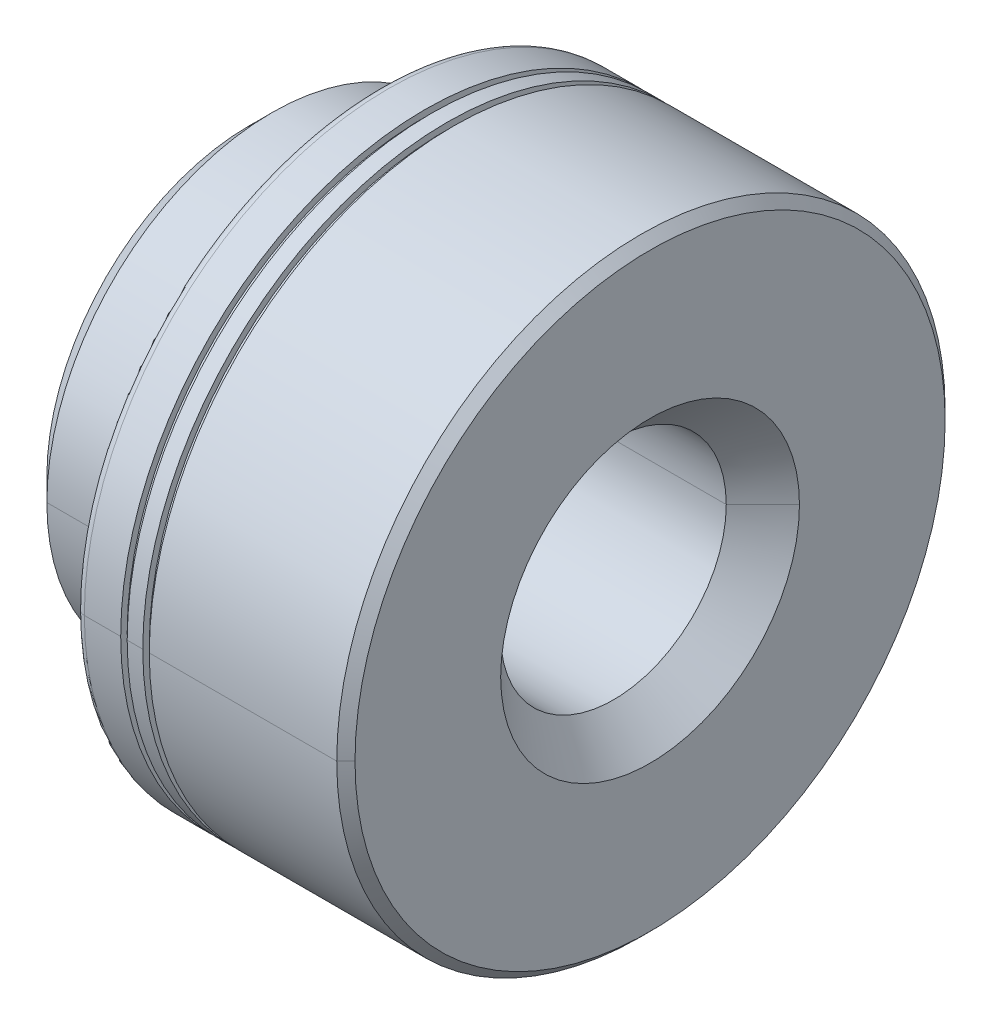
ISO-10303-21;
HEADER;
FILE_DESCRIPTION(('STEP AP214'),'2;1');
FILE_NAME('part.step','',(''),(''),'','','');
FILE_SCHEMA(('AUTOMOTIVE_DESIGN { 1 0 10303 214 1 1 1 1 }'));
ENDSEC;
DATA;
#1=APPLICATION_CONTEXT('core data for automotive mechanical design processes');
#2=APPLICATION_PROTOCOL_DEFINITION('international standard','automotive_design',2000,#1);
#3=PRODUCT_CONTEXT('',#1,'mechanical');
#4=PRODUCT('Part','Part','',(#3));
#5=PRODUCT_RELATED_PRODUCT_CATEGORY('part','',(#4));
#6=PRODUCT_DEFINITION_FORMATION('','',#4);
#7=PRODUCT_DEFINITION_CONTEXT('part definition',#1,'design');
#8=PRODUCT_DEFINITION('design','',#6,#7);
#9=PRODUCT_DEFINITION_SHAPE('','',#8);
#10=(LENGTH_UNIT() NAMED_UNIT(*) SI_UNIT(.MILLI.,.METRE.));
#11=(NAMED_UNIT(*) PLANE_ANGLE_UNIT() SI_UNIT($,.RADIAN.));
#12=(NAMED_UNIT(*) SI_UNIT($,.STERADIAN.) SOLID_ANGLE_UNIT());
#13=UNCERTAINTY_MEASURE_WITH_UNIT(LENGTH_MEASURE(1.E-05),#10,'distance_accuracy_value','');
#14=(GEOMETRIC_REPRESENTATION_CONTEXT(3) GLOBAL_UNCERTAINTY_ASSIGNED_CONTEXT((#13)) GLOBAL_UNIT_ASSIGNED_CONTEXT((#10,
#11,#12)) REPRESENTATION_CONTEXT('',''));
#15=CARTESIAN_POINT('',(0.,0.,0.));
#16=DIRECTION('',(0.,0.,1.));
#17=DIRECTION('',(1.,0.,0.));
#18=AXIS2_PLACEMENT_3D('',#15,#16,#17);
#19=CARTESIAN_POINT('',(0.,0.,-1.18872));
#20=DIRECTION('',(-1.,0.,0.));
#21=DIRECTION('',(0.,0.,1.));
#22=AXIS2_PLACEMENT_3D('',#19,#20,#21);
#23=PLANE('',#22);
#24=CARTESIAN_POINT('',(0.,0.,0.));
#25=DIRECTION('',(-1.,0.,0.));
#26=DIRECTION('',(0.,0.,-1.));
#27=AXIS2_PLACEMENT_3D('',#24,#25,#26);
#28=CIRCLE('',#27,2.37744);
#29=CARTESIAN_POINT('',(0.,0.,-2.37744));
#30=VERTEX_POINT('',#29);
#31=CARTESIAN_POINT('',(0.,0.,2.37744));
#32=VERTEX_POINT('',#31);
#33=EDGE_CURVE('E1102',#30,#32,#28,.T.);
#34=ORIENTED_EDGE('',*,*,#33,.T.);
#35=CARTESIAN_POINT('',(0.,0.,0.));
#36=DIRECTION('',(-1.,0.,0.));
#37=DIRECTION('',(0.,0.,-1.));
#38=AXIS2_PLACEMENT_3D('',#35,#36,#37);
#39=CIRCLE('',#38,2.37744);
#40=EDGE_CURVE('E1267',#32,#30,#39,.T.);
#41=ORIENTED_EDGE('',*,*,#40,.T.);
#42=EDGE_LOOP('',(#34,#41));
#43=FACE_BOUND('',#42,.T.);
#44=CARTESIAN_POINT('',(0.,0.,0.));
#45=DIRECTION('',(1.,0.,0.));
#46=DIRECTION('',(0.,0.,1.));
#47=AXIS2_PLACEMENT_3D('',#44,#45,#46);
#48=CIRCLE('',#47,1.7526);
#49=CARTESIAN_POINT('',(0.,0.,1.7526));
#50=VERTEX_POINT('',#49);
#51=CARTESIAN_POINT('',(0.,0.,-1.7526));
#52=VERTEX_POINT('',#51);
#53=EDGE_CURVE('E1324',#50,#52,#48,.T.);
#54=ORIENTED_EDGE('',*,*,#53,.T.);
#55=CARTESIAN_POINT('',(0.,0.,0.));
#56=DIRECTION('',(1.,0.,0.));
#57=DIRECTION('',(0.,0.,1.));
#58=AXIS2_PLACEMENT_3D('',#55,#56,#57);
#59=CIRCLE('',#58,1.7526);
#60=EDGE_CURVE('E1303',#52,#50,#59,.T.);
#61=ORIENTED_EDGE('',*,*,#60,.T.);
#62=EDGE_LOOP('',(#54,#61));
#63=FACE_BOUND('',#62,.T.);
#64=ADVANCED_FACE('F18',(#43,#63),#23,.T.);
#65=CARTESIAN_POINT('',(0.13208,0.,0.));
#66=DIRECTION('',(1.,0.,0.));
#67=DIRECTION('',(0.,0.,-1.));
#68=AXIS2_PLACEMENT_3D('',#65,#66,#67);
#69=CONICAL_SURFACE('',#68,2.50952,0.785398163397);
#70=DIRECTION('',(-0.707106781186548,0.,0.707106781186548));
#71=VECTOR('',#70,1.);
#72=CARTESIAN_POINT('',(0.13208,0.,-2.50952));
#73=LINE('',#72,#71);
#74=CARTESIAN_POINT('',(0.26416,0.,-2.6416));
#75=VERTEX_POINT('',#74);
#76=EDGE_CURVE('E5773',#75,#30,#73,.T.);
#77=ORIENTED_EDGE('',*,*,#76,.T.);
#78=ORIENTED_EDGE('',*,*,#40,.F.);
#79=DIRECTION('',(0.707106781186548,0.,0.707106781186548));
#80=VECTOR('',#79,1.);
#81=CARTESIAN_POINT('',(0.13208,0.,2.50952));
#82=LINE('',#81,#80);
#83=CARTESIAN_POINT('',(0.26416,0.,2.6416));
#84=VERTEX_POINT('',#83);
#85=EDGE_CURVE('E1109',#32,#84,#82,.T.);
#86=ORIENTED_EDGE('',*,*,#85,.T.);
#87=CARTESIAN_POINT('',(0.26416,0.,0.));
#88=DIRECTION('',(-1.,0.,0.));
#89=DIRECTION('',(0.,0.,-1.));
#90=AXIS2_PLACEMENT_3D('',#87,#88,#89);
#91=CIRCLE('',#90,2.6416);
#92=EDGE_CURVE('E1089',#84,#75,#91,.T.);
#93=ORIENTED_EDGE('',*,*,#92,.T.);
#94=EDGE_LOOP('',(#77,#78,#86,#93));
#95=FACE_BOUND('',#94,.T.);
#96=ADVANCED_FACE('F2708',(#95),#69,.T.);
#97=CARTESIAN_POINT('',(0.89408,0.,0.));
#98=DIRECTION('',(-1.,0.,0.));
#99=DIRECTION('',(0.,0.,-1.));
#100=AXIS2_PLACEMENT_3D('',#97,#98,#99);
#101=CYLINDRICAL_SURFACE('',#100,2.6416);
#102=DIRECTION('',(-1.,0.,0.));
#103=VECTOR('',#102,1.);
#104=CARTESIAN_POINT('',(0.89408,0.,-2.6416));
#105=LINE('',#104,#103);
#106=CARTESIAN_POINT('',(1.524,0.,-2.6416));
#107=VERTEX_POINT('',#106);
#108=EDGE_CURVE('E1082',#107,#75,#105,.T.);
#109=ORIENTED_EDGE('',*,*,#108,.T.);
#110=ORIENTED_EDGE('',*,*,#92,.F.);
#111=DIRECTION('',(1.,0.,0.));
#112=VECTOR('',#111,1.);
#113=CARTESIAN_POINT('',(0.89408,0.,2.6416));
#114=LINE('',#113,#112);
#115=CARTESIAN_POINT('',(1.524,0.,2.6416));
#116=VERTEX_POINT('',#115);
#117=EDGE_CURVE('E1085',#84,#116,#114,.T.);
#118=ORIENTED_EDGE('',*,*,#117,.T.);
#119=CARTESIAN_POINT('',(1.524,0.,0.));
#120=DIRECTION('',(-1.,0.,0.));
#121=DIRECTION('',(0.,0.,-1.));
#122=AXIS2_PLACEMENT_3D('',#119,#120,#121);
#123=CIRCLE('',#122,2.6416);
#124=EDGE_CURVE('E1078',#116,#107,#123,.T.);
#125=ORIENTED_EDGE('',*,*,#124,.T.);
#126=EDGE_LOOP('',(#109,#110,#118,#125));
#127=FACE_BOUND('',#126,.T.);
#128=ADVANCED_FACE('F1080',(#127),#101,.T.);
#129=CARTESIAN_POINT('',(1.524,0.,-3.0516195));
#130=DIRECTION('',(-1.,0.,0.));
#131=DIRECTION('',(0.,0.,1.));
#132=AXIS2_PLACEMENT_3D('',#129,#130,#131);
#133=PLANE('',#132);
#134=CARTESIAN_POINT('',(1.524,0.,0.));
#135=DIRECTION('',(-1.,0.,0.));
#136=DIRECTION('',(0.,0.,-1.));
#137=AXIS2_PLACEMENT_3D('',#134,#135,#136);
#138=CIRCLE('',#137,3.461639);
#139=CARTESIAN_POINT('',(1.524,0.,-3.461639));
#140=VERTEX_POINT('',#139);
#141=CARTESIAN_POINT('',(1.524,0.,3.461639));
#142=VERTEX_POINT('',#141);
#143=EDGE_CURVE('E1090',#140,#142,#138,.T.);
#144=ORIENTED_EDGE('',*,*,#143,.T.);
#145=CARTESIAN_POINT('',(1.524,0.,0.));
#146=DIRECTION('',(-1.,0.,0.));
#147=DIRECTION('',(0.,0.,-1.));
#148=AXIS2_PLACEMENT_3D('',#145,#146,#147);
#149=CIRCLE('',#148,3.461639);
#150=EDGE_CURVE('E1130',#142,#140,#149,.T.);
#151=ORIENTED_EDGE('',*,*,#150,.T.);
#152=EDGE_LOOP('',(#144,#151));
#153=FACE_BOUND('',#152,.T.);
#154=CARTESIAN_POINT('',(1.524,0.,0.));
#155=DIRECTION('',(-1.,0.,0.));
#156=DIRECTION('',(0.,0.,-1.));
#157=AXIS2_PLACEMENT_3D('',#154,#155,#156);
#158=CIRCLE('',#157,2.6416);
#159=EDGE_CURVE('E1092',#107,#116,#158,.T.);
#160=ORIENTED_EDGE('',*,*,#159,.F.);
#161=ORIENTED_EDGE('',*,*,#124,.F.);
#162=EDGE_LOOP('',(#160,#161));
#163=FACE_BOUND('',#162,.T.);
#164=ADVANCED_FACE('F1093',(#153,#163),#133,.T.);
#165=CARTESIAN_POINT('',(1.631061,0.,0.));
#166=DIRECTION('',(-1.,0.,0.));
#167=DIRECTION('',(0.,0.,1.));
#168=AXIS2_PLACEMENT_3D('',#165,#166,#167);
#169=TOROIDAL_SURFACE('',#168,3.461639,0.107061);
#170=CARTESIAN_POINT('',(1.631061,0.,3.461639));
#171=DIRECTION('',(0.,-1.,0.));
#172=DIRECTION('',(0.,0.,1.));
#173=AXIS2_PLACEMENT_3D('',#170,#171,#172);
#174=CIRCLE('',#173,0.107061);
#175=CARTESIAN_POINT('',(1.631061,0.,3.5687));
#176=VERTEX_POINT('',#175);
#177=EDGE_CURVE('E1115',#176,#142,#174,.T.);
#178=ORIENTED_EDGE('',*,*,#177,.T.);
#179=ORIENTED_EDGE('',*,*,#143,.F.);
#180=CARTESIAN_POINT('',(1.631061,0.,-3.461639));
#181=DIRECTION('',(0.,-1.,0.));
#182=DIRECTION('',(0.,0.,-1.));
#183=AXIS2_PLACEMENT_3D('',#180,#181,#182);
#184=CIRCLE('',#183,0.107061);
#185=CARTESIAN_POINT('',(1.631061,0.,-3.5687));
#186=VERTEX_POINT('',#185);
#187=EDGE_CURVE('E1134',#140,#186,#184,.T.);
#188=ORIENTED_EDGE('',*,*,#187,.T.);
#189=CARTESIAN_POINT('',(1.631061,0.,0.));
#190=DIRECTION('',(-1.,0.,0.));
#191=DIRECTION('',(0.,0.,-1.));
#192=AXIS2_PLACEMENT_3D('',#189,#190,#191);
#193=CIRCLE('',#192,3.5687);
#194=EDGE_CURVE('E5563',#186,#176,#193,.T.);
#195=ORIENTED_EDGE('',*,*,#194,.T.);
#196=EDGE_LOOP('',(#178,#179,#188,#195));
#197=FACE_BOUND('',#196,.T.);
#198=ADVANCED_FACE('F2704',(#197),#169,.T.);
#199=CARTESIAN_POINT('',(1.8442305,0.,0.));
#200=DIRECTION('',(-1.,0.,0.));
#201=DIRECTION('',(0.,0.,-1.));
#202=AXIS2_PLACEMENT_3D('',#199,#200,#201);
#203=CYLINDRICAL_SURFACE('',#202,3.5687);
#204=DIRECTION('',(-1.,0.,0.));
#205=VECTOR('',#204,1.);
#206=CARTESIAN_POINT('',(1.8442305,0.,-3.5687));
#207=LINE('',#206,#205);
#208=CARTESIAN_POINT('',(2.0574,0.,-3.5687));
#209=VERTEX_POINT('',#208);
#210=EDGE_CURVE('E1125',#209,#186,#207,.T.);
#211=ORIENTED_EDGE('',*,*,#210,.T.);
#212=CARTESIAN_POINT('',(1.631061,0.,0.));
#213=DIRECTION('',(-1.,0.,0.));
#214=DIRECTION('',(0.,0.,-1.));
#215=AXIS2_PLACEMENT_3D('',#212,#213,#214);
#216=CIRCLE('',#215,3.5687);
#217=EDGE_CURVE('E1119',#176,#186,#216,.T.);
#218=ORIENTED_EDGE('',*,*,#217,.F.);
#219=DIRECTION('',(1.,0.,0.));
#220=VECTOR('',#219,1.);
#221=CARTESIAN_POINT('',(1.8442305,0.,3.5687));
#222=LINE('',#221,#220);
#223=CARTESIAN_POINT('',(2.0574,0.,3.5687));
#224=VERTEX_POINT('',#223);
#225=EDGE_CURVE('E1141',#176,#224,#222,.T.);
#226=ORIENTED_EDGE('',*,*,#225,.T.);
#227=CARTESIAN_POINT('',(2.0574,0.,0.));
#228=DIRECTION('',(-1.,0.,0.));
#229=DIRECTION('',(0.,0.,-1.));
#230=AXIS2_PLACEMENT_3D('',#227,#228,#229);
#231=CIRCLE('',#230,3.5687);
#232=EDGE_CURVE('E1391',#224,#209,#231,.T.);
#233=ORIENTED_EDGE('',*,*,#232,.T.);
#234=EDGE_LOOP('',(#211,#218,#226,#233));
#235=FACE_BOUND('',#234,.T.);
#236=ADVANCED_FACE('F4039',(#235),#203,.T.);
#237=CARTESIAN_POINT('',(2.0574,0.,-3.5306));
#238=DIRECTION('',(1.,0.,0.));
#239=DIRECTION('',(0.,0.,1.));
#240=AXIS2_PLACEMENT_3D('',#237,#238,#239);
#241=PLANE('',#240);
#242=CARTESIAN_POINT('',(2.0574,0.,0.));
#243=DIRECTION('',(-1.,0.,0.));
#244=DIRECTION('',(0.,0.,-1.));
#245=AXIS2_PLACEMENT_3D('',#242,#243,#244);
#246=CIRCLE('',#245,3.4925);
#247=CARTESIAN_POINT('',(2.0574,0.,-3.4925));
#248=VERTEX_POINT('',#247);
#249=CARTESIAN_POINT('',(2.0574,0.,3.4925));
#250=VERTEX_POINT('',#249);
#251=EDGE_CURVE('E1168',#248,#250,#246,.T.);
#252=ORIENTED_EDGE('',*,*,#251,.T.);
#253=CARTESIAN_POINT('',(2.0574,0.,0.));
#254=DIRECTION('',(-1.,0.,0.));
#255=DIRECTION('',(0.,0.,-1.));
#256=AXIS2_PLACEMENT_3D('',#253,#254,#255);
#257=CIRCLE('',#256,3.4925);
#258=EDGE_CURVE('E1384',#250,#248,#257,.T.);
#259=ORIENTED_EDGE('',*,*,#258,.T.);
#260=EDGE_LOOP('',(#252,#259));
#261=FACE_BOUND('',#260,.T.);
#262=CARTESIAN_POINT('',(2.0574,0.,0.));
#263=DIRECTION('',(-1.,0.,0.));
#264=DIRECTION('',(0.,0.,-1.));
#265=AXIS2_PLACEMENT_3D('',#262,#263,#264);
#266=CIRCLE('',#265,3.5687);
#267=EDGE_CURVE('E1129',#209,#224,#266,.T.);
#268=ORIENTED_EDGE('',*,*,#267,.F.);
#269=ORIENTED_EDGE('',*,*,#232,.F.);
#270=EDGE_LOOP('',(#268,#269));
#271=FACE_BOUND('',#270,.T.);
#272=ADVANCED_FACE('F4029',(#261,#271),#241,.T.);
#273=CARTESIAN_POINT('',(2.0955,0.,0.));
#274=DIRECTION('',(-1.,0.,0.));
#275=DIRECTION('',(0.,0.,-1.));
#276=AXIS2_PLACEMENT_3D('',#273,#274,#275);
#277=CYLINDRICAL_SURFACE('',#276,3.4925);
#278=DIRECTION('',(-1.,0.,0.));
#279=VECTOR('',#278,1.);
#280=CARTESIAN_POINT('',(2.0955,0.,-3.4925));
#281=LINE('',#280,#279);
#282=CARTESIAN_POINT('',(2.1336,0.,-3.4925));
#283=VERTEX_POINT('',#282);
#284=EDGE_CURVE('E1158',#283,#248,#281,.T.);
#285=ORIENTED_EDGE('',*,*,#284,.T.);
#286=ORIENTED_EDGE('',*,*,#258,.F.);
#287=DIRECTION('',(1.,0.,0.));
#288=VECTOR('',#287,1.);
#289=CARTESIAN_POINT('',(2.0955,0.,3.4925));
#290=LINE('',#289,#288);
#291=CARTESIAN_POINT('',(2.1336,0.,3.4925));
#292=VERTEX_POINT('',#291);
#293=EDGE_CURVE('E1157',#250,#292,#290,.T.);
#294=ORIENTED_EDGE('',*,*,#293,.T.);
#295=CARTESIAN_POINT('',(2.1336,0.,0.));
#296=DIRECTION('',(-1.,0.,0.));
#297=DIRECTION('',(0.,0.,-1.));
#298=AXIS2_PLACEMENT_3D('',#295,#296,#297);
#299=CIRCLE('',#298,3.4925);
#300=EDGE_CURVE('E1381',#292,#283,#299,.T.);
#301=ORIENTED_EDGE('',*,*,#300,.T.);
#302=EDGE_LOOP('',(#285,#286,#294,#301));
#303=FACE_BOUND('',#302,.T.);
#304=ADVANCED_FACE('F4007',(#303),#277,.T.);
#305=CARTESIAN_POINT('',(2.1336,0.,-3.5306));
#306=DIRECTION('',(-1.,0.,0.));
#307=DIRECTION('',(0.,0.,1.));
#308=AXIS2_PLACEMENT_3D('',#305,#306,#307);
#309=PLANE('',#308);
#310=CARTESIAN_POINT('',(2.1336,0.,0.));
#311=DIRECTION('',(-1.,0.,0.));
#312=DIRECTION('',(0.,0.,-1.));
#313=AXIS2_PLACEMENT_3D('',#310,#311,#312);
#314=CIRCLE('',#313,3.5687);
#315=CARTESIAN_POINT('',(2.1336,0.,-3.5687));
#316=VERTEX_POINT('',#315);
#317=CARTESIAN_POINT('',(2.1336,0.,3.5687));
#318=VERTEX_POINT('',#317);
#319=EDGE_CURVE('E1163',#316,#318,#314,.T.);
#320=ORIENTED_EDGE('',*,*,#319,.T.);
#321=CARTESIAN_POINT('',(2.1336,0.,0.));
#322=DIRECTION('',(-1.,0.,0.));
#323=DIRECTION('',(0.,0.,-1.));
#324=AXIS2_PLACEMENT_3D('',#321,#322,#323);
#325=CIRCLE('',#324,3.5687);
#326=EDGE_CURVE('E1378',#318,#316,#325,.T.);
#327=ORIENTED_EDGE('',*,*,#326,.T.);
#328=EDGE_LOOP('',(#320,#327));
#329=FACE_BOUND('',#328,.T.);
#330=CARTESIAN_POINT('',(2.1336,0.,0.));
#331=DIRECTION('',(-1.,0.,0.));
#332=DIRECTION('',(0.,0.,-1.));
#333=AXIS2_PLACEMENT_3D('',#330,#331,#332);
#334=CIRCLE('',#333,3.4925);
#335=EDGE_CURVE('E1153',#283,#292,#334,.T.);
#336=ORIENTED_EDGE('',*,*,#335,.F.);
#337=ORIENTED_EDGE('',*,*,#300,.F.);
#338=EDGE_LOOP('',(#336,#337));
#339=FACE_BOUND('',#338,.T.);
#340=ADVANCED_FACE('F3997',(#329,#339),#309,.T.);
#341=CARTESIAN_POINT('',(2.22504,0.,0.));
#342=DIRECTION('',(-1.,0.,0.));
#343=DIRECTION('',(0.,0.,-1.));
#344=AXIS2_PLACEMENT_3D('',#341,#342,#343);
#345=CYLINDRICAL_SURFACE('',#344,3.5687);
#346=DIRECTION('',(-1.,0.,0.));
#347=VECTOR('',#346,1.);
#348=CARTESIAN_POINT('',(2.22504,0.,-3.5687));
#349=LINE('',#348,#347);
#350=CARTESIAN_POINT('',(2.31648,0.,-3.5687));
#351=VERTEX_POINT('',#350);
#352=EDGE_CURVE('E1172',#351,#316,#349,.T.);
#353=ORIENTED_EDGE('',*,*,#352,.T.);
#354=ORIENTED_EDGE('',*,*,#326,.F.);
#355=DIRECTION('',(1.,0.,0.));
#356=VECTOR('',#355,1.);
#357=CARTESIAN_POINT('',(2.22504,0.,3.5687));
#358=LINE('',#357,#356);
#359=CARTESIAN_POINT('',(2.31648,0.,3.5687));
#360=VERTEX_POINT('',#359);
#361=EDGE_CURVE('E1159',#318,#360,#358,.T.);
#362=ORIENTED_EDGE('',*,*,#361,.T.);
#363=CARTESIAN_POINT('',(2.31648,0.,0.));
#364=DIRECTION('',(-1.,0.,0.));
#365=DIRECTION('',(0.,0.,-1.));
#366=AXIS2_PLACEMENT_3D('',#363,#364,#365);
#367=CIRCLE('',#366,3.5687);
#368=EDGE_CURVE('E1375',#360,#351,#367,.T.);
#369=ORIENTED_EDGE('',*,*,#368,.T.);
#370=EDGE_LOOP('',(#353,#354,#362,#369));
#371=FACE_BOUND('',#370,.T.);
#372=ADVANCED_FACE('F3952',(#371),#345,.T.);
#373=CARTESIAN_POINT('',(2.31648,0.,-3.5306));
#374=DIRECTION('',(1.,0.,0.));
#375=DIRECTION('',(0.,0.,1.));
#376=AXIS2_PLACEMENT_3D('',#373,#374,#375);
#377=PLANE('',#376);
#378=CARTESIAN_POINT('',(2.31648,0.,0.));
#379=DIRECTION('',(-1.,0.,0.));
#380=DIRECTION('',(0.,0.,-1.));
#381=AXIS2_PLACEMENT_3D('',#378,#379,#380);
#382=CIRCLE('',#381,3.4925);
#383=CARTESIAN_POINT('',(2.31648,0.,-3.4925));
#384=VERTEX_POINT('',#383);
#385=CARTESIAN_POINT('',(2.31648,0.,3.4925));
#386=VERTEX_POINT('',#385);
#387=EDGE_CURVE('E1212',#384,#386,#382,.T.);
#388=ORIENTED_EDGE('',*,*,#387,.T.);
#389=CARTESIAN_POINT('',(2.31648,0.,0.));
#390=DIRECTION('',(-1.,0.,0.));
#391=DIRECTION('',(0.,0.,-1.));
#392=AXIS2_PLACEMENT_3D('',#389,#390,#391);
#393=CIRCLE('',#392,3.4925);
#394=EDGE_CURVE('E1316',#386,#384,#393,.T.);
#395=ORIENTED_EDGE('',*,*,#394,.T.);
#396=EDGE_LOOP('',(#388,#395));
#397=FACE_BOUND('',#396,.T.);
#398=CARTESIAN_POINT('',(2.31648,0.,0.));
#399=DIRECTION('',(-1.,0.,0.));
#400=DIRECTION('',(0.,0.,-1.));
#401=AXIS2_PLACEMENT_3D('',#398,#399,#400);
#402=CIRCLE('',#401,3.5687);
#403=EDGE_CURVE('E1164',#351,#360,#402,.T.);
#404=ORIENTED_EDGE('',*,*,#403,.F.);
#405=ORIENTED_EDGE('',*,*,#368,.F.);
#406=EDGE_LOOP('',(#404,#405));
#407=FACE_BOUND('',#406,.T.);
#408=ADVANCED_FACE('F2592',(#397,#407),#377,.T.);
#409=CARTESIAN_POINT('',(2.35458,0.,0.));
#410=DIRECTION('',(-1.,0.,0.));
#411=DIRECTION('',(0.,0.,-1.));
#412=AXIS2_PLACEMENT_3D('',#409,#410,#411);
#413=CYLINDRICAL_SURFACE('',#412,3.4925);
#414=DIRECTION('',(-1.,0.,0.));
#415=VECTOR('',#414,1.);
#416=CARTESIAN_POINT('',(2.35458,0.,-3.4925));
#417=LINE('',#416,#415);
#418=CARTESIAN_POINT('',(2.39268,0.,-3.4925));
#419=VERTEX_POINT('',#418);
#420=EDGE_CURVE('E1200',#419,#384,#417,.T.);
#421=ORIENTED_EDGE('',*,*,#420,.T.);
#422=ORIENTED_EDGE('',*,*,#394,.F.);
#423=DIRECTION('',(1.,0.,0.));
#424=VECTOR('',#423,1.);
#425=CARTESIAN_POINT('',(2.35458,0.,3.4925));
#426=LINE('',#425,#424);
#427=CARTESIAN_POINT('',(2.39268,0.,3.4925));
#428=VERTEX_POINT('',#427);
#429=EDGE_CURVE('E1208',#386,#428,#426,.T.);
#430=ORIENTED_EDGE('',*,*,#429,.T.);
#431=CARTESIAN_POINT('',(2.39268,0.,0.));
#432=DIRECTION('',(-1.,0.,0.));
#433=DIRECTION('',(0.,0.,-1.));
#434=AXIS2_PLACEMENT_3D('',#431,#432,#433);
#435=CIRCLE('',#434,3.4925);
#436=EDGE_CURVE('E1313',#428,#419,#435,.T.);
#437=ORIENTED_EDGE('',*,*,#436,.T.);
#438=EDGE_LOOP('',(#421,#422,#430,#437));
#439=FACE_BOUND('',#438,.T.);
#440=ADVANCED_FACE('F2586',(#439),#413,.T.);
#441=CARTESIAN_POINT('',(2.39268,0.,-3.5306));
#442=DIRECTION('',(-1.,0.,0.));
#443=DIRECTION('',(0.,0.,1.));
#444=AXIS2_PLACEMENT_3D('',#441,#442,#443);
#445=PLANE('',#444);
#446=CARTESIAN_POINT('',(2.39268,0.,0.));
#447=DIRECTION('',(-1.,0.,0.));
#448=DIRECTION('',(0.,0.,-1.));
#449=AXIS2_PLACEMENT_3D('',#446,#447,#448);
#450=CIRCLE('',#449,3.5687);
#451=CARTESIAN_POINT('',(2.39268,0.,-3.5687));
#452=VERTEX_POINT('',#451);
#453=CARTESIAN_POINT('',(2.39268,0.,3.5687));
#454=VERTEX_POINT('',#453);
#455=EDGE_CURVE('E1224',#452,#454,#450,.T.);
#456=ORIENTED_EDGE('',*,*,#455,.T.);
#457=CARTESIAN_POINT('',(2.39268,0.,0.));
#458=DIRECTION('',(-1.,0.,0.));
#459=DIRECTION('',(0.,0.,-1.));
#460=AXIS2_PLACEMENT_3D('',#457,#458,#459);
#461=CIRCLE('',#460,3.5687);
#462=EDGE_CURVE('E1317',#454,#452,#461,.T.);
#463=ORIENTED_EDGE('',*,*,#462,.T.);
#464=EDGE_LOOP('',(#456,#463));
#465=FACE_BOUND('',#464,.T.);
#466=CARTESIAN_POINT('',(2.39268,0.,0.));
#467=DIRECTION('',(-1.,0.,0.));
#468=DIRECTION('',(0.,0.,-1.));
#469=AXIS2_PLACEMENT_3D('',#466,#467,#468);
#470=CIRCLE('',#469,3.4925);
#471=EDGE_CURVE('E1204',#419,#428,#470,.T.);
#472=ORIENTED_EDGE('',*,*,#471,.F.);
#473=ORIENTED_EDGE('',*,*,#436,.F.);
#474=EDGE_LOOP('',(#472,#473));
#475=FACE_BOUND('',#474,.T.);
#476=ADVANCED_FACE('F2576',(#465,#475),#445,.T.);
#477=CARTESIAN_POINT('',(3.4923095,0.,0.));
#478=DIRECTION('',(-1.,0.,0.));
#479=DIRECTION('',(0.,0.,-1.));
#480=AXIS2_PLACEMENT_3D('',#477,#478,#479);
#481=CYLINDRICAL_SURFACE('',#480,3.5687);
#482=DIRECTION('',(-1.,0.,0.));
#483=VECTOR('',#482,1.);
#484=CARTESIAN_POINT('',(3.4923095,0.,-3.5687));
#485=LINE('',#484,#483);
#486=CARTESIAN_POINT('',(4.591939,0.,-3.5687));
#487=VERTEX_POINT('',#486);
#488=EDGE_CURVE('E1152',#487,#452,#485,.T.);
#489=ORIENTED_EDGE('',*,*,#488,.T.);
#490=ORIENTED_EDGE('',*,*,#462,.F.);
#491=DIRECTION('',(1.,0.,0.));
#492=VECTOR('',#491,1.);
#493=CARTESIAN_POINT('',(3.4923095,0.,3.5687));
#494=LINE('',#493,#492);
#495=CARTESIAN_POINT('',(4.591939,0.,3.5687));
#496=VERTEX_POINT('',#495);
#497=EDGE_CURVE('E1151',#454,#496,#494,.T.);
#498=ORIENTED_EDGE('',*,*,#497,.T.);
#499=CARTESIAN_POINT('',(4.591939,0.,0.));
#500=DIRECTION('',(-1.,0.,0.));
#501=DIRECTION('',(0.,0.,-1.));
#502=AXIS2_PLACEMENT_3D('',#499,#500,#501);
#503=CIRCLE('',#502,3.5687);
#504=EDGE_CURVE('E1364',#496,#487,#503,.T.);
#505=ORIENTED_EDGE('',*,*,#504,.T.);
#506=EDGE_LOOP('',(#489,#490,#498,#505));
#507=FACE_BOUND('',#506,.T.);
#508=ADVANCED_FACE('F2566',(#507),#481,.T.);
#509=CARTESIAN_POINT('',(4.6454695,0.,0.));
#510=DIRECTION('',(-1.,0.,0.));
#511=DIRECTION('',(0.,0.,-1.));
#512=AXIS2_PLACEMENT_3D('',#509,#510,#511);
#513=CONICAL_SURFACE('',#512,3.5151695,0.785398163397);
#514=DIRECTION('',(-0.707106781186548,0.,-0.707106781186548));
#515=VECTOR('',#514,1.);
#516=CARTESIAN_POINT('',(4.6454695,0.,-3.5151695));
#517=LINE('',#516,#515);
#518=CARTESIAN_POINT('',(4.699,0.,-3.461639));
#519=VERTEX_POINT('',#518);
#520=EDGE_CURVE('E1234',#519,#487,#517,.T.);
#521=ORIENTED_EDGE('',*,*,#520,.T.);
#522=ORIENTED_EDGE('',*,*,#504,.F.);
#523=DIRECTION('',(0.707106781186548,0.,-0.707106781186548));
#524=VECTOR('',#523,1.);
#525=CARTESIAN_POINT('',(4.6454695,0.,3.5151695));
#526=LINE('',#525,#524);
#527=CARTESIAN_POINT('',(4.699,0.,3.461639));
#528=VERTEX_POINT('',#527);
#529=EDGE_CURVE('E1252',#496,#528,#526,.T.);
#530=ORIENTED_EDGE('',*,*,#529,.T.);
#531=CARTESIAN_POINT('',(4.699,0.,0.));
#532=DIRECTION('',(-1.,0.,0.));
#533=DIRECTION('',(0.,0.,-1.));
#534=AXIS2_PLACEMENT_3D('',#531,#532,#533);
#535=CIRCLE('',#534,3.461639);
#536=EDGE_CURVE('E1361',#528,#519,#535,.T.);
#537=ORIENTED_EDGE('',*,*,#536,.T.);
#538=EDGE_LOOP('',(#521,#522,#530,#537));
#539=FACE_BOUND('',#538,.T.);
#540=ADVANCED_FACE('F2562',(#539),#513,.T.);
#541=CARTESIAN_POINT('',(4.699,0.,-1.7308195));
#542=DIRECTION('',(1.,0.,0.));
#543=DIRECTION('',(0.,0.,-1.));
#544=AXIS2_PLACEMENT_3D('',#541,#542,#543);
#545=PLANE('',#544);
#546=CARTESIAN_POINT('',(4.699,0.,0.));
#547=DIRECTION('',(-1.,0.,0.));
#548=DIRECTION('',(0.,0.,-1.));
#549=AXIS2_PLACEMENT_3D('',#546,#547,#548);
#550=CIRCLE('',#549,3.461639);
#551=EDGE_CURVE('E1242',#519,#528,#550,.T.);
#552=ORIENTED_EDGE('',*,*,#551,.F.);
#553=ORIENTED_EDGE('',*,*,#536,.F.);
#554=EDGE_LOOP('',(#552,#553));
#555=FACE_BOUND('',#554,.T.);
#556=CARTESIAN_POINT('',(4.699,0.,0.));
#557=DIRECTION('',(-1.,0.,0.));
#558=DIRECTION('',(0.,0.,1.));
#559=AXIS2_PLACEMENT_3D('',#556,#557,#558);
#560=CIRCLE('',#559,1.7526);
#561=CARTESIAN_POINT('',(4.699,0.,1.7526));
#562=VERTEX_POINT('',#561);
#563=CARTESIAN_POINT('',(4.699,0.,-1.7526));
#564=VERTEX_POINT('',#563);
#565=EDGE_CURVE('E1260',#562,#564,#560,.T.);
#566=ORIENTED_EDGE('',*,*,#565,.T.);
#567=CARTESIAN_POINT('',(4.699,0.,0.));
#568=DIRECTION('',(-1.,0.,0.));
#569=DIRECTION('',(0.,0.,1.));
#570=AXIS2_PLACEMENT_3D('',#567,#568,#569);
#571=CIRCLE('',#570,1.7526);
#572=EDGE_CURVE('E1358',#564,#562,#571,.T.);
#573=ORIENTED_EDGE('',*,*,#572,.T.);
#574=EDGE_LOOP('',(#566,#573));
#575=FACE_BOUND('',#574,.T.);
#576=ADVANCED_FACE('F2565',(#555,#575),#545,.T.);
#577=CARTESIAN_POINT('',(4.48437,0.,0.));
#578=DIRECTION('',(1.,0.,0.));
#579=DIRECTION('',(0.,0.,-1.));
#580=AXIS2_PLACEMENT_3D('',#577,#578,#579);
#581=CONICAL_SURFACE('',#580,1.53797,0.785398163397);
#582=DIRECTION('',(-0.707106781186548,0.,0.707106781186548));
#583=VECTOR('',#582,1.);
#584=CARTESIAN_POINT('',(4.48437,0.,-1.53797));
#585=LINE('',#584,#583);
#586=CARTESIAN_POINT('',(4.26974,0.,-1.32334));
#587=VERTEX_POINT('',#586);
#588=EDGE_CURVE('E1256',#564,#587,#585,.T.);
#589=ORIENTED_EDGE('',*,*,#588,.T.);
#590=CARTESIAN_POINT('',(4.26974,0.,0.));
#591=DIRECTION('',(-1.,0.,0.));
#592=DIRECTION('',(0.,0.,-1.));
#593=AXIS2_PLACEMENT_3D('',#590,#591,#592);
#594=CIRCLE('',#593,1.32334);
#595=CARTESIAN_POINT('',(4.26974,0.,1.32334));
#596=VERTEX_POINT('',#595);
#597=EDGE_CURVE('E1339',#587,#596,#594,.T.);
#598=ORIENTED_EDGE('',*,*,#597,.T.);
#599=DIRECTION('',(0.707106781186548,0.,0.707106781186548));
#600=VECTOR('',#599,1.);
#601=CARTESIAN_POINT('',(4.48437,0.,1.53797));
#602=LINE('',#601,#600);
#603=EDGE_CURVE('E1264',#596,#562,#602,.T.);
#604=ORIENTED_EDGE('',*,*,#603,.T.);
#605=ORIENTED_EDGE('',*,*,#572,.F.);
#606=EDGE_LOOP('',(#589,#598,#604,#605));
#607=FACE_BOUND('',#606,.T.);
#608=ADVANCED_FACE('F3686',(#607),#581,.F.);
#609=CARTESIAN_POINT('',(2.3495,0.,0.));
#610=DIRECTION('',(-1.,0.,0.));
#611=DIRECTION('',(0.,0.,-1.));
#612=AXIS2_PLACEMENT_3D('',#609,#610,#611);
#613=CYLINDRICAL_SURFACE('',#612,1.32334);
#614=DIRECTION('',(-1.,0.,0.));
#615=VECTOR('',#614,1.);
#616=CARTESIAN_POINT('',(2.3495,0.,-1.32334));
#617=LINE('',#616,#615);
#618=CARTESIAN_POINT('',(0.42926,0.,-1.32334));
#619=VERTEX_POINT('',#618);
#620=EDGE_CURVE('E1281',#587,#619,#617,.T.);
#621=ORIENTED_EDGE('',*,*,#620,.T.);
#622=CARTESIAN_POINT('',(0.42926,0.,0.));
#623=DIRECTION('',(-1.,0.,0.));
#624=DIRECTION('',(0.,0.,-1.));
#625=AXIS2_PLACEMENT_3D('',#622,#623,#624);
#626=CIRCLE('',#625,1.32334);
#627=CARTESIAN_POINT('',(0.42926,0.,1.32334));
#628=VERTEX_POINT('',#627);
#629=EDGE_CURVE('E1330',#619,#628,#626,.T.);
#630=ORIENTED_EDGE('',*,*,#629,.T.);
#631=DIRECTION('',(1.,0.,0.));
#632=VECTOR('',#631,1.);
#633=CARTESIAN_POINT('',(2.3495,0.,1.32334));
#634=LINE('',#633,#632);
#635=EDGE_CURVE('E1285',#628,#596,#634,.T.);
#636=ORIENTED_EDGE('',*,*,#635,.T.);
#637=ORIENTED_EDGE('',*,*,#597,.F.);
#638=EDGE_LOOP('',(#621,#630,#636,#637));
#639=FACE_BOUND('',#638,.T.);
#640=ADVANCED_FACE('F2552',(#639),#613,.F.);
#641=CARTESIAN_POINT('',(0.21463,0.,0.));
#642=DIRECTION('',(-1.,0.,0.));
#643=DIRECTION('',(0.,0.,-1.));
#644=AXIS2_PLACEMENT_3D('',#641,#642,#643);
#645=CONICAL_SURFACE('',#644,1.53797,0.785398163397);
#646=DIRECTION('',(-0.707106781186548,0.,-0.707106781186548));
#647=VECTOR('',#646,1.);
#648=CARTESIAN_POINT('',(0.21463,0.,-1.53797));
#649=LINE('',#648,#647);
#650=EDGE_CURVE('E1304',#619,#52,#649,.T.);
#651=ORIENTED_EDGE('',*,*,#650,.T.);
#652=ORIENTED_EDGE('',*,*,#53,.F.);
#653=DIRECTION('',(0.707106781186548,0.,-0.707106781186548));
#654=VECTOR('',#653,1.);
#655=CARTESIAN_POINT('',(0.21463,0.,1.53797));
#656=LINE('',#655,#654);
#657=EDGE_CURVE('E1299',#50,#628,#656,.T.);
#658=ORIENTED_EDGE('',*,*,#657,.T.);
#659=ORIENTED_EDGE('',*,*,#629,.F.);
#660=EDGE_LOOP('',(#651,#652,#658,#659));
#661=FACE_BOUND('',#660,.T.);
#662=ADVANCED_FACE('F2548',(#661),#645,.F.);
#663=CARTESIAN_POINT('',(0.21463,0.,0.));
#664=DIRECTION('',(-1.,0.,0.));
#665=DIRECTION('',(0.,0.,-1.));
#666=AXIS2_PLACEMENT_3D('',#663,#664,#665);
#667=CONICAL_SURFACE('',#666,1.53797,0.785398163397);
#668=ORIENTED_EDGE('',*,*,#650,.F.);
#669=CARTESIAN_POINT('',(0.42926,0.,0.));
#670=DIRECTION('',(-1.,0.,0.));
#671=DIRECTION('',(0.,0.,-1.));
#672=AXIS2_PLACEMENT_3D('',#669,#670,#671);
#673=CIRCLE('',#672,1.32334);
#674=EDGE_CURVE('E1289',#628,#619,#673,.T.);
#675=ORIENTED_EDGE('',*,*,#674,.F.);
#676=ORIENTED_EDGE('',*,*,#657,.F.);
#677=ORIENTED_EDGE('',*,*,#60,.F.);
#678=EDGE_LOOP('',(#668,#675,#676,#677));
#679=FACE_BOUND('',#678,.T.);
#680=ADVANCED_FACE('F2551',(#679),#667,.F.);
#681=CARTESIAN_POINT('',(2.3495,0.,0.));
#682=DIRECTION('',(-1.,0.,0.));
#683=DIRECTION('',(0.,0.,-1.));
#684=AXIS2_PLACEMENT_3D('',#681,#682,#683);
#685=CYLINDRICAL_SURFACE('',#684,1.32334);
#686=ORIENTED_EDGE('',*,*,#620,.F.);
#687=CARTESIAN_POINT('',(4.26974,0.,0.));
#688=DIRECTION('',(-1.,0.,0.));
#689=DIRECTION('',(0.,0.,-1.));
#690=AXIS2_PLACEMENT_3D('',#687,#688,#689);
#691=CIRCLE('',#690,1.32334);
#692=EDGE_CURVE('E1271',#596,#587,#691,.T.);
#693=ORIENTED_EDGE('',*,*,#692,.F.);
#694=ORIENTED_EDGE('',*,*,#635,.F.);
#695=ORIENTED_EDGE('',*,*,#674,.T.);
#696=EDGE_LOOP('',(#686,#693,#694,#695));
#697=FACE_BOUND('',#696,.T.);
#698=ADVANCED_FACE('F3837',(#697),#685,.F.);
#699=CARTESIAN_POINT('',(4.48437,0.,0.));
#700=DIRECTION('',(1.,0.,0.));
#701=DIRECTION('',(0.,0.,-1.));
#702=AXIS2_PLACEMENT_3D('',#699,#700,#701);
#703=CONICAL_SURFACE('',#702,1.53797,0.785398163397);
#704=ORIENTED_EDGE('',*,*,#588,.F.);
#705=ORIENTED_EDGE('',*,*,#565,.F.);
#706=ORIENTED_EDGE('',*,*,#603,.F.);
#707=ORIENTED_EDGE('',*,*,#692,.T.);
#708=EDGE_LOOP('',(#704,#705,#706,#707));
#709=FACE_BOUND('',#708,.T.);
#710=ADVANCED_FACE('F3827',(#709),#703,.F.);
#711=CARTESIAN_POINT('',(4.6454695,0.,0.));
#712=DIRECTION('',(-1.,0.,0.));
#713=DIRECTION('',(0.,0.,-1.));
#714=AXIS2_PLACEMENT_3D('',#711,#712,#713);
#715=CONICAL_SURFACE('',#714,3.5151695,0.785398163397);
#716=ORIENTED_EDGE('',*,*,#520,.F.);
#717=ORIENTED_EDGE('',*,*,#551,.T.);
#718=ORIENTED_EDGE('',*,*,#529,.F.);
#719=CARTESIAN_POINT('',(4.591939,0.,0.));
#720=DIRECTION('',(-1.,0.,0.));
#721=DIRECTION('',(0.,0.,-1.));
#722=AXIS2_PLACEMENT_3D('',#719,#720,#721);
#723=CIRCLE('',#722,3.5687);
#724=EDGE_CURVE('E1147',#487,#496,#723,.T.);
#725=ORIENTED_EDGE('',*,*,#724,.F.);
#726=EDGE_LOOP('',(#716,#717,#718,#725));
#727=FACE_BOUND('',#726,.T.);
#728=ADVANCED_FACE('F3805',(#727),#715,.T.);
#729=CARTESIAN_POINT('',(3.4923095,0.,0.));
#730=DIRECTION('',(-1.,0.,0.));
#731=DIRECTION('',(0.,0.,-1.));
#732=AXIS2_PLACEMENT_3D('',#729,#730,#731);
#733=CYLINDRICAL_SURFACE('',#732,3.5687);
#734=ORIENTED_EDGE('',*,*,#488,.F.);
#735=ORIENTED_EDGE('',*,*,#724,.T.);
#736=ORIENTED_EDGE('',*,*,#497,.F.);
#737=ORIENTED_EDGE('',*,*,#455,.F.);
#738=EDGE_LOOP('',(#734,#735,#736,#737));
#739=FACE_BOUND('',#738,.T.);
#740=ADVANCED_FACE('F3795',(#739),#733,.T.);
#741=CARTESIAN_POINT('',(2.35458,0.,0.));
#742=DIRECTION('',(-1.,0.,0.));
#743=DIRECTION('',(0.,0.,-1.));
#744=AXIS2_PLACEMENT_3D('',#741,#742,#743);
#745=CYLINDRICAL_SURFACE('',#744,3.4925);
#746=ORIENTED_EDGE('',*,*,#420,.F.);
#747=ORIENTED_EDGE('',*,*,#471,.T.);
#748=ORIENTED_EDGE('',*,*,#429,.F.);
#749=ORIENTED_EDGE('',*,*,#387,.F.);
#750=EDGE_LOOP('',(#746,#747,#748,#749));
#751=FACE_BOUND('',#750,.T.);
#752=ADVANCED_FACE('F3776',(#751),#745,.T.);
#753=CARTESIAN_POINT('',(2.22504,0.,0.));
#754=DIRECTION('',(-1.,0.,0.));
#755=DIRECTION('',(0.,0.,-1.));
#756=AXIS2_PLACEMENT_3D('',#753,#754,#755);
#757=CYLINDRICAL_SURFACE('',#756,3.5687);
#758=ORIENTED_EDGE('',*,*,#352,.F.);
#759=ORIENTED_EDGE('',*,*,#403,.T.);
#760=ORIENTED_EDGE('',*,*,#361,.F.);
#761=ORIENTED_EDGE('',*,*,#319,.F.);
#762=EDGE_LOOP('',(#758,#759,#760,#761));
#763=FACE_BOUND('',#762,.T.);
#764=ADVANCED_FACE('F3772',(#763),#757,.T.);
#765=CARTESIAN_POINT('',(2.0955,0.,0.));
#766=DIRECTION('',(-1.,0.,0.));
#767=DIRECTION('',(0.,0.,-1.));
#768=AXIS2_PLACEMENT_3D('',#765,#766,#767);
#769=CYLINDRICAL_SURFACE('',#768,3.4925);
#770=ORIENTED_EDGE('',*,*,#284,.F.);
#771=ORIENTED_EDGE('',*,*,#335,.T.);
#772=ORIENTED_EDGE('',*,*,#293,.F.);
#773=ORIENTED_EDGE('',*,*,#251,.F.);
#774=EDGE_LOOP('',(#770,#771,#772,#773));
#775=FACE_BOUND('',#774,.T.);
#776=ADVANCED_FACE('F3739',(#775),#769,.T.);
#777=CARTESIAN_POINT('',(1.8442305,0.,0.));
#778=DIRECTION('',(-1.,0.,0.));
#779=DIRECTION('',(0.,0.,-1.));
#780=AXIS2_PLACEMENT_3D('',#777,#778,#779);
#781=CYLINDRICAL_SURFACE('',#780,3.5687);
#782=ORIENTED_EDGE('',*,*,#210,.F.);
#783=ORIENTED_EDGE('',*,*,#267,.T.);
#784=ORIENTED_EDGE('',*,*,#225,.F.);
#785=ORIENTED_EDGE('',*,*,#194,.F.);
#786=EDGE_LOOP('',(#782,#783,#784,#785));
#787=FACE_BOUND('',#786,.T.);
#788=ADVANCED_FACE('F3704',(#787),#781,.T.);
#789=CARTESIAN_POINT('',(1.631061,0.,0.));
#790=DIRECTION('',(-1.,0.,0.));
#791=DIRECTION('',(0.,0.,1.));
#792=AXIS2_PLACEMENT_3D('',#789,#790,#791);
#793=TOROIDAL_SURFACE('',#792,3.461639,0.107061);
#794=ORIENTED_EDGE('',*,*,#177,.F.);
#795=ORIENTED_EDGE('',*,*,#217,.T.);
#796=ORIENTED_EDGE('',*,*,#187,.F.);
#797=ORIENTED_EDGE('',*,*,#150,.F.);
#798=EDGE_LOOP('',(#794,#795,#796,#797));
#799=FACE_BOUND('',#798,.T.);
#800=ADVANCED_FACE('F3677',(#799),#793,.T.);
#801=CARTESIAN_POINT('',(0.89408,0.,0.));
#802=DIRECTION('',(-1.,0.,0.));
#803=DIRECTION('',(0.,0.,-1.));
#804=AXIS2_PLACEMENT_3D('',#801,#802,#803);
#805=CYLINDRICAL_SURFACE('',#804,2.6416);
#806=ORIENTED_EDGE('',*,*,#108,.F.);
#807=ORIENTED_EDGE('',*,*,#159,.T.);
#808=ORIENTED_EDGE('',*,*,#117,.F.);
#809=CARTESIAN_POINT('',(0.26416,0.,0.));
#810=DIRECTION('',(-1.,0.,0.));
#811=DIRECTION('',(0.,0.,-1.));
#812=AXIS2_PLACEMENT_3D('',#809,#810,#811);
#813=CIRCLE('',#812,2.6416);
#814=EDGE_CURVE('E1099',#75,#84,#813,.T.);
#815=ORIENTED_EDGE('',*,*,#814,.F.);
#816=EDGE_LOOP('',(#806,#807,#808,#815));
#817=FACE_BOUND('',#816,.T.);
#818=ADVANCED_FACE('F1097',(#817),#805,.T.);
#819=CARTESIAN_POINT('',(0.13208,0.,0.));
#820=DIRECTION('',(1.,0.,0.));
#821=DIRECTION('',(0.,0.,-1.));
#822=AXIS2_PLACEMENT_3D('',#819,#820,#821);
#823=CONICAL_SURFACE('',#822,2.50952,0.785398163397);
#824=ORIENTED_EDGE('',*,*,#76,.F.);
#825=ORIENTED_EDGE('',*,*,#814,.T.);
#826=ORIENTED_EDGE('',*,*,#85,.F.);
#827=ORIENTED_EDGE('',*,*,#33,.F.);
#828=EDGE_LOOP('',(#824,#825,#826,#827));
#829=FACE_BOUND('',#828,.T.);
#830=ADVANCED_FACE('F3664',(#829),#823,.T.);
#831=CLOSED_SHELL('',(#64,#96,#128,#164,#198,#236,#272,#304,#340,#372,#408,#440,#476,#508,#540,
#576,#608,#640,#662,#680,#698,#710,#728,#740,#752,#764,#776,#788,#800,#818,#830));
#832=CARTESIAN_POINT('',(1.808502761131,0.635402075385,3.147987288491));
#833=DIRECTION('',(1.,0.,0.));
#834=DIRECTION('',(0.,1.,0.));
#835=AXIS2_PLACEMENT_3D('',#832,#833,#834);
#836=PLANE('',#835);
#837=CARTESIAN_POINT('',(1.808502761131,0.635402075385,3.147987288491));
#838=DIRECTION('',(-1.,0.,0.));
#839=DIRECTION('',(0.,1.,0.));
#840=AXIS2_PLACEMENT_3D('',#837,#838,#839);
#841=CIRCLE('',#840,0.05653253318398);
#842=CARTESIAN_POINT('',(1.808502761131,0.578869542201,3.147987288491));
#843=VERTEX_POINT('',#842);
#844=CARTESIAN_POINT('',(1.808502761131,0.691934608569,3.147987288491));
#845=VERTEX_POINT('',#844);
#846=EDGE_CURVE('E1903',#843,#845,#841,.T.);
#847=ORIENTED_EDGE('',*,*,#846,.T.);
#848=CARTESIAN_POINT('',(1.808502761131,0.635402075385,3.147987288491));
#849=DIRECTION('',(-1.,0.,0.));
#850=DIRECTION('',(0.,1.,0.));
#851=AXIS2_PLACEMENT_3D('',#848,#849,#850);
#852=CIRCLE('',#851,0.05653253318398);
#853=EDGE_CURVE('E11',#845,#843,#852,.T.);
#854=ORIENTED_EDGE('',*,*,#853,.T.);
#855=EDGE_LOOP('',(#847,#854));
#856=FACE_BOUND('',#855,.T.);
#857=CARTESIAN_POINT('',(1.808502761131,0.635402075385,3.147987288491));
#858=DIRECTION('',(-1.,0.,0.));
#859=DIRECTION('',(0.,1.,0.));
#860=AXIS2_PLACEMENT_3D('',#857,#858,#859);
#861=CIRCLE('',#860,0.04368144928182);
#862=CARTESIAN_POINT('',(1.808502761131,0.591720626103,3.147987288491));
#863=VERTEX_POINT('',#862);
#864=CARTESIAN_POINT('',(1.808502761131,0.679083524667,3.147987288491));
#865=VERTEX_POINT('',#864);
#866=EDGE_CURVE('E2410',#863,#865,#861,.T.);
#867=ORIENTED_EDGE('',*,*,#866,.F.);
#868=CARTESIAN_POINT('',(1.808502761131,0.635402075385,3.147987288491));
#869=DIRECTION('',(-1.,0.,0.));
#870=DIRECTION('',(0.,1.,0.));
#871=AXIS2_PLACEMENT_3D('',#868,#869,#870);
#872=CIRCLE('',#871,0.04368144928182);
#873=EDGE_CURVE('E44',#865,#863,#872,.T.);
#874=ORIENTED_EDGE('',*,*,#873,.F.);
#875=EDGE_LOOP('',(#867,#874));
#876=FACE_BOUND('',#875,.T.);
#877=ADVANCED_FACE('F20',(#856,#876),#836,.F.);
#878=CARTESIAN_POINT('',(1.78816,0.635402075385,3.147987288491));
#879=DIRECTION('',(1.,0.,0.));
#880=DIRECTION('',(0.,1.,0.));
#881=AXIS2_PLACEMENT_3D('',#878,#879,#880);
#882=PLANE('',#881);
#883=CARTESIAN_POINT('',(1.78816,0.635402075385,3.147987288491));
#884=DIRECTION('',(1.,0.,0.));
#885=DIRECTION('',(0.,1.,0.));
#886=AXIS2_PLACEMENT_3D('',#883,#884,#885);
#887=CIRCLE('',#886,0.05653253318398);
#888=CARTESIAN_POINT('',(1.78816,0.691934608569,3.147987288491));
#889=VERTEX_POINT('',#888);
#890=CARTESIAN_POINT('',(1.78816,0.578869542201,3.147987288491));
#891=VERTEX_POINT('',#890);
#892=EDGE_CURVE('E1902',#889,#891,#887,.T.);
#893=ORIENTED_EDGE('',*,*,#892,.T.);
#894=CARTESIAN_POINT('',(1.78816,0.635402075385,3.147987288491));
#895=DIRECTION('',(1.,0.,0.));
#896=DIRECTION('',(0.,1.,0.));
#897=AXIS2_PLACEMENT_3D('',#894,#895,#896);
#898=CIRCLE('',#897,0.05653253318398);
#899=EDGE_CURVE('E31',#891,#889,#898,.T.);
#900=ORIENTED_EDGE('',*,*,#899,.T.);
#901=EDGE_LOOP('',(#893,#900));
#902=FACE_BOUND('',#901,.T.);
#903=CARTESIAN_POINT('',(1.78816,0.635402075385,3.147987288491));
#904=DIRECTION('',(1.,0.,0.));
#905=DIRECTION('',(0.,1.,0.));
#906=AXIS2_PLACEMENT_3D('',#903,#904,#905);
#907=CIRCLE('',#906,0.04368144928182);
#908=CARTESIAN_POINT('',(1.78816,0.679083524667,3.147987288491));
#909=VERTEX_POINT('',#908);
#910=CARTESIAN_POINT('',(1.78816,0.591720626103,3.147987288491));
#911=VERTEX_POINT('',#910);
#912=EDGE_CURVE('E2400',#909,#911,#907,.T.);
#913=ORIENTED_EDGE('',*,*,#912,.F.);
#914=CARTESIAN_POINT('',(1.78816,0.635402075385,3.147987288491));
#915=DIRECTION('',(1.,0.,0.));
#916=DIRECTION('',(0.,1.,0.));
#917=AXIS2_PLACEMENT_3D('',#914,#915,#916);
#918=CIRCLE('',#917,0.04368144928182);
#919=EDGE_CURVE('E53',#911,#909,#918,.T.);
#920=ORIENTED_EDGE('',*,*,#919,.F.);
#921=EDGE_LOOP('',(#913,#920));
#922=FACE_BOUND('',#921,.T.);
#923=ADVANCED_FACE('F4987',(#902,#922),#882,.T.);
#924=CARTESIAN_POINT('',(1.78816,0.635402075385,3.147987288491));
#925=DIRECTION('',(1.,0.,0.));
#926=DIRECTION('',(0.,1.,0.));
#927=AXIS2_PLACEMENT_3D('',#924,#925,#926);
#928=CYLINDRICAL_SURFACE('',#927,0.05653253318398);
#929=DIRECTION('',(-1.,0.,0.));
#930=VECTOR('',#929,1.);
#931=CARTESIAN_POINT('',(1.78816,0.691934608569,3.147987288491));
#932=LINE('',#931,#930);
#933=EDGE_CURVE('E2003',#845,#889,#932,.T.);
#934=ORIENTED_EDGE('',*,*,#933,.T.);
#935=ORIENTED_EDGE('',*,*,#899,.F.);
#936=DIRECTION('',(1.,0.,0.));
#937=VECTOR('',#936,1.);
#938=CARTESIAN_POINT('',(1.78816,0.578869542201,3.147987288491));
#939=LINE('',#938,#937);
#940=EDGE_CURVE('E1898',#891,#843,#939,.T.);
#941=ORIENTED_EDGE('',*,*,#940,.T.);
#942=ORIENTED_EDGE('',*,*,#853,.F.);
#943=EDGE_LOOP('',(#934,#935,#941,#942));
#944=FACE_BOUND('',#943,.T.);
#945=ADVANCED_FACE('F4978',(#944),#928,.F.);
#946=CARTESIAN_POINT('',(1.78816,0.635402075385,3.147987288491));
#947=DIRECTION('',(1.,0.,0.));
#948=DIRECTION('',(0.,1.,0.));
#949=AXIS2_PLACEMENT_3D('',#946,#947,#948);
#950=CYLINDRICAL_SURFACE('',#949,0.04368144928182);
#951=DIRECTION('',(1.,0.,0.));
#952=VECTOR('',#951,1.);
#953=CARTESIAN_POINT('',(1.78816,0.679083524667,3.147987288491));
#954=LINE('',#953,#952);
#955=EDGE_CURVE('E2397',#909,#865,#954,.T.);
#956=ORIENTED_EDGE('',*,*,#955,.T.);
#957=ORIENTED_EDGE('',*,*,#873,.T.);
#958=DIRECTION('',(-1.,0.,0.));
#959=VECTOR('',#958,1.);
#960=CARTESIAN_POINT('',(1.78816,0.591720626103,3.147987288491));
#961=LINE('',#960,#959);
#962=EDGE_CURVE('E2407',#863,#911,#961,.T.);
#963=ORIENTED_EDGE('',*,*,#962,.T.);
#964=ORIENTED_EDGE('',*,*,#919,.T.);
#965=EDGE_LOOP('',(#956,#957,#963,#964));
#966=FACE_BOUND('',#965,.T.);
#967=ADVANCED_FACE('F3716',(#966),#950,.T.);
#968=CARTESIAN_POINT('',(1.78816,0.635402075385,3.147987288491));
#969=DIRECTION('',(1.,0.,0.));
#970=DIRECTION('',(0.,1.,0.));
#971=AXIS2_PLACEMENT_3D('',#968,#969,#970);
#972=CYLINDRICAL_SURFACE('',#971,0.04368144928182);
#973=ORIENTED_EDGE('',*,*,#955,.F.);
#974=ORIENTED_EDGE('',*,*,#912,.T.);
#975=ORIENTED_EDGE('',*,*,#962,.F.);
#976=ORIENTED_EDGE('',*,*,#866,.T.);
#977=EDGE_LOOP('',(#973,#974,#975,#976));
#978=FACE_BOUND('',#977,.T.);
#979=ADVANCED_FACE('F3711',(#978),#972,.T.);
#980=CARTESIAN_POINT('',(1.78816,0.635402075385,3.147987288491));
#981=DIRECTION('',(1.,0.,0.));
#982=DIRECTION('',(0.,1.,0.));
#983=AXIS2_PLACEMENT_3D('',#980,#981,#982);
#984=CYLINDRICAL_SURFACE('',#983,0.05653253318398);
#985=ORIENTED_EDGE('',*,*,#933,.F.);
#986=ORIENTED_EDGE('',*,*,#846,.F.);
#987=ORIENTED_EDGE('',*,*,#940,.F.);
#988=ORIENTED_EDGE('',*,*,#892,.F.);
#989=EDGE_LOOP('',(#985,#986,#987,#988));
#990=FACE_BOUND('',#989,.T.);
#991=ADVANCED_FACE('F3715',(#990),#984,.F.);
#992=CLOSED_SHELL('',(#877,#923,#945,#967,#979,#991));
#993=CARTESIAN_POINT('',(1.808502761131,-0.04295675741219,2.922487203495));
#994=DIRECTION('',(1.,0.,0.));
#995=DIRECTION('',(0.,1.,0.));
#996=AXIS2_PLACEMENT_3D('',#993,#994,#995);
#997=PLANE('',#996);
#998=DIRECTION('',(0.,-1.,0.));
#999=VECTOR('',#998,1.);
#1000=CARTESIAN_POINT('',(1.808502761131,-0.177469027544,2.639947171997));
#1001=LINE('',#1000,#999);
#1002=CARTESIAN_POINT('',(1.808502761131,0.07738793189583,2.639947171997));
#1003=VERTEX_POINT('',#1002);
#1004=CARTESIAN_POINT('',(1.808502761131,-0.177469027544,2.639947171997));
#1005=VERTEX_POINT('',#1004);
#1006=EDGE_CURVE('E1648',#1003,#1005,#1001,.T.);
#1007=ORIENTED_EDGE('',*,*,#1006,.T.);
#1008=DIRECTION('',(0.,0.,1.));
#1009=VECTOR('',#1008,1.);
#1010=CARTESIAN_POINT('',(1.808502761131,-0.177469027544,3.205309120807));
#1011=LINE('',#1010,#1009);
#1012=CARTESIAN_POINT('',(1.808502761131,-0.177469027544,3.205309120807));
#1013=VERTEX_POINT('',#1012);
#1014=EDGE_CURVE('E2132',#1005,#1013,#1011,.T.);
#1015=ORIENTED_EDGE('',*,*,#1014,.T.);
#1016=DIRECTION('',(0.,1.,0.));
#1017=VECTOR('',#1016,1.);
#1018=CARTESIAN_POINT('',(1.808502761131,0.07738793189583,3.205309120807));
#1019=LINE('',#1018,#1017);
#1020=CARTESIAN_POINT('',(1.808502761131,0.07738793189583,3.205309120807));
#1021=VERTEX_POINT('',#1020);
#1022=EDGE_CURVE('E2140',#1013,#1021,#1019,.T.);
#1023=ORIENTED_EDGE('',*,*,#1022,.T.);
#1024=DIRECTION('',(0.,0.,-1.));
#1025=VECTOR('',#1024,1.);
#1026=CARTESIAN_POINT('',(1.808502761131,0.07738793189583,3.061681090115));
#1027=LINE('',#1026,#1025);
#1028=CARTESIAN_POINT('',(1.808502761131,0.07738793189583,3.061681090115));
#1029=VERTEX_POINT('',#1028);
#1030=EDGE_CURVE('E2337',#1021,#1029,#1027,.T.);
#1031=ORIENTED_EDGE('',*,*,#1030,.T.);
#1032=DIRECTION('',(0.,-1.,0.));
#1033=VECTOR('',#1032,1.);
#1034=CARTESIAN_POINT('',(1.808502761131,-0.02470018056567,3.061681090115));
#1035=LINE('',#1034,#1033);
#1036=CARTESIAN_POINT('',(1.808502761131,-0.02470018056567,3.061681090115));
#1037=VERTEX_POINT('',#1036);
#1038=EDGE_CURVE('E1644',#1029,#1037,#1035,.T.);
#1039=ORIENTED_EDGE('',*,*,#1038,.T.);
#1040=DIRECTION('',(0.,0.,-1.));
#1041=VECTOR('',#1040,1.);
#1042=CARTESIAN_POINT('',(1.808502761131,-0.02470018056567,2.993117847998));
#1043=LINE('',#1042,#1041);
#1044=CARTESIAN_POINT('',(1.808502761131,-0.02470018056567,2.993117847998));
#1045=VERTEX_POINT('',#1044);
#1046=EDGE_CURVE('E2350',#1037,#1045,#1043,.T.);
#1047=ORIENTED_EDGE('',*,*,#1046,.T.);
#1048=DIRECTION('',(0.,1.,0.));
#1049=VECTOR('',#1048,1.);
#1050=CARTESIAN_POINT('',(1.808502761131,0.07502817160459,2.993117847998));
#1051=LINE('',#1050,#1049);
#1052=CARTESIAN_POINT('',(1.808502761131,0.07502817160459,2.993117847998));
#1053=VERTEX_POINT('',#1052);
#1054=EDGE_CURVE('E1431',#1045,#1053,#1051,.T.);
#1055=ORIENTED_EDGE('',*,*,#1054,.T.);
#1056=DIRECTION('',(0.,0.,-1.));
#1057=VECTOR('',#1056,1.);
#1058=CARTESIAN_POINT('',(1.808502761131,0.07502817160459,2.859640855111));
#1059=LINE('',#1058,#1057);
#1060=CARTESIAN_POINT('',(1.808502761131,0.07502817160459,2.859640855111));
#1061=VERTEX_POINT('',#1060);
#1062=EDGE_CURVE('E1627',#1053,#1061,#1059,.T.);
#1063=ORIENTED_EDGE('',*,*,#1062,.T.);
#1064=DIRECTION('',(0.,-1.,0.));
#1065=VECTOR('',#1064,1.);
#1066=CARTESIAN_POINT('',(1.808502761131,-0.02470018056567,2.859640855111));
#1067=LINE('',#1066,#1065);
#1068=CARTESIAN_POINT('',(1.808502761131,-0.02470018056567,2.859640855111));
#1069=VERTEX_POINT('',#1068);
#1070=EDGE_CURVE('E2307',#1061,#1069,#1067,.T.);
#1071=ORIENTED_EDGE('',*,*,#1070,.T.);
#1072=DIRECTION('',(0.,0.,-1.));
#1073=VECTOR('',#1072,1.);
#1074=CARTESIAN_POINT('',(1.808502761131,-0.02470018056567,2.773424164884));
#1075=LINE('',#1074,#1073);
#1076=CARTESIAN_POINT('',(1.808502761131,-0.02470018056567,2.773424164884));
#1077=VERTEX_POINT('',#1076);
#1078=EDGE_CURVE('E1551',#1069,#1077,#1075,.T.);
#1079=ORIENTED_EDGE('',*,*,#1078,.T.);
#1080=DIRECTION('',(0.,1.,0.));
#1081=VECTOR('',#1080,1.);
#1082=CARTESIAN_POINT('',(1.808502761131,0.07738793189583,2.773424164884));
#1083=LINE('',#1082,#1081);
#1084=CARTESIAN_POINT('',(1.808502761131,0.07738793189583,2.773424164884));
#1085=VERTEX_POINT('',#1084);
#1086=EDGE_CURVE('E2381',#1077,#1085,#1083,.T.);
#1087=ORIENTED_EDGE('',*,*,#1086,.T.);
#1088=DIRECTION('',(0.,0.,-1.));
#1089=VECTOR('',#1088,1.);
#1090=CARTESIAN_POINT('',(1.808502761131,0.07738793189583,2.639947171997));
#1091=LINE('',#1090,#1089);
#1092=EDGE_CURVE('E2004',#1085,#1003,#1091,.T.);
#1093=ORIENTED_EDGE('',*,*,#1092,.T.);
#1094=EDGE_LOOP('',(#1007,#1015,#1023,#1031,#1039,#1047,#1055,#1063,#1071,#1079,#1087,#1093));
#1095=FACE_BOUND('',#1094,.T.);
#1096=ADVANCED_FACE('F4959',(#1095),#997,.F.);
#1097=CARTESIAN_POINT('',(1.78816,-0.04295675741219,2.922487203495));
#1098=DIRECTION('',(1.,0.,0.));
#1099=DIRECTION('',(0.,1.,0.));
#1100=AXIS2_PLACEMENT_3D('',#1097,#1098,#1099);
#1101=PLANE('',#1100);
#1102=DIRECTION('',(0.,0.,1.));
#1103=VECTOR('',#1102,1.);
#1104=CARTESIAN_POINT('',(1.78816,0.07738793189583,2.639947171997));
#1105=LINE('',#1104,#1103);
#1106=CARTESIAN_POINT('',(1.78816,0.07738793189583,2.639947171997));
#1107=VERTEX_POINT('',#1106);
#1108=CARTESIAN_POINT('',(1.78816,0.07738793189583,2.773424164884));
#1109=VERTEX_POINT('',#1108);
#1110=EDGE_CURVE('E2000',#1107,#1109,#1105,.T.);
#1111=ORIENTED_EDGE('',*,*,#1110,.T.);
#1112=DIRECTION('',(0.,-1.,0.));
#1113=VECTOR('',#1112,1.);
#1114=CARTESIAN_POINT('',(1.78816,0.07738793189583,2.773424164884));
#1115=LINE('',#1114,#1113);
#1116=CARTESIAN_POINT('',(1.78816,-0.02470018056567,2.773424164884));
#1117=VERTEX_POINT('',#1116);
#1118=EDGE_CURVE('E2385',#1109,#1117,#1115,.T.);
#1119=ORIENTED_EDGE('',*,*,#1118,.T.);
#1120=DIRECTION('',(0.,0.,1.));
#1121=VECTOR('',#1120,1.);
#1122=CARTESIAN_POINT('',(1.78816,-0.02470018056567,2.773424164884));
#1123=LINE('',#1122,#1121);
#1124=CARTESIAN_POINT('',(1.78816,-0.02470018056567,2.859640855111));
#1125=VERTEX_POINT('',#1124);
#1126=EDGE_CURVE('E1555',#1117,#1125,#1123,.T.);
#1127=ORIENTED_EDGE('',*,*,#1126,.T.);
#1128=DIRECTION('',(0.,1.,0.));
#1129=VECTOR('',#1128,1.);
#1130=CARTESIAN_POINT('',(1.78816,-0.02470018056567,2.859640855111));
#1131=LINE('',#1130,#1129);
#1132=CARTESIAN_POINT('',(1.78816,0.07502817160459,2.859640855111));
#1133=VERTEX_POINT('',#1132);
#1134=EDGE_CURVE('E2304',#1125,#1133,#1131,.T.);
#1135=ORIENTED_EDGE('',*,*,#1134,.T.);
#1136=DIRECTION('',(0.,0.,1.));
#1137=VECTOR('',#1136,1.);
#1138=CARTESIAN_POINT('',(1.78816,0.07502817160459,2.859640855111));
#1139=LINE('',#1138,#1137);
#1140=CARTESIAN_POINT('',(1.78816,0.07502817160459,2.993117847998));
#1141=VERTEX_POINT('',#1140);
#1142=EDGE_CURVE('E1623',#1133,#1141,#1139,.T.);
#1143=ORIENTED_EDGE('',*,*,#1142,.T.);
#1144=DIRECTION('',(0.,-1.,0.));
#1145=VECTOR('',#1144,1.);
#1146=CARTESIAN_POINT('',(1.78816,0.07502817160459,2.993117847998));
#1147=LINE('',#1146,#1145);
#1148=CARTESIAN_POINT('',(1.78816,-0.02470018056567,2.993117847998));
#1149=VERTEX_POINT('',#1148);
#1150=EDGE_CURVE('E1427',#1141,#1149,#1147,.T.);
#1151=ORIENTED_EDGE('',*,*,#1150,.T.);
#1152=DIRECTION('',(0.,0.,1.));
#1153=VECTOR('',#1152,1.);
#1154=CARTESIAN_POINT('',(1.78816,-0.02470018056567,2.993117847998));
#1155=LINE('',#1154,#1153);
#1156=CARTESIAN_POINT('',(1.78816,-0.02470018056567,3.061681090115));
#1157=VERTEX_POINT('',#1156);
#1158=EDGE_CURVE('E2354',#1149,#1157,#1155,.T.);
#1159=ORIENTED_EDGE('',*,*,#1158,.T.);
#1160=DIRECTION('',(0.,1.,0.));
#1161=VECTOR('',#1160,1.);
#1162=CARTESIAN_POINT('',(1.78816,-0.02470018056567,3.061681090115));
#1163=LINE('',#1162,#1161);
#1164=CARTESIAN_POINT('',(1.78816,0.07738793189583,3.061681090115));
#1165=VERTEX_POINT('',#1164);
#1166=EDGE_CURVE('E1640',#1157,#1165,#1163,.T.);
#1167=ORIENTED_EDGE('',*,*,#1166,.T.);
#1168=DIRECTION('',(0.,0.,1.));
#1169=VECTOR('',#1168,1.);
#1170=CARTESIAN_POINT('',(1.78816,0.07738793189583,3.061681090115));
#1171=LINE('',#1170,#1169);
#1172=CARTESIAN_POINT('',(1.78816,0.07738793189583,3.205309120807));
#1173=VERTEX_POINT('',#1172);
#1174=EDGE_CURVE('E2341',#1165,#1173,#1171,.T.);
#1175=ORIENTED_EDGE('',*,*,#1174,.T.);
#1176=DIRECTION('',(0.,-1.,0.));
#1177=VECTOR('',#1176,1.);
#1178=CARTESIAN_POINT('',(1.78816,0.07738793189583,3.205309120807));
#1179=LINE('',#1178,#1177);
#1180=CARTESIAN_POINT('',(1.78816,-0.177469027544,3.205309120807));
#1181=VERTEX_POINT('',#1180);
#1182=EDGE_CURVE('E2144',#1173,#1181,#1179,.T.);
#1183=ORIENTED_EDGE('',*,*,#1182,.T.);
#1184=DIRECTION('',(0.,0.,-1.));
#1185=VECTOR('',#1184,1.);
#1186=CARTESIAN_POINT('',(1.78816,-0.177469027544,3.205309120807));
#1187=LINE('',#1186,#1185);
#1188=CARTESIAN_POINT('',(1.78816,-0.177469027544,2.639947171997));
#1189=VERTEX_POINT('',#1188);
#1190=EDGE_CURVE('E2128',#1181,#1189,#1187,.T.);
#1191=ORIENTED_EDGE('',*,*,#1190,.T.);
#1192=DIRECTION('',(0.,1.,0.));
#1193=VECTOR('',#1192,1.);
#1194=CARTESIAN_POINT('',(1.78816,-0.177469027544,2.639947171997));
#1195=LINE('',#1194,#1193);
#1196=EDGE_CURVE('E2317',#1189,#1107,#1195,.T.);
#1197=ORIENTED_EDGE('',*,*,#1196,.T.);
#1198=EDGE_LOOP('',(#1111,#1119,#1127,#1135,#1143,#1151,#1159,#1167,#1175,#1183,#1191,#1197));
#1199=FACE_BOUND('',#1198,.T.);
#1200=ADVANCED_FACE('F4814',(#1199),#1101,.T.);
#1201=CARTESIAN_POINT('',(1.78816,0.07738793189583,2.70668566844));
#1202=DIRECTION('',(0.,1.,0.));
#1203=DIRECTION('',(1.,0.,0.));
#1204=AXIS2_PLACEMENT_3D('',#1201,#1202,#1203);
#1205=PLANE('',#1204);
#1206=ORIENTED_EDGE('',*,*,#1092,.F.);
#1207=DIRECTION('',(1.,0.,0.));
#1208=VECTOR('',#1207,1.);
#1209=CARTESIAN_POINT('',(1.78816,0.07738793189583,2.773424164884));
#1210=LINE('',#1209,#1208);
#1211=EDGE_CURVE('E2388',#1109,#1085,#1210,.T.);
#1212=ORIENTED_EDGE('',*,*,#1211,.F.);
#1213=ORIENTED_EDGE('',*,*,#1110,.F.);
#1214=DIRECTION('',(1.,0.,0.));
#1215=VECTOR('',#1214,1.);
#1216=CARTESIAN_POINT('',(1.78816,0.07738793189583,2.639947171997));
#1217=LINE('',#1216,#1215);
#1218=EDGE_CURVE('E2313',#1107,#1003,#1217,.T.);
#1219=ORIENTED_EDGE('',*,*,#1218,.T.);
#1220=EDGE_LOOP('',(#1206,#1212,#1213,#1219));
#1221=FACE_BOUND('',#1220,.T.);
#1222=ADVANCED_FACE('F4810',(#1221),#1205,.F.);
#1223=CARTESIAN_POINT('',(1.78816,0.02634387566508,2.773424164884));
#1224=DIRECTION('',(0.,0.,1.));
#1225=DIRECTION('',(1.,0.,0.));
#1226=AXIS2_PLACEMENT_3D('',#1223,#1224,#1225);
#1227=PLANE('',#1226);
#1228=ORIENTED_EDGE('',*,*,#1086,.F.);
#1229=DIRECTION('',(1.,0.,0.));
#1230=VECTOR('',#1229,1.);
#1231=CARTESIAN_POINT('',(1.78816,-0.02470018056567,2.773424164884));
#1232=LINE('',#1231,#1230);
#1233=EDGE_CURVE('E2377',#1117,#1077,#1232,.T.);
#1234=ORIENTED_EDGE('',*,*,#1233,.F.);
#1235=ORIENTED_EDGE('',*,*,#1118,.F.);
#1236=ORIENTED_EDGE('',*,*,#1211,.T.);
#1237=EDGE_LOOP('',(#1228,#1234,#1235,#1236));
#1238=FACE_BOUND('',#1237,.T.);
#1239=ADVANCED_FACE('F3985',(#1238),#1227,.F.);
#1240=CARTESIAN_POINT('',(1.78816,-0.02470018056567,2.816532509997));
#1241=DIRECTION('',(0.,1.,0.));
#1242=DIRECTION('',(1.,0.,0.));
#1243=AXIS2_PLACEMENT_3D('',#1240,#1241,#1242);
#1244=PLANE('',#1243);
#1245=ORIENTED_EDGE('',*,*,#1078,.F.);
#1246=DIRECTION('',(1.,0.,0.));
#1247=VECTOR('',#1246,1.);
#1248=CARTESIAN_POINT('',(1.78816,-0.02470018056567,2.859640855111));
#1249=LINE('',#1248,#1247);
#1250=EDGE_CURVE('E1556',#1125,#1069,#1249,.T.);
#1251=ORIENTED_EDGE('',*,*,#1250,.F.);
#1252=ORIENTED_EDGE('',*,*,#1126,.F.);
#1253=ORIENTED_EDGE('',*,*,#1233,.T.);
#1254=EDGE_LOOP('',(#1245,#1251,#1252,#1253));
#1255=FACE_BOUND('',#1254,.T.);
#1256=ADVANCED_FACE('F3980',(#1255),#1244,.F.);
#1257=CARTESIAN_POINT('',(1.78816,0.02516399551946,2.859640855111));
#1258=DIRECTION('',(0.,0.,-1.));
#1259=DIRECTION('',(0.,-1.,0.));
#1260=AXIS2_PLACEMENT_3D('',#1257,#1258,#1259);
#1261=PLANE('',#1260);
#1262=ORIENTED_EDGE('',*,*,#1070,.F.);
#1263=DIRECTION('',(1.,0.,0.));
#1264=VECTOR('',#1263,1.);
#1265=CARTESIAN_POINT('',(1.78816,0.07502817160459,2.859640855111));
#1266=LINE('',#1265,#1264);
#1267=EDGE_CURVE('E1626',#1133,#1061,#1266,.T.);
#1268=ORIENTED_EDGE('',*,*,#1267,.F.);
#1269=ORIENTED_EDGE('',*,*,#1134,.F.);
#1270=ORIENTED_EDGE('',*,*,#1250,.T.);
#1271=EDGE_LOOP('',(#1262,#1268,#1269,#1270));
#1272=FACE_BOUND('',#1271,.T.);
#1273=ADVANCED_FACE('F3984',(#1272),#1261,.F.);
#1274=CARTESIAN_POINT('',(1.78816,0.07502817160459,2.926379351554));
#1275=DIRECTION('',(0.,1.,0.));
#1276=DIRECTION('',(1.,0.,0.));
#1277=AXIS2_PLACEMENT_3D('',#1274,#1275,#1276);
#1278=PLANE('',#1277);
#1279=ORIENTED_EDGE('',*,*,#1062,.F.);
#1280=DIRECTION('',(1.,0.,0.));
#1281=VECTOR('',#1280,1.);
#1282=CARTESIAN_POINT('',(1.78816,0.07502817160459,2.993117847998));
#1283=LINE('',#1282,#1281);
#1284=EDGE_CURVE('E1430',#1141,#1053,#1283,.T.);
#1285=ORIENTED_EDGE('',*,*,#1284,.F.);
#1286=ORIENTED_EDGE('',*,*,#1142,.F.);
#1287=ORIENTED_EDGE('',*,*,#1267,.T.);
#1288=EDGE_LOOP('',(#1279,#1285,#1286,#1287));
#1289=FACE_BOUND('',#1288,.T.);
#1290=ADVANCED_FACE('F4594',(#1289),#1278,.F.);
#1291=CARTESIAN_POINT('',(1.78816,0.02516399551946,2.993117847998));
#1292=DIRECTION('',(0.,0.,1.));
#1293=DIRECTION('',(1.,0.,0.));
#1294=AXIS2_PLACEMENT_3D('',#1291,#1292,#1293);
#1295=PLANE('',#1294);
#1296=ORIENTED_EDGE('',*,*,#1054,.F.);
#1297=DIRECTION('',(1.,0.,0.));
#1298=VECTOR('',#1297,1.);
#1299=CARTESIAN_POINT('',(1.78816,-0.02470018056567,2.993117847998));
#1300=LINE('',#1299,#1298);
#1301=EDGE_CURVE('E2178',#1149,#1045,#1300,.T.);
#1302=ORIENTED_EDGE('',*,*,#1301,.F.);
#1303=ORIENTED_EDGE('',*,*,#1150,.F.);
#1304=ORIENTED_EDGE('',*,*,#1284,.T.);
#1305=EDGE_LOOP('',(#1296,#1302,#1303,#1304));
#1306=FACE_BOUND('',#1305,.T.);
#1307=ADVANCED_FACE('F4598',(#1306),#1295,.F.);
#1308=CARTESIAN_POINT('',(1.78816,-0.02470018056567,3.027399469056));
#1309=DIRECTION('',(0.,1.,0.));
#1310=DIRECTION('',(1.,0.,0.));
#1311=AXIS2_PLACEMENT_3D('',#1308,#1309,#1310);
#1312=PLANE('',#1311);
#1313=ORIENTED_EDGE('',*,*,#1046,.F.);
#1314=DIRECTION('',(1.,0.,0.));
#1315=VECTOR('',#1314,1.);
#1316=CARTESIAN_POINT('',(1.78816,-0.02470018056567,3.061681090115));
#1317=LINE('',#1316,#1315);
#1318=EDGE_CURVE('E1643',#1157,#1037,#1317,.T.);
#1319=ORIENTED_EDGE('',*,*,#1318,.F.);
#1320=ORIENTED_EDGE('',*,*,#1158,.F.);
#1321=ORIENTED_EDGE('',*,*,#1301,.T.);
#1322=EDGE_LOOP('',(#1313,#1319,#1320,#1321));
#1323=FACE_BOUND('',#1322,.T.);
#1324=ADVANCED_FACE('F4904',(#1323),#1312,.F.);
#1325=CARTESIAN_POINT('',(1.78816,0.02634387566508,3.061681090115));
#1326=DIRECTION('',(0.,0.,-1.));
#1327=DIRECTION('',(0.,-1.,0.));
#1328=AXIS2_PLACEMENT_3D('',#1325,#1326,#1327);
#1329=PLANE('',#1328);
#1330=ORIENTED_EDGE('',*,*,#1038,.F.);
#1331=DIRECTION('',(1.,0.,0.));
#1332=VECTOR('',#1331,1.);
#1333=CARTESIAN_POINT('',(1.78816,0.07738793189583,3.061681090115));
#1334=LINE('',#1333,#1332);
#1335=EDGE_CURVE('E2265',#1165,#1029,#1334,.T.);
#1336=ORIENTED_EDGE('',*,*,#1335,.F.);
#1337=ORIENTED_EDGE('',*,*,#1166,.F.);
#1338=ORIENTED_EDGE('',*,*,#1318,.T.);
#1339=EDGE_LOOP('',(#1330,#1336,#1337,#1338));
#1340=FACE_BOUND('',#1339,.T.);
#1341=ADVANCED_FACE('F4894',(#1340),#1329,.F.);
#1342=CARTESIAN_POINT('',(1.78816,0.07738793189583,3.133495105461));
#1343=DIRECTION('',(0.,1.,0.));
#1344=DIRECTION('',(1.,0.,0.));
#1345=AXIS2_PLACEMENT_3D('',#1342,#1343,#1344);
#1346=PLANE('',#1345);
#1347=ORIENTED_EDGE('',*,*,#1030,.F.);
#1348=DIRECTION('',(1.,0.,0.));
#1349=VECTOR('',#1348,1.);
#1350=CARTESIAN_POINT('',(1.78816,0.07738793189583,3.205309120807));
#1351=LINE('',#1350,#1349);
#1352=EDGE_CURVE('E2333',#1173,#1021,#1351,.T.);
#1353=ORIENTED_EDGE('',*,*,#1352,.F.);
#1354=ORIENTED_EDGE('',*,*,#1174,.F.);
#1355=ORIENTED_EDGE('',*,*,#1335,.T.);
#1356=EDGE_LOOP('',(#1347,#1353,#1354,#1355));
#1357=FACE_BOUND('',#1356,.T.);
#1358=ADVANCED_FACE('F4884',(#1357),#1346,.F.);
#1359=CARTESIAN_POINT('',(1.78816,-0.05004054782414,3.205309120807));
#1360=DIRECTION('',(0.,0.,1.));
#1361=DIRECTION('',(1.,0.,0.));
#1362=AXIS2_PLACEMENT_3D('',#1359,#1360,#1361);
#1363=PLANE('',#1362);
#1364=ORIENTED_EDGE('',*,*,#1022,.F.);
#1365=DIRECTION('',(1.,0.,0.));
#1366=VECTOR('',#1365,1.);
#1367=CARTESIAN_POINT('',(1.78816,-0.177469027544,3.205309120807));
#1368=LINE('',#1367,#1366);
#1369=EDGE_CURVE('E2131',#1181,#1013,#1368,.T.);
#1370=ORIENTED_EDGE('',*,*,#1369,.F.);
#1371=ORIENTED_EDGE('',*,*,#1182,.F.);
#1372=ORIENTED_EDGE('',*,*,#1352,.T.);
#1373=EDGE_LOOP('',(#1364,#1370,#1371,#1372));
#1374=FACE_BOUND('',#1373,.T.);
#1375=ADVANCED_FACE('F4874',(#1374),#1363,.F.);
#1376=CARTESIAN_POINT('',(1.78816,-0.177469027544,2.922628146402));
#1377=DIRECTION('',(0.,-1.,0.));
#1378=DIRECTION('',(0.,0.,-1.));
#1379=AXIS2_PLACEMENT_3D('',#1376,#1377,#1378);
#1380=PLANE('',#1379);
#1381=ORIENTED_EDGE('',*,*,#1014,.F.);
#1382=DIRECTION('',(1.,0.,0.));
#1383=VECTOR('',#1382,1.);
#1384=CARTESIAN_POINT('',(1.78816,-0.177469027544,2.639947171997));
#1385=LINE('',#1384,#1383);
#1386=EDGE_CURVE('E2321',#1189,#1005,#1385,.T.);
#1387=ORIENTED_EDGE('',*,*,#1386,.F.);
#1388=ORIENTED_EDGE('',*,*,#1190,.F.);
#1389=ORIENTED_EDGE('',*,*,#1369,.T.);
#1390=EDGE_LOOP('',(#1381,#1387,#1388,#1389));
#1391=FACE_BOUND('',#1390,.T.);
#1392=ADVANCED_FACE('F4864',(#1391),#1380,.F.);
#1393=CARTESIAN_POINT('',(1.78816,-0.05004054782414,2.639947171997));
#1394=DIRECTION('',(0.,0.,-1.));
#1395=DIRECTION('',(0.,-1.,0.));
#1396=AXIS2_PLACEMENT_3D('',#1393,#1394,#1395);
#1397=PLANE('',#1396);
#1398=ORIENTED_EDGE('',*,*,#1006,.F.);
#1399=ORIENTED_EDGE('',*,*,#1218,.F.);
#1400=ORIENTED_EDGE('',*,*,#1196,.F.);
#1401=ORIENTED_EDGE('',*,*,#1386,.T.);
#1402=EDGE_LOOP('',(#1398,#1399,#1400,#1401));
#1403=FACE_BOUND('',#1402,.T.);
#1404=ADVANCED_FACE('F4860',(#1403),#1397,.F.);
#1405=CLOSED_SHELL('',(#1096,#1200,#1222,#1239,#1256,#1273,#1290,#1307,#1324,#1341,#1358,#1375,
#1392,#1404));
#1406=CARTESIAN_POINT('',(1.78816,1.704888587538E-06,2.309287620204));
#1407=DIRECTION('',(1.,0.,0.));
#1408=DIRECTION('',(0.,1.,0.));
#1409=AXIS2_PLACEMENT_3D('',#1406,#1407,#1408);
#1410=PLANE('',#1409);
#1411=DIRECTION('',(0.,-0.638855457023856,0.769326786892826));
#1412=VECTOR('',#1411,1.);
#1413=CARTESIAN_POINT('',(1.78816,0.,1.7526));
#1414=LINE('',#1413,#1412);
#1415=CARTESIAN_POINT('',(1.78816,0.,1.7526));
#1416=VERTEX_POINT('',#1415);
#1417=CARTESIAN_POINT('',(1.78816,-0.560418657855,2.427471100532));
#1418=VERTEX_POINT('',#1417);
#1419=EDGE_CURVE('E1645',#1416,#1418,#1414,.T.);
#1420=ORIENTED_EDGE('',*,*,#1419,.F.);
#1421=DIRECTION('',(0.,-0.638858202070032,-0.769324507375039));
#1422=VECTOR('',#1421,1.);
#1423=CARTESIAN_POINT('',(1.78816,0.560422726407,2.427471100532));
#1424=LINE('',#1423,#1422);
#1425=CARTESIAN_POINT('',(1.78816,0.560422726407,2.427471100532));
#1426=VERTEX_POINT('',#1425);
#1427=EDGE_CURVE('E1634',#1426,#1416,#1424,.T.);
#1428=ORIENTED_EDGE('',*,*,#1427,.F.);
#1429=DIRECTION('',(0.,0.,-1.));
#1430=VECTOR('',#1429,1.);
#1431=CARTESIAN_POINT('',(1.78816,0.560422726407,2.593085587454));
#1432=LINE('',#1431,#1430);
#1433=CARTESIAN_POINT('',(1.78816,0.560422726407,2.593085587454));
#1434=VERTEX_POINT('',#1433);
#1435=EDGE_CURVE('E2293',#1434,#1426,#1432,.T.);
#1436=ORIENTED_EDGE('',*,*,#1435,.F.);
#1437=DIRECTION('',(0.,1.,0.));
#1438=VECTOR('',#1437,1.);
#1439=CARTESIAN_POINT('',(1.78816,-0.560418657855,2.593085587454));
#1440=LINE('',#1439,#1438);
#1441=CARTESIAN_POINT('',(1.78816,-0.560418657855,2.593085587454));
#1442=VERTEX_POINT('',#1441);
#1443=EDGE_CURVE('E1437',#1442,#1434,#1440,.T.);
#1444=ORIENTED_EDGE('',*,*,#1443,.F.);
#1445=DIRECTION('',(0.,0.,1.));
#1446=VECTOR('',#1445,1.);
#1447=CARTESIAN_POINT('',(1.78816,-0.560418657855,2.427471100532));
#1448=LINE('',#1447,#1446);
#1449=EDGE_CURVE('E2275',#1418,#1442,#1448,.T.);
#1450=ORIENTED_EDGE('',*,*,#1449,.F.);
#1451=EDGE_LOOP('',(#1420,#1428,#1436,#1444,#1450));
#1452=FACE_BOUND('',#1451,.T.);
#1453=DIRECTION('',(0.,-1.,0.));
#1454=VECTOR('',#1453,1.);
#1455=CARTESIAN_POINT('',(1.78816,5.938134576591E-06,2.427471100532));
#1456=LINE('',#1455,#1454);
#1457=CARTESIAN_POINT('',(1.78816,0.463912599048,2.427471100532));
#1458=VERTEX_POINT('',#1457);
#1459=CARTESIAN_POINT('',(1.78816,-0.463892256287,2.427471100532));
#1460=VERTEX_POINT('',#1459);
#1461=EDGE_CURVE('E2249',#1458,#1460,#1456,.T.);
#1462=ORIENTED_EDGE('',*,*,#1461,.F.);
#1463=DIRECTION('',(0.,0.636337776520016,0.77141054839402));
#1464=VECTOR('',#1463,1.);
#1465=CARTESIAN_POINT('',(1.78816,0.225002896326,2.137849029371));
#1466=LINE('',#1465,#1464);
#1467=CARTESIAN_POINT('',(1.78816,0.,1.865085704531));
#1468=VERTEX_POINT('',#1467);
#1469=EDGE_CURVE('E1344',#1468,#1458,#1466,.T.);
#1470=ORIENTED_EDGE('',*,*,#1469,.F.);
#1471=DIRECTION('',(0.,0.636321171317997,-0.771424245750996));
#1472=VECTOR('',#1471,1.);
#1473=CARTESIAN_POINT('',(1.78816,-0.224996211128,2.137852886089));
#1474=LINE('',#1473,#1472);
#1475=EDGE_CURVE('E1213',#1460,#1468,#1474,.T.);
#1476=ORIENTED_EDGE('',*,*,#1475,.F.);
#1477=EDGE_LOOP('',(#1462,#1470,#1476));
#1478=FACE_BOUND('',#1477,.T.);
#1479=ADVANCED_FACE('F4844',(#1452,#1478),#1410,.T.);
#1480=CARTESIAN_POINT('',(1.808502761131,1.704888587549E-06,2.309287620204));
#1481=DIRECTION('',(1.,0.,0.));
#1482=DIRECTION('',(0.,1.,0.));
#1483=AXIS2_PLACEMENT_3D('',#1480,#1481,#1482);
#1484=PLANE('',#1483);
#1485=DIRECTION('',(0.,0.,1.));
#1486=VECTOR('',#1485,1.);
#1487=CARTESIAN_POINT('',(1.808502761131,-0.560418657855,2.427471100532));
#1488=LINE('',#1487,#1486);
#1489=CARTESIAN_POINT('',(1.808502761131,-0.560418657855,2.427471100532));
#1490=VERTEX_POINT('',#1489);
#1491=CARTESIAN_POINT('',(1.808502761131,-0.560418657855,2.593085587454));
#1492=VERTEX_POINT('',#1491);
#1493=EDGE_CURVE('E1216',#1490,#1492,#1488,.T.);
#1494=ORIENTED_EDGE('',*,*,#1493,.T.);
#1495=DIRECTION('',(0.,1.,0.));
#1496=VECTOR('',#1495,1.);
#1497=CARTESIAN_POINT('',(1.808502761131,-0.560418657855,2.593085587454));
#1498=LINE('',#1497,#1496);
#1499=CARTESIAN_POINT('',(1.808502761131,0.560422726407,2.593085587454));
#1500=VERTEX_POINT('',#1499);
#1501=EDGE_CURVE('E2283',#1492,#1500,#1498,.T.);
#1502=ORIENTED_EDGE('',*,*,#1501,.T.);
#1503=DIRECTION('',(0.,0.,-1.));
#1504=VECTOR('',#1503,1.);
#1505=CARTESIAN_POINT('',(1.808502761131,0.560422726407,2.593085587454));
#1506=LINE('',#1505,#1504);
#1507=CARTESIAN_POINT('',(1.808502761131,0.560422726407,2.427471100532));
#1508=VERTEX_POINT('',#1507);
#1509=EDGE_CURVE('E1436',#1500,#1508,#1506,.T.);
#1510=ORIENTED_EDGE('',*,*,#1509,.T.);
#1511=DIRECTION('',(0.,-0.638858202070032,-0.769324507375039));
#1512=VECTOR('',#1511,1.);
#1513=CARTESIAN_POINT('',(1.808502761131,0.560422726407,2.427471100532));
#1514=LINE('',#1513,#1512);
#1515=CARTESIAN_POINT('',(1.808502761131,0.,1.7526));
#1516=VERTEX_POINT('',#1515);
#1517=EDGE_CURVE('E1639',#1508,#1516,#1514,.T.);
#1518=ORIENTED_EDGE('',*,*,#1517,.T.);
#1519=DIRECTION('',(0.,-0.638855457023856,0.769326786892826));
#1520=VECTOR('',#1519,1.);
#1521=CARTESIAN_POINT('',(1.808502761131,0.,1.7526));
#1522=LINE('',#1521,#1520);
#1523=EDGE_CURVE('E1649',#1516,#1490,#1522,.T.);
#1524=ORIENTED_EDGE('',*,*,#1523,.T.);
#1525=EDGE_LOOP('',(#1494,#1502,#1510,#1518,#1524));
#1526=FACE_BOUND('',#1525,.T.);
#1527=DIRECTION('',(0.,1.,0.));
#1528=VECTOR('',#1527,1.);
#1529=CARTESIAN_POINT('',(1.808502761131,5.938134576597E-06,2.427471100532));
#1530=LINE('',#1529,#1528);
#1531=CARTESIAN_POINT('',(1.808502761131,-0.463892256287,2.427471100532));
#1532=VERTEX_POINT('',#1531);
#1533=CARTESIAN_POINT('',(1.808502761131,0.463912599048,2.427471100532));
#1534=VERTEX_POINT('',#1533);
#1535=EDGE_CURVE('E1737',#1532,#1534,#1530,.T.);
#1536=ORIENTED_EDGE('',*,*,#1535,.F.);
#1537=DIRECTION('',(0.,-0.636321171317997,0.771424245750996));
#1538=VECTOR('',#1537,1.);
#1539=CARTESIAN_POINT('',(1.808502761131,-0.224996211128,2.137852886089));
#1540=LINE('',#1539,#1538);
#1541=CARTESIAN_POINT('',(1.808502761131,0.,1.865085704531));
#1542=VERTEX_POINT('',#1541);
#1543=EDGE_CURVE('E1217',#1542,#1532,#1540,.T.);
#1544=ORIENTED_EDGE('',*,*,#1543,.F.);
#1545=DIRECTION('',(0.,-0.636337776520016,-0.77141054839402));
#1546=VECTOR('',#1545,1.);
#1547=CARTESIAN_POINT('',(1.808502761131,0.225002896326,2.137849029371));
#1548=LINE('',#1547,#1546);
#1549=EDGE_CURVE('E1345',#1534,#1542,#1548,.T.);
#1550=ORIENTED_EDGE('',*,*,#1549,.F.);
#1551=EDGE_LOOP('',(#1536,#1544,#1550));
#1552=FACE_BOUND('',#1551,.T.);
#1553=ADVANCED_FACE('F4834',(#1526,#1552),#1484,.F.);
#1554=CARTESIAN_POINT('',(1.78816,-0.280209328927,2.090035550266));
#1555=DIRECTION('',(0.,-0.769326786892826,-0.638855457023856));
#1556=DIRECTION('',(0.,0.638855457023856,-0.769326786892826));
#1557=AXIS2_PLACEMENT_3D('',#1554,#1555,#1556);
#1558=PLANE('',#1557);
#1559=ORIENTED_EDGE('',*,*,#1523,.F.);
#1560=DIRECTION('',(1.,0.,0.));
#1561=VECTOR('',#1560,1.);
#1562=CARTESIAN_POINT('',(1.78816,0.,1.7526));
#1563=LINE('',#1562,#1561);
#1564=EDGE_CURVE('E1638',#1416,#1516,#1563,.T.);
#1565=ORIENTED_EDGE('',*,*,#1564,.F.);
#1566=ORIENTED_EDGE('',*,*,#1419,.T.);
#1567=DIRECTION('',(1.,0.,0.));
#1568=VECTOR('',#1567,1.);
#1569=CARTESIAN_POINT('',(1.78816,-0.560418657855,2.427471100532));
#1570=LINE('',#1569,#1568);
#1571=EDGE_CURVE('E2271',#1418,#1490,#1570,.T.);
#1572=ORIENTED_EDGE('',*,*,#1571,.T.);
#1573=EDGE_LOOP('',(#1559,#1565,#1566,#1572));
#1574=FACE_BOUND('',#1573,.T.);
#1575=ADVANCED_FACE('F4824',(#1574),#1558,.F.);
#1576=CARTESIAN_POINT('',(1.78816,0.280211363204,2.090035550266));
#1577=DIRECTION('',(0.,0.769324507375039,-0.638858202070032));
#1578=DIRECTION('',(-1.,0.,0.));
#1579=AXIS2_PLACEMENT_3D('',#1576,#1577,#1578);
#1580=PLANE('',#1579);
#1581=ORIENTED_EDGE('',*,*,#1517,.F.);
#1582=DIRECTION('',(1.,0.,0.));
#1583=VECTOR('',#1582,1.);
#1584=CARTESIAN_POINT('',(1.78816,0.560422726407,2.427471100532));
#1585=LINE('',#1584,#1583);
#1586=EDGE_CURVE('E2297',#1426,#1508,#1585,.T.);
#1587=ORIENTED_EDGE('',*,*,#1586,.F.);
#1588=ORIENTED_EDGE('',*,*,#1427,.T.);
#1589=ORIENTED_EDGE('',*,*,#1564,.T.);
#1590=EDGE_LOOP('',(#1581,#1587,#1588,#1589));
#1591=FACE_BOUND('',#1590,.T.);
#1592=ADVANCED_FACE('F4803',(#1591),#1580,.F.);
#1593=CARTESIAN_POINT('',(1.78816,0.560422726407,2.510278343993));
#1594=DIRECTION('',(0.,1.,0.));
#1595=DIRECTION('',(1.,0.,0.));
#1596=AXIS2_PLACEMENT_3D('',#1593,#1594,#1595);
#1597=PLANE('',#1596);
#1598=ORIENTED_EDGE('',*,*,#1509,.F.);
#1599=DIRECTION('',(1.,0.,0.));
#1600=VECTOR('',#1599,1.);
#1601=CARTESIAN_POINT('',(1.78816,0.560422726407,2.593085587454));
#1602=LINE('',#1601,#1600);
#1603=EDGE_CURVE('E1432',#1434,#1500,#1602,.T.);
#1604=ORIENTED_EDGE('',*,*,#1603,.F.);
#1605=ORIENTED_EDGE('',*,*,#1435,.T.);
#1606=ORIENTED_EDGE('',*,*,#1586,.T.);
#1607=EDGE_LOOP('',(#1598,#1604,#1605,#1606));
#1608=FACE_BOUND('',#1607,.T.);
#1609=ADVANCED_FACE('F4559',(#1608),#1597,.F.);
#1610=CARTESIAN_POINT('',(1.78816,2.034276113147E-06,2.593085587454));
#1611=DIRECTION('',(0.,0.,1.));
#1612=DIRECTION('',(1.,0.,0.));
#1613=AXIS2_PLACEMENT_3D('',#1610,#1611,#1612);
#1614=PLANE('',#1613);
#1615=ORIENTED_EDGE('',*,*,#1501,.F.);
#1616=DIRECTION('',(1.,0.,0.));
#1617=VECTOR('',#1616,1.);
#1618=CARTESIAN_POINT('',(1.78816,-0.560418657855,2.593085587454));
#1619=LINE('',#1618,#1617);
#1620=EDGE_CURVE('E2279',#1442,#1492,#1619,.T.);
#1621=ORIENTED_EDGE('',*,*,#1620,.F.);
#1622=ORIENTED_EDGE('',*,*,#1443,.T.);
#1623=ORIENTED_EDGE('',*,*,#1603,.T.);
#1624=EDGE_LOOP('',(#1615,#1621,#1622,#1623));
#1625=FACE_BOUND('',#1624,.T.);
#1626=ADVANCED_FACE('F4181',(#1625),#1614,.F.);
#1627=CARTESIAN_POINT('',(1.78816,-0.560418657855,2.510278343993));
#1628=DIRECTION('',(0.,-1.,0.));
#1629=DIRECTION('',(0.,0.,-1.));
#1630=AXIS2_PLACEMENT_3D('',#1627,#1628,#1629);
#1631=PLANE('',#1630);
#1632=ORIENTED_EDGE('',*,*,#1493,.F.);
#1633=ORIENTED_EDGE('',*,*,#1571,.F.);
#1634=ORIENTED_EDGE('',*,*,#1449,.T.);
#1635=ORIENTED_EDGE('',*,*,#1620,.T.);
#1636=EDGE_LOOP('',(#1632,#1633,#1634,#1635));
#1637=FACE_BOUND('',#1636,.T.);
#1638=ADVANCED_FACE('F4177',(#1637),#1631,.F.);
#1639=CARTESIAN_POINT('',(1.78816,-0.231946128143,2.146278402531));
#1640=DIRECTION('',(0.,-0.771424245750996,-0.636321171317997));
#1641=DIRECTION('',(0.,0.636321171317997,-0.771424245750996));
#1642=AXIS2_PLACEMENT_3D('',#1639,#1640,#1641);
#1643=PLANE('',#1642);
#1644=ORIENTED_EDGE('',*,*,#1543,.T.);
#1645=DIRECTION('',(1.,0.,0.));
#1646=VECTOR('',#1645,1.);
#1647=CARTESIAN_POINT('',(1.78816,-0.463892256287,2.427471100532));
#1648=LINE('',#1647,#1646);
#1649=EDGE_CURVE('E2253',#1460,#1532,#1648,.T.);
#1650=ORIENTED_EDGE('',*,*,#1649,.F.);
#1651=ORIENTED_EDGE('',*,*,#1475,.T.);
#1652=DIRECTION('',(1.,0.,0.));
#1653=VECTOR('',#1652,1.);
#1654=CARTESIAN_POINT('',(1.78816,0.,1.865085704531));
#1655=LINE('',#1654,#1653);
#1656=EDGE_CURVE('E1340',#1468,#1542,#1655,.T.);
#1657=ORIENTED_EDGE('',*,*,#1656,.T.);
#1658=EDGE_LOOP('',(#1644,#1650,#1651,#1657));
#1659=FACE_BOUND('',#1658,.T.);
#1660=ADVANCED_FACE('F2641',(#1659),#1643,.T.);
#1661=CARTESIAN_POINT('',(1.78816,0.231956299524,2.146278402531));
#1662=DIRECTION('',(0.,0.77141054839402,-0.636337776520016));
#1663=DIRECTION('',(-1.,0.,0.));
#1664=AXIS2_PLACEMENT_3D('',#1661,#1662,#1663);
#1665=PLANE('',#1664);
#1666=ORIENTED_EDGE('',*,*,#1549,.T.);
#1667=ORIENTED_EDGE('',*,*,#1656,.F.);
#1668=ORIENTED_EDGE('',*,*,#1469,.T.);
#1669=DIRECTION('',(1.,0.,0.));
#1670=VECTOR('',#1669,1.);
#1671=CARTESIAN_POINT('',(1.78816,0.463912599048,2.427471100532));
#1672=LINE('',#1671,#1670);
#1673=EDGE_CURVE('E2245',#1458,#1534,#1672,.T.);
#1674=ORIENTED_EDGE('',*,*,#1673,.T.);
#1675=EDGE_LOOP('',(#1666,#1667,#1668,#1674));
#1676=FACE_BOUND('',#1675,.T.);
#1677=ADVANCED_FACE('F2637',(#1676),#1665,.T.);
#1678=CARTESIAN_POINT('',(1.78816,1.017138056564E-05,2.427471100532));
#1679=DIRECTION('',(0.,0.,1.));
#1680=DIRECTION('',(1.,0.,0.));
#1681=AXIS2_PLACEMENT_3D('',#1678,#1679,#1680);
#1682=PLANE('',#1681);
#1683=ORIENTED_EDGE('',*,*,#1535,.T.);
#1684=ORIENTED_EDGE('',*,*,#1673,.F.);
#1685=ORIENTED_EDGE('',*,*,#1461,.T.);
#1686=ORIENTED_EDGE('',*,*,#1649,.T.);
#1687=EDGE_LOOP('',(#1683,#1684,#1685,#1686));
#1688=FACE_BOUND('',#1687,.T.);
#1689=ADVANCED_FACE('F2640',(#1688),#1682,.T.);
#1690=CLOSED_SHELL('',(#1479,#1553,#1575,#1592,#1609,#1626,#1638,#1660,#1677,#1689));
#1691=CARTESIAN_POINT('',(1.808502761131,-0.420021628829,2.932025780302));
#1692=DIRECTION('',(1.,0.,0.));
#1693=DIRECTION('',(0.,1.,0.));
#1694=AXIS2_PLACEMENT_3D('',#1691,#1692,#1693);
#1695=PLANE('',#1694);
#1696=DIRECTION('',(0.,-1.,0.));
#1697=VECTOR('',#1696,1.);
#1698=CARTESIAN_POINT('',(1.808502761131,-0.560418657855,2.639947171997));
#1699=LINE('',#1698,#1697);
#1700=CARTESIAN_POINT('',(1.808502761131,-0.404492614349,2.639947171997));
#1701=VERTEX_POINT('',#1700);
#1702=CARTESIAN_POINT('',(1.808502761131,-0.560418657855,2.639947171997));
#1703=VERTEX_POINT('',#1702);
#1704=EDGE_CURVE('E1974',#1701,#1703,#1699,.T.);
#1705=ORIENTED_EDGE('',*,*,#1704,.T.);
#1706=DIRECTION('',(0.,0.,1.));
#1707=VECTOR('',#1706,1.);
#1708=CARTESIAN_POINT('',(1.808502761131,-0.560418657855,3.205309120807));
#1709=LINE('',#1708,#1707);
#1710=CARTESIAN_POINT('',(1.808502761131,-0.560418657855,3.205309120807));
#1711=VERTEX_POINT('',#1710);
#1712=EDGE_CURVE('E2053',#1703,#1711,#1709,.T.);
#1713=ORIENTED_EDGE('',*,*,#1712,.T.);
#1714=DIRECTION('',(0.,1.,0.));
#1715=VECTOR('',#1714,1.);
#1716=CARTESIAN_POINT('',(1.808502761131,-0.421444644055,3.205309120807));
#1717=LINE('',#1716,#1715);
#1718=CARTESIAN_POINT('',(1.808502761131,-0.421444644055,3.205309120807));
#1719=VERTEX_POINT('',#1718);
#1720=EDGE_CURVE('E1418',#1711,#1719,#1717,.T.);
#1721=ORIENTED_EDGE('',*,*,#1720,.T.);
#1722=DIRECTION('',(0.,0.998556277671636,-0.0537155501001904));
#1723=VECTOR('',#1722,1.);
#1724=CARTESIAN_POINT('',(1.808502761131,-0.411158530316,3.204755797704));
#1725=LINE('',#1724,#1723);
#1726=CARTESIAN_POINT('',(1.808502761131,-0.411158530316,3.204755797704));
#1727=VERTEX_POINT('',#1726);
#1728=EDGE_CURVE('E2065',#1719,#1727,#1725,.T.);
#1729=ORIENTED_EDGE('',*,*,#1728,.T.);
#1730=DIRECTION('',(0.,0.991118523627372,-0.13298147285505));
#1731=VECTOR('',#1730,1.);
#1732=CARTESIAN_POINT('',(1.808502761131,-0.380410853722,3.200630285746));
#1733=LINE('',#1732,#1731);
#1734=CARTESIAN_POINT('',(1.808502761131,-0.380410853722,3.200630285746));
#1735=VERTEX_POINT('',#1734);
#1736=EDGE_CURVE('E1124',#1727,#1735,#1733,.T.);
#1737=ORIENTED_EDGE('',*,*,#1736,.T.);
#1738=DIRECTION('',(0.,0.970601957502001,-0.240690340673));
#1739=VECTOR('',#1738,1.);
#1740=CARTESIAN_POINT('',(1.808502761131,-0.340722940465,3.190788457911));
#1741=LINE('',#1740,#1739);
#1742=CARTESIAN_POINT('',(1.808502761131,-0.340722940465,3.190788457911));
#1743=VERTEX_POINT('',#1742);
#1744=EDGE_CURVE('E1837',#1735,#1743,#1741,.T.);
#1745=ORIENTED_EDGE('',*,*,#1744,.T.);
#1746=DIRECTION('',(0.,0.921546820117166,-0.38826725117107));
#1747=VECTOR('',#1746,1.);
#1748=CARTESIAN_POINT('',(1.808502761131,-0.303573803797,3.175136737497));
#1749=LINE('',#1748,#1747);
#1750=CARTESIAN_POINT('',(1.808502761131,-0.303573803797,3.175136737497));
#1751=VERTEX_POINT('',#1750);
#1752=EDGE_CURVE('E1487',#1743,#1751,#1749,.T.);
#1753=ORIENTED_EDGE('',*,*,#1752,.T.);
#1754=DIRECTION('',(0.,0.835129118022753,-0.550053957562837));
#1755=VECTOR('',#1754,1.);
#1756=CARTESIAN_POINT('',(1.808502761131,-0.270198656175,3.153154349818));
#1757=LINE('',#1756,#1755);
#1758=CARTESIAN_POINT('',(1.808502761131,-0.270198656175,3.153154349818));
#1759=VERTEX_POINT('',#1758);
#1760=EDGE_CURVE('E2089',#1751,#1759,#1757,.T.);
#1761=ORIENTED_EDGE('',*,*,#1760,.T.);
#1762=DIRECTION('',(0.,0.699640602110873,-0.714494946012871));
#1763=VECTOR('',#1762,1.);
#1764=CARTESIAN_POINT('',(1.808502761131,-0.241856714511,3.12421066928));
#1765=LINE('',#1764,#1763);
#1766=CARTESIAN_POINT('',(1.808502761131,-0.241856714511,3.12421066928));
#1767=VERTEX_POINT('',#1766);
#1768=EDGE_CURVE('E1350',#1759,#1767,#1765,.T.);
#1769=ORIENTED_EDGE('',*,*,#1768,.T.);
#1770=DIRECTION('',(0.,0.517832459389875,-0.855482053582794));
#1771=VECTOR('',#1770,1.);
#1772=CARTESIAN_POINT('',(1.808502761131,-0.219783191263,3.087744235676));
#1773=LINE('',#1772,#1771);
#1774=CARTESIAN_POINT('',(1.808502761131,-0.219783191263,3.087744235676));
#1775=VERTEX_POINT('',#1774);
#1776=EDGE_CURVE('E2105',#1767,#1775,#1773,.T.);
#1777=ORIENTED_EDGE('',*,*,#1776,.T.);
#1778=DIRECTION('',(0.,0.311611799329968,-0.950209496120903));
#1779=VECTOR('',#1778,1.);
#1780=CARTESIAN_POINT('',(1.808502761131,-0.205170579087,3.043185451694));
#1781=LINE('',#1780,#1779);
#1782=CARTESIAN_POINT('',(1.808502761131,-0.205170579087,3.043185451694));
#1783=VERTEX_POINT('',#1782);
#1784=EDGE_CURVE('E2123',#1775,#1783,#1781,.T.);
#1785=ORIENTED_EDGE('',*,*,#1784,.T.);
#1786=DIRECTION('',(0.,0.140018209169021,-0.990148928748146));
#1787=VECTOR('',#1786,1.);
#1788=CARTESIAN_POINT('',(1.808502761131,-0.199520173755,3.00322820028));
#1789=LINE('',#1788,#1787);
#1790=CARTESIAN_POINT('',(1.808502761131,-0.199520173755,3.00322820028));
#1791=VERTEX_POINT('',#1790);
#1792=EDGE_CURVE('E2139',#1783,#1791,#1789,.T.);
#1793=ORIENTED_EDGE('',*,*,#1792,.T.);
#1794=DIRECTION('',(0.,0.0198620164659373,-0.999802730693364));
#1795=VECTOR('',#1794,1.);
#1796=CARTESIAN_POINT('',(1.808502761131,-0.19925490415,2.989875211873));
#1797=LINE('',#1796,#1795);
#1798=CARTESIAN_POINT('',(1.808502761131,-0.19925490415,2.989875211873));
#1799=VERTEX_POINT('',#1798);
#1800=EDGE_CURVE('E2155',#1791,#1799,#1797,.T.);
#1801=ORIENTED_EDGE('',*,*,#1800,.T.);
#1802=DIRECTION('',(0.,0.0191988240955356,-0.999815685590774));
#1803=VECTOR('',#1802,1.);
#1804=CARTESIAN_POINT('',(1.808502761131,-0.198990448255,2.976103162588));
#1805=LINE('',#1804,#1803);
#1806=CARTESIAN_POINT('',(1.808502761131,-0.198990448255,2.976103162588));
#1807=VERTEX_POINT('',#1806);
#1808=EDGE_CURVE('E2166',#1799,#1807,#1805,.T.);
#1809=ORIENTED_EDGE('',*,*,#1808,.T.);
#1810=DIRECTION('',(0.,-0.149866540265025,-0.988706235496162));
#1811=VECTOR('',#1810,1.);
#1812=CARTESIAN_POINT('',(1.808502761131,-0.205280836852,2.93460392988));
#1813=LINE('',#1812,#1811);
#1814=CARTESIAN_POINT('',(1.808502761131,-0.205280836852,2.93460392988));
#1815=VERTEX_POINT('',#1814);
#1816=EDGE_CURVE('E1742',#1807,#1815,#1813,.T.);
#1817=ORIENTED_EDGE('',*,*,#1816,.T.);
#1818=DIRECTION('',(0.,-0.364003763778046,-0.931397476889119));
#1819=VECTOR('',#1818,1.);
#1820=CARTESIAN_POINT('',(1.808502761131,-0.223491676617,2.888006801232));
#1821=LINE('',#1820,#1819);
#1822=CARTESIAN_POINT('',(1.808502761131,-0.223491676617,2.888006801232));
#1823=VERTEX_POINT('',#1822);
#1824=EDGE_CURVE('E1561',#1815,#1823,#1821,.T.);
#1825=ORIENTED_EDGE('',*,*,#1824,.T.);
#1826=DIRECTION('',(0.,-0.577475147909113,-0.81640826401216));
#1827=VECTOR('',#1826,1.);
#1828=CARTESIAN_POINT('',(1.808502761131,-0.250597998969,2.849685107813));
#1829=LINE('',#1828,#1827);
#1830=CARTESIAN_POINT('',(1.808502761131,-0.250597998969,2.849685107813));
#1831=VERTEX_POINT('',#1830);
#1832=EDGE_CURVE('E2188',#1823,#1831,#1829,.T.);
#1833=ORIENTED_EDGE('',*,*,#1832,.T.);
#1834=DIRECTION('',(0.,-0.732112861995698,-0.681183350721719));
#1835=VECTOR('',#1834,1.);
#1836=CARTESIAN_POINT('',(1.808502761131,-0.283332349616,2.819227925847));
#1837=LINE('',#1836,#1835);
#1838=CARTESIAN_POINT('',(1.808502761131,-0.283332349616,2.819227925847));
#1839=VERTEX_POINT('',#1838);
#1840=EDGE_CURVE('E2199',#1831,#1839,#1837,.T.);
#1841=ORIENTED_EDGE('',*,*,#1840,.T.);
#1842=DIRECTION('',(0.,-0.836266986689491,-0.548322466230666));
#1843=VECTOR('',#1842,1.);
#1844=CARTESIAN_POINT('',(1.808502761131,-0.318384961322,2.796244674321));
#1845=LINE('',#1844,#1843);
#1846=CARTESIAN_POINT('',(1.808502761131,-0.318384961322,2.796244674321));
#1847=VERTEX_POINT('',#1846);
#1848=EDGE_CURVE('E1572',#1839,#1847,#1845,.T.);
#1849=ORIENTED_EDGE('',*,*,#1848,.T.);
#1850=DIRECTION('',(0.,-0.90610722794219,-0.423048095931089));
#1851=VECTOR('',#1850,1.);
#1852=CARTESIAN_POINT('',(1.808502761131,-0.35250994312,2.780312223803));
#1853=LINE('',#1852,#1851);
#1854=CARTESIAN_POINT('',(1.808502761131,-0.35250994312,2.780312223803));
#1855=VERTEX_POINT('',#1854);
#1856=EDGE_CURVE('E2113',#1847,#1855,#1853,.T.);
#1857=ORIENTED_EDGE('',*,*,#1856,.T.);
#1858=DIRECTION('',(0.,-0.9552156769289,-0.295910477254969));
#1859=VECTOR('',#1858,1.);
#1860=CARTESIAN_POINT('',(1.808502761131,-0.382375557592,2.77106033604));
#1861=LINE('',#1860,#1859);
#1862=CARTESIAN_POINT('',(1.808502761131,-0.382375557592,2.77106033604));
#1863=VERTEX_POINT('',#1862);
#1864=EDGE_CURVE('E1823',#1855,#1863,#1861,.T.);
#1865=ORIENTED_EDGE('',*,*,#1864,.T.);
#1866=DIRECTION('',(0.,-0.984398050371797,-0.175955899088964));
#1867=VECTOR('',#1866,1.);
#1868=CARTESIAN_POINT('',(1.808502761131,-0.399151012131,2.76806181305));
#1869=LINE('',#1868,#1867);
#1870=CARTESIAN_POINT('',(1.808502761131,-0.399151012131,2.76806181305));
#1871=VERTEX_POINT('',#1870);
#1872=EDGE_CURVE('E1858',#1863,#1871,#1869,.T.);
#1873=ORIENTED_EDGE('',*,*,#1872,.T.);
#1874=DIRECTION('',(0.,-1.,0.));
#1875=VECTOR('',#1874,1.);
#1876=CARTESIAN_POINT('',(1.808502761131,-0.404735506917,2.76806181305));
#1877=LINE('',#1876,#1875);
#1878=CARTESIAN_POINT('',(1.808502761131,-0.404735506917,2.76806181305));
#1879=VERTEX_POINT('',#1878);
#1880=EDGE_CURVE('E2234',#1871,#1879,#1877,.T.);
#1881=ORIENTED_EDGE('',*,*,#1880,.T.);
#1882=DIRECTION('',(0.,0.00189589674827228,-0.999998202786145));
#1883=VECTOR('',#1882,1.);
#1884=CARTESIAN_POINT('',(1.808502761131,-0.404492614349,2.639947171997));
#1885=LINE('',#1884,#1883);
#1886=EDGE_CURVE('E1537',#1879,#1701,#1885,.T.);
#1887=ORIENTED_EDGE('',*,*,#1886,.T.);
#1888=EDGE_LOOP('',(#1705,#1713,#1721,#1729,#1737,#1745,#1753,#1761,#1769,#1777,#1785,#1793,
#1801,#1809,#1817,#1825,#1833,#1841,#1849,#1857,#1865,#1873,#1881,#1887));
#1889=FACE_BOUND('',#1888,.T.);
#1890=DIRECTION('',(0.,0.00811541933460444,0.999967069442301));
#1891=VECTOR('',#1890,1.);
#1892=CARTESIAN_POINT('',(1.808502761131,-0.410556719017,2.958386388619));
#1893=LINE('',#1892,#1891);
#1894=CARTESIAN_POINT('',(1.808502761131,-0.410960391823,2.908646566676));
#1895=VERTEX_POINT('',#1894);
#1896=CARTESIAN_POINT('',(1.808502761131,-0.409723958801,3.060997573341));
#1897=VERTEX_POINT('',#1896);
#1898=EDGE_CURVE('E1889',#1895,#1897,#1893,.T.);
#1899=ORIENTED_EDGE('',*,*,#1898,.F.);
#1900=DIRECTION('',(0.,-0.998703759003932,0.0508999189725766));
#1901=VECTOR('',#1900,1.);
#1902=CARTESIAN_POINT('',(1.808502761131,-0.414357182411,2.908819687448));
#1903=LINE('',#1902,#1901);
#1904=CARTESIAN_POINT('',(1.808502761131,-0.404095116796,2.908296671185));
#1905=VERTEX_POINT('',#1904);
#1906=EDGE_CURVE('E1942',#1905,#1895,#1903,.T.);
#1907=ORIENTED_EDGE('',*,*,#1906,.F.);
#1908=DIRECTION('',(0.,-0.931395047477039,-0.364009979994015));
#1909=VECTOR('',#1908,1.);
#1910=CARTESIAN_POINT('',(1.808502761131,-0.401705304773,2.909230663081));
#1911=LINE('',#1910,#1909);
#1912=CARTESIAN_POINT('',(1.808502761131,-0.382993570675,2.916543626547));
#1913=VERTEX_POINT('',#1912);
#1914=EDGE_CURVE('E2029',#1913,#1905,#1911,.T.);
#1915=ORIENTED_EDGE('',*,*,#1914,.F.);
#1916=DIRECTION('',(0.,-0.665554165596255,-0.746349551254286));
#1917=VECTOR('',#1916,1.);
#1918=CARTESIAN_POINT('',(1.808502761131,-0.382294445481,2.917327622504));
#1919=LINE('',#1918,#1917);
#1920=CARTESIAN_POINT('',(1.808502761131,-0.362774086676,2.939217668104));
#1921=VERTEX_POINT('',#1920);
#1922=EDGE_CURVE('E2018',#1921,#1913,#1919,.T.);
#1923=ORIENTED_EDGE('',*,*,#1922,.F.);
#1924=DIRECTION('',(0.,-0.333625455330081,-0.942705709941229));
#1925=VECTOR('',#1924,1.);
#1926=CARTESIAN_POINT('',(1.808502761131,-0.364365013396,2.9347222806));
#1927=LINE('',#1926,#1925);
#1928=CARTESIAN_POINT('',(1.808502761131,-0.351869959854,2.970028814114));
#1929=VERTEX_POINT('',#1928);
#1930=EDGE_CURVE('E2007',#1929,#1921,#1927,.T.);
#1931=ORIENTED_EDGE('',*,*,#1930,.F.);
#1932=DIRECTION('',(0.,-0.0619292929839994,-0.998080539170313));
#1933=VECTOR('',#1932,1.);
#1934=CARTESIAN_POINT('',(1.808502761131,-0.35279432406,2.955131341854));
#1935=LINE('',#1934,#1933);
#1936=CARTESIAN_POINT('',(1.808502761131,-0.350346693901,2.994578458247));
#1937=VERTEX_POINT('',#1936);
#1938=EDGE_CURVE('E1717',#1937,#1929,#1935,.T.);
#1939=ORIENTED_EDGE('',*,*,#1938,.F.);
#1940=DIRECTION('',(0.,0.183811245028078,-0.982961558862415));
#1941=VECTOR('',#1940,1.);
#1942=CARTESIAN_POINT('',(1.808502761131,-0.346236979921,2.972601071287));
#1943=LINE('',#1942,#1941);
#1944=CARTESIAN_POINT('',(1.808502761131,-0.351803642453,3.00236973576));
#1945=VERTEX_POINT('',#1944);
#1946=EDGE_CURVE('E1981',#1945,#1937,#1943,.T.);
#1947=ORIENTED_EDGE('',*,*,#1946,.F.);
#1948=DIRECTION('',(0.,0.187560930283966,-0.982252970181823));
#1949=VECTOR('',#1948,1.);
#1950=CARTESIAN_POINT('',(1.808502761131,-0.346871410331,2.976539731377));
#1951=LINE('',#1950,#1949);
#1952=CARTESIAN_POINT('',(1.808502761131,-0.353194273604,3.009652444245));
#1953=VERTEX_POINT('',#1952);
#1954=EDGE_CURVE('E1966',#1953,#1945,#1951,.T.);
#1955=ORIENTED_EDGE('',*,*,#1954,.F.);
#1956=DIRECTION('',(0.,0.289754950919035,-0.957100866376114));
#1957=VECTOR('',#1956,1.);
#1958=CARTESIAN_POINT('',(1.808502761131,-0.346852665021,2.988705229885));
#1959=LINE('',#1958,#1957);
#1960=CARTESIAN_POINT('',(1.808502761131,-0.359662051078,3.031016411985));
#1961=VERTEX_POINT('',#1960);
#1962=EDGE_CURVE('E1762',#1961,#1953,#1959,.T.);
#1963=ORIENTED_EDGE('',*,*,#1962,.F.);
#1964=DIRECTION('',(0.,0.496143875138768,-0.868240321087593));
#1965=VECTOR('',#1964,1.);
#1966=CARTESIAN_POINT('',(1.808502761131,-0.347971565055,3.010558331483));
#1967=LINE('',#1966,#1965);
#1968=CARTESIAN_POINT('',(1.808502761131,-0.368468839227,3.046428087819));
#1969=VERTEX_POINT('',#1968);
#1970=EDGE_CURVE('E1949',#1969,#1961,#1967,.T.);
#1971=ORIENTED_EDGE('',*,*,#1970,.F.);
#1972=DIRECTION('',(0.,0.774796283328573,-0.632210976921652));
#1973=VECTOR('',#1972,1.);
#1974=CARTESIAN_POINT('',(1.808502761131,-0.358081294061,3.037952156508));
#1975=LINE('',#1974,#1973);
#1976=CARTESIAN_POINT('',(1.808502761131,-0.37709986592,3.053470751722));
#1977=VERTEX_POINT('',#1976);
#1978=EDGE_CURVE('E1754',#1977,#1969,#1975,.T.);
#1979=ORIENTED_EDGE('',*,*,#1978,.F.);
#1980=DIRECTION('',(0.,0.906966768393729,-0.421202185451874));
#1981=VECTOR('',#1980,1.);
#1982=CARTESIAN_POINT('',(1.808502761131,-0.372958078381,3.051547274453));
#1983=LINE('',#1982,#1981);
#1984=CARTESIAN_POINT('',(1.808502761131,-0.382706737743,3.056074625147));
#1985=VERTEX_POINT('',#1984);
#1986=EDGE_CURVE('E1882',#1985,#1977,#1983,.T.);
#1987=ORIENTED_EDGE('',*,*,#1986,.F.);
#1988=DIRECTION('',(0.,0.878460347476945,-0.47781525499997));
#1989=VECTOR('',#1988,1.);
#1990=CARTESIAN_POINT('',(1.808502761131,-0.371517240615,3.049988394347));
#1991=LINE('',#1990,#1989);
#1992=CARTESIAN_POINT('',(1.808502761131,-0.384494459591,3.057047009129));
#1993=VERTEX_POINT('',#1992);
#1994=EDGE_CURVE('E1922',#1993,#1985,#1991,.T.);
#1995=ORIENTED_EDGE('',*,*,#1994,.F.);
#1996=DIRECTION('',(0.,0.987961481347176,-0.154700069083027));
#1997=VECTOR('',#1996,1.);
#1998=CARTESIAN_POINT('',(1.808502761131,-0.398586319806,3.05925358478));
#1999=LINE('',#1998,#1997);
#2000=EDGE_CURVE('E1911',#1897,#1993,#1999,.T.);
#2001=ORIENTED_EDGE('',*,*,#2000,.F.);
#2002=EDGE_LOOP('',(#1899,#1907,#1915,#1923,#1931,#1939,#1947,#1955,#1963,#1971,#1979,#1987,
#1995,#2001));
#2003=FACE_BOUND('',#2002,.T.);
#2004=ADVANCED_FACE('F2625',(#1889,#2003),#1695,.F.);
#2005=CARTESIAN_POINT('',(1.78816,-0.420021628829,2.932025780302));
#2006=DIRECTION('',(1.,0.,0.));
#2007=DIRECTION('',(0.,1.,0.));
#2008=AXIS2_PLACEMENT_3D('',#2005,#2006,#2007);
#2009=PLANE('',#2008);
#2010=DIRECTION('',(0.,-0.00189589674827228,0.999998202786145));
#2011=VECTOR('',#2010,1.);
#2012=CARTESIAN_POINT('',(1.78816,-0.404492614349,2.639947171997));
#2013=LINE('',#2012,#2011);
#2014=CARTESIAN_POINT('',(1.78816,-0.404492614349,2.639947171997));
#2015=VERTEX_POINT('',#2014);
#2016=CARTESIAN_POINT('',(1.78816,-0.404735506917,2.76806181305));
#2017=VERTEX_POINT('',#2016);
#2018=EDGE_CURVE('E1734',#2015,#2017,#2013,.T.);
#2019=ORIENTED_EDGE('',*,*,#2018,.T.);
#2020=DIRECTION('',(0.,1.,0.));
#2021=VECTOR('',#2020,1.);
#2022=CARTESIAN_POINT('',(1.78816,-0.404735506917,2.76806181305));
#2023=LINE('',#2022,#2021);
#2024=CARTESIAN_POINT('',(1.78816,-0.399151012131,2.76806181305));
#2025=VERTEX_POINT('',#2024);
#2026=EDGE_CURVE('E1538',#2017,#2025,#2023,.T.);
#2027=ORIENTED_EDGE('',*,*,#2026,.T.);
#2028=DIRECTION('',(0.,0.984398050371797,0.175955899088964));
#2029=VECTOR('',#2028,1.);
#2030=CARTESIAN_POINT('',(1.78816,-0.399151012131,2.76806181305));
#2031=LINE('',#2030,#2029);
#2032=CARTESIAN_POINT('',(1.78816,-0.382375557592,2.77106033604));
#2033=VERTEX_POINT('',#2032);
#2034=EDGE_CURVE('E2227',#2025,#2033,#2031,.T.);
#2035=ORIENTED_EDGE('',*,*,#2034,.T.);
#2036=DIRECTION('',(0.,0.9552156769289,0.295910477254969));
#2037=VECTOR('',#2036,1.);
#2038=CARTESIAN_POINT('',(1.78816,-0.382375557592,2.77106033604));
#2039=LINE('',#2038,#2037);
#2040=CARTESIAN_POINT('',(1.78816,-0.35250994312,2.780312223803));
#2041=VERTEX_POINT('',#2040);
#2042=EDGE_CURVE('E1827',#2033,#2041,#2039,.T.);
#2043=ORIENTED_EDGE('',*,*,#2042,.T.);
#2044=DIRECTION('',(0.,0.90610722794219,0.423048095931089));
#2045=VECTOR('',#2044,1.);
#2046=CARTESIAN_POINT('',(1.78816,-0.35250994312,2.780312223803));
#2047=LINE('',#2046,#2045);
#2048=CARTESIAN_POINT('',(1.78816,-0.318384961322,2.796244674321));
#2049=VERTEX_POINT('',#2048);
#2050=EDGE_CURVE('E2216',#2041,#2049,#2047,.T.);
#2051=ORIENTED_EDGE('',*,*,#2050,.T.);
#2052=DIRECTION('',(0.,0.836266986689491,0.548322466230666));
#2053=VECTOR('',#2052,1.);
#2054=CARTESIAN_POINT('',(1.78816,-0.318384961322,2.796244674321));
#2055=LINE('',#2054,#2053);
#2056=CARTESIAN_POINT('',(1.78816,-0.283332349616,2.819227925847));
#2057=VERTEX_POINT('',#2056);
#2058=EDGE_CURVE('E1568',#2049,#2057,#2055,.T.);
#2059=ORIENTED_EDGE('',*,*,#2058,.T.);
#2060=DIRECTION('',(0.,0.732112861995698,0.681183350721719));
#2061=VECTOR('',#2060,1.);
#2062=CARTESIAN_POINT('',(1.78816,-0.283332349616,2.819227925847));
#2063=LINE('',#2062,#2061);
#2064=CARTESIAN_POINT('',(1.78816,-0.250597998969,2.849685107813));
#2065=VERTEX_POINT('',#2064);
#2066=EDGE_CURVE('E2203',#2057,#2065,#2063,.T.);
#2067=ORIENTED_EDGE('',*,*,#2066,.T.);
#2068=DIRECTION('',(0.,0.577475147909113,0.81640826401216));
#2069=VECTOR('',#2068,1.);
#2070=CARTESIAN_POINT('',(1.78816,-0.250597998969,2.849685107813));
#2071=LINE('',#2070,#2069);
#2072=CARTESIAN_POINT('',(1.78816,-0.223491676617,2.888006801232));
#2073=VERTEX_POINT('',#2072);
#2074=EDGE_CURVE('E2192',#2065,#2073,#2071,.T.);
#2075=ORIENTED_EDGE('',*,*,#2074,.T.);
#2076=DIRECTION('',(0.,0.364003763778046,0.931397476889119));
#2077=VECTOR('',#2076,1.);
#2078=CARTESIAN_POINT('',(1.78816,-0.223491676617,2.888006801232));
#2079=LINE('',#2078,#2077);
#2080=CARTESIAN_POINT('',(1.78816,-0.205280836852,2.93460392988));
#2081=VERTEX_POINT('',#2080);
#2082=EDGE_CURVE('E1557',#2073,#2081,#2079,.T.);
#2083=ORIENTED_EDGE('',*,*,#2082,.T.);
#2084=DIRECTION('',(0.,0.149866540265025,0.988706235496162));
#2085=VECTOR('',#2084,1.);
#2086=CARTESIAN_POINT('',(1.78816,-0.205280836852,2.93460392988));
#2087=LINE('',#2086,#2085);
#2088=CARTESIAN_POINT('',(1.78816,-0.198990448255,2.976103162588));
#2089=VERTEX_POINT('',#2088);
#2090=EDGE_CURVE('E1992',#2081,#2089,#2087,.T.);
#2091=ORIENTED_EDGE('',*,*,#2090,.T.);
#2092=DIRECTION('',(0.,-0.0191988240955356,0.999815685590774));
#2093=VECTOR('',#2092,1.);
#2094=CARTESIAN_POINT('',(1.78816,-0.198990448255,2.976103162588));
#2095=LINE('',#2094,#2093);
#2096=CARTESIAN_POINT('',(1.78816,-0.19925490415,2.989875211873));
#2097=VERTEX_POINT('',#2096);
#2098=EDGE_CURVE('E1743',#2089,#2097,#2095,.T.);
#2099=ORIENTED_EDGE('',*,*,#2098,.T.);
#2100=DIRECTION('',(0.,-0.0198620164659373,0.999802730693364));
#2101=VECTOR('',#2100,1.);
#2102=CARTESIAN_POINT('',(1.78816,-0.19925490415,2.989875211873));
#2103=LINE('',#2102,#2101);
#2104=CARTESIAN_POINT('',(1.78816,-0.199520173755,3.00322820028));
#2105=VERTEX_POINT('',#2104);
#2106=EDGE_CURVE('E2159',#2097,#2105,#2103,.T.);
#2107=ORIENTED_EDGE('',*,*,#2106,.T.);
#2108=DIRECTION('',(0.,-0.140018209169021,0.990148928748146));
#2109=VECTOR('',#2108,1.);
#2110=CARTESIAN_POINT('',(1.78816,-0.199520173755,3.00322820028));
#2111=LINE('',#2110,#2109);
#2112=CARTESIAN_POINT('',(1.78816,-0.205170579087,3.043185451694));
#2113=VERTEX_POINT('',#2112);
#2114=EDGE_CURVE('E2148',#2105,#2113,#2111,.T.);
#2115=ORIENTED_EDGE('',*,*,#2114,.T.);
#2116=DIRECTION('',(0.,-0.311611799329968,0.950209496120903));
#2117=VECTOR('',#2116,1.);
#2118=CARTESIAN_POINT('',(1.78816,-0.205170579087,3.043185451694));
#2119=LINE('',#2118,#2117);
#2120=CARTESIAN_POINT('',(1.78816,-0.219783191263,3.087744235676));
#2121=VERTEX_POINT('',#2120);
#2122=EDGE_CURVE('E2127',#2113,#2121,#2119,.T.);
#2123=ORIENTED_EDGE('',*,*,#2122,.T.);
#2124=DIRECTION('',(0.,-0.517832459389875,0.855482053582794));
#2125=VECTOR('',#2124,1.);
#2126=CARTESIAN_POINT('',(1.78816,-0.219783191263,3.087744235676));
#2127=LINE('',#2126,#2125);
#2128=CARTESIAN_POINT('',(1.78816,-0.241856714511,3.12421066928));
#2129=VERTEX_POINT('',#2128);
#2130=EDGE_CURVE('E2109',#2121,#2129,#2127,.T.);
#2131=ORIENTED_EDGE('',*,*,#2130,.T.);
#2132=DIRECTION('',(0.,-0.699640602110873,0.714494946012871));
#2133=VECTOR('',#2132,1.);
#2134=CARTESIAN_POINT('',(1.78816,-0.241856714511,3.12421066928));
#2135=LINE('',#2134,#2133);
#2136=CARTESIAN_POINT('',(1.78816,-0.270198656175,3.153154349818));
#2137=VERTEX_POINT('',#2136);
#2138=EDGE_CURVE('E1354',#2129,#2137,#2135,.T.);
#2139=ORIENTED_EDGE('',*,*,#2138,.T.);
#2140=DIRECTION('',(0.,-0.835129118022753,0.550053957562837));
#2141=VECTOR('',#2140,1.);
#2142=CARTESIAN_POINT('',(1.78816,-0.270198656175,3.153154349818));
#2143=LINE('',#2142,#2141);
#2144=CARTESIAN_POINT('',(1.78816,-0.303573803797,3.175136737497));
#2145=VERTEX_POINT('',#2144);
#2146=EDGE_CURVE('E2093',#2137,#2145,#2143,.T.);
#2147=ORIENTED_EDGE('',*,*,#2146,.T.);
#2148=DIRECTION('',(0.,-0.921546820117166,0.38826725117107));
#2149=VECTOR('',#2148,1.);
#2150=CARTESIAN_POINT('',(1.78816,-0.303573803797,3.175136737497));
#2151=LINE('',#2150,#2149);
#2152=CARTESIAN_POINT('',(1.78816,-0.340722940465,3.190788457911));
#2153=VERTEX_POINT('',#2152);
#2154=EDGE_CURVE('E1483',#2145,#2153,#2151,.T.);
#2155=ORIENTED_EDGE('',*,*,#2154,.T.);
#2156=DIRECTION('',(0.,-0.970601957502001,0.240690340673));
#2157=VECTOR('',#2156,1.);
#2158=CARTESIAN_POINT('',(1.78816,-0.340722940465,3.190788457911));
#2159=LINE('',#2158,#2157);
#2160=CARTESIAN_POINT('',(1.78816,-0.380410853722,3.200630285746));
#2161=VERTEX_POINT('',#2160);
#2162=EDGE_CURVE('E1841',#2153,#2161,#2159,.T.);
#2163=ORIENTED_EDGE('',*,*,#2162,.T.);
#2164=DIRECTION('',(0.,-0.991118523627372,0.13298147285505));
#2165=VECTOR('',#2164,1.);
#2166=CARTESIAN_POINT('',(1.78816,-0.380410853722,3.200630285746));
#2167=LINE('',#2166,#2165);
#2168=CARTESIAN_POINT('',(1.78816,-0.411158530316,3.204755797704));
#2169=VERTEX_POINT('',#2168);
#2170=EDGE_CURVE('E1120',#2161,#2169,#2167,.T.);
#2171=ORIENTED_EDGE('',*,*,#2170,.T.);
#2172=DIRECTION('',(0.,-0.998556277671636,0.0537155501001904));
#2173=VECTOR('',#2172,1.);
#2174=CARTESIAN_POINT('',(1.78816,-0.411158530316,3.204755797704));
#2175=LINE('',#2174,#2173);
#2176=CARTESIAN_POINT('',(1.78816,-0.421444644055,3.205309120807));
#2177=VERTEX_POINT('',#2176);
#2178=EDGE_CURVE('E1798',#2169,#2177,#2175,.T.);
#2179=ORIENTED_EDGE('',*,*,#2178,.T.);
#2180=DIRECTION('',(0.,-1.,0.));
#2181=VECTOR('',#2180,1.);
#2182=CARTESIAN_POINT('',(1.78816,-0.421444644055,3.205309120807));
#2183=LINE('',#2182,#2181);
#2184=CARTESIAN_POINT('',(1.78816,-0.560418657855,3.205309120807));
#2185=VERTEX_POINT('',#2184);
#2186=EDGE_CURVE('E1414',#2177,#2185,#2183,.T.);
#2187=ORIENTED_EDGE('',*,*,#2186,.T.);
#2188=DIRECTION('',(0.,0.,-1.));
#2189=VECTOR('',#2188,1.);
#2190=CARTESIAN_POINT('',(1.78816,-0.560418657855,3.205309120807));
#2191=LINE('',#2190,#2189);
#2192=CARTESIAN_POINT('',(1.78816,-0.560418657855,2.639947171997));
#2193=VERTEX_POINT('',#2192);
#2194=EDGE_CURVE('E1524',#2185,#2193,#2191,.T.);
#2195=ORIENTED_EDGE('',*,*,#2194,.T.);
#2196=DIRECTION('',(0.,1.,0.));
#2197=VECTOR('',#2196,1.);
#2198=CARTESIAN_POINT('',(1.78816,-0.560418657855,2.639947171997));
#2199=LINE('',#2198,#2197);
#2200=EDGE_CURVE('E2045',#2193,#2015,#2199,.T.);
#2201=ORIENTED_EDGE('',*,*,#2200,.T.);
#2202=EDGE_LOOP('',(#2019,#2027,#2035,#2043,#2051,#2059,#2067,#2075,#2083,#2091,#2099,#2107,
#2115,#2123,#2131,#2139,#2147,#2155,#2163,#2171,#2179,#2187,#2195,#2201));
#2203=FACE_BOUND('',#2202,.T.);
#2204=DIRECTION('',(0.,-0.00811541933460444,-0.999967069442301));
#2205=VECTOR('',#2204,1.);
#2206=CARTESIAN_POINT('',(1.78816,-0.410556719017,2.958386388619));
#2207=LINE('',#2206,#2205);
#2208=CARTESIAN_POINT('',(1.78816,-0.409723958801,3.060997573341));
#2209=VERTEX_POINT('',#2208);
#2210=CARTESIAN_POINT('',(1.78816,-0.410960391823,2.908646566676));
#2211=VERTEX_POINT('',#2210);
#2212=EDGE_CURVE('E1897',#2209,#2211,#2207,.T.);
#2213=ORIENTED_EDGE('',*,*,#2212,.F.);
#2214=DIRECTION('',(0.,-0.987961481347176,0.154700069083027));
#2215=VECTOR('',#2214,1.);
#2216=CARTESIAN_POINT('',(1.78816,-0.398586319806,3.05925358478));
#2217=LINE('',#2216,#2215);
#2218=CARTESIAN_POINT('',(1.78816,-0.384494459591,3.057047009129));
#2219=VERTEX_POINT('',#2218);
#2220=EDGE_CURVE('E1919',#2219,#2209,#2217,.T.);
#2221=ORIENTED_EDGE('',*,*,#2220,.F.);
#2222=DIRECTION('',(0.,-0.878460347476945,0.47781525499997));
#2223=VECTOR('',#2222,1.);
#2224=CARTESIAN_POINT('',(1.78816,-0.371517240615,3.049988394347));
#2225=LINE('',#2224,#2223);
#2226=CARTESIAN_POINT('',(1.78816,-0.382706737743,3.056074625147));
#2227=VERTEX_POINT('',#2226);
#2228=EDGE_CURVE('E1879',#2227,#2219,#2225,.T.);
#2229=ORIENTED_EDGE('',*,*,#2228,.F.);
#2230=DIRECTION('',(0.,-0.906966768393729,0.421202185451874));
#2231=VECTOR('',#2230,1.);
#2232=CARTESIAN_POINT('',(1.78816,-0.372958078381,3.051547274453));
#2233=LINE('',#2232,#2231);
#2234=CARTESIAN_POINT('',(1.78816,-0.37709986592,3.053470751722));
#2235=VERTEX_POINT('',#2234);
#2236=EDGE_CURVE('E1936',#2235,#2227,#2233,.T.);
#2237=ORIENTED_EDGE('',*,*,#2236,.F.);
#2238=DIRECTION('',(0.,-0.774796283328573,0.632210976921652));
#2239=VECTOR('',#2238,1.);
#2240=CARTESIAN_POINT('',(1.78816,-0.358081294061,3.037952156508));
#2241=LINE('',#2240,#2239);
#2242=CARTESIAN_POINT('',(1.78816,-0.368468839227,3.046428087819));
#2243=VERTEX_POINT('',#2242);
#2244=EDGE_CURVE('E1753',#2243,#2235,#2241,.T.);
#2245=ORIENTED_EDGE('',*,*,#2244,.F.);
#2246=DIRECTION('',(0.,-0.496143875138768,0.868240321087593));
#2247=VECTOR('',#2246,1.);
#2248=CARTESIAN_POINT('',(1.78816,-0.347971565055,3.010558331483));
#2249=LINE('',#2248,#2247);
#2250=CARTESIAN_POINT('',(1.78816,-0.359662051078,3.031016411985));
#2251=VERTEX_POINT('',#2250);
#2252=EDGE_CURVE('E1759',#2251,#2243,#2249,.T.);
#2253=ORIENTED_EDGE('',*,*,#2252,.F.);
#2254=DIRECTION('',(0.,-0.289754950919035,0.957100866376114));
#2255=VECTOR('',#2254,1.);
#2256=CARTESIAN_POINT('',(1.78816,-0.346852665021,2.988705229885));
#2257=LINE('',#2256,#2255);
#2258=CARTESIAN_POINT('',(1.78816,-0.353194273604,3.009652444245));
#2259=VERTEX_POINT('',#2258);
#2260=EDGE_CURVE('E1963',#2259,#2251,#2257,.T.);
#2261=ORIENTED_EDGE('',*,*,#2260,.F.);
#2262=DIRECTION('',(0.,-0.187560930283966,0.982252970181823));
#2263=VECTOR('',#2262,1.);
#2264=CARTESIAN_POINT('',(1.78816,-0.346871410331,2.976539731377));
#2265=LINE('',#2264,#2263);
#2266=CARTESIAN_POINT('',(1.78816,-0.351803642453,3.00236973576));
#2267=VERTEX_POINT('',#2266);
#2268=EDGE_CURVE('E1978',#2267,#2259,#2265,.T.);
#2269=ORIENTED_EDGE('',*,*,#2268,.F.);
#2270=DIRECTION('',(0.,-0.183811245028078,0.982961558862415));
#2271=VECTOR('',#2270,1.);
#2272=CARTESIAN_POINT('',(1.78816,-0.346236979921,2.972601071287));
#2273=LINE('',#2272,#2271);
#2274=CARTESIAN_POINT('',(1.78816,-0.350346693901,2.994578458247));
#2275=VERTEX_POINT('',#2274);
#2276=EDGE_CURVE('E1714',#2275,#2267,#2273,.T.);
#2277=ORIENTED_EDGE('',*,*,#2276,.F.);
#2278=DIRECTION('',(0.,0.0619292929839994,0.998080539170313));
#2279=VECTOR('',#2278,1.);
#2280=CARTESIAN_POINT('',(1.78816,-0.35279432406,2.955131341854));
#2281=LINE('',#2280,#2279);
#2282=CARTESIAN_POINT('',(1.78816,-0.351869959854,2.970028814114));
#2283=VERTEX_POINT('',#2282);
#2284=EDGE_CURVE('E1999',#2283,#2275,#2281,.T.);
#2285=ORIENTED_EDGE('',*,*,#2284,.F.);
#2286=DIRECTION('',(0.,0.333625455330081,0.942705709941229));
#2287=VECTOR('',#2286,1.);
#2288=CARTESIAN_POINT('',(1.78816,-0.364365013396,2.9347222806));
#2289=LINE('',#2288,#2287);
#2290=CARTESIAN_POINT('',(1.78816,-0.362774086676,2.939217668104));
#2291=VERTEX_POINT('',#2290);
#2292=EDGE_CURVE('E2015',#2291,#2283,#2289,.T.);
#2293=ORIENTED_EDGE('',*,*,#2292,.F.);
#2294=DIRECTION('',(0.,0.665554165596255,0.746349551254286));
#2295=VECTOR('',#2294,1.);
#2296=CARTESIAN_POINT('',(1.78816,-0.382294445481,2.917327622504));
#2297=LINE('',#2296,#2295);
#2298=CARTESIAN_POINT('',(1.78816,-0.382993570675,2.916543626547));
#2299=VERTEX_POINT('',#2298);
#2300=EDGE_CURVE('E2026',#2299,#2291,#2297,.T.);
#2301=ORIENTED_EDGE('',*,*,#2300,.F.);
#2302=DIRECTION('',(0.,0.931395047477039,0.364009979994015));
#2303=VECTOR('',#2302,1.);
#2304=CARTESIAN_POINT('',(1.78816,-0.401705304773,2.909230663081));
#2305=LINE('',#2304,#2303);
#2306=CARTESIAN_POINT('',(1.78816,-0.404095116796,2.908296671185));
#2307=VERTEX_POINT('',#2306);
#2308=EDGE_CURVE('E1939',#2307,#2299,#2305,.T.);
#2309=ORIENTED_EDGE('',*,*,#2308,.F.);
#2310=DIRECTION('',(0.,0.998703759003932,-0.0508999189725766));
#2311=VECTOR('',#2310,1.);
#2312=CARTESIAN_POINT('',(1.78816,-0.414357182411,2.908819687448));
#2313=LINE('',#2312,#2311);
#2314=EDGE_CURVE('E1971',#2211,#2307,#2313,.T.);
#2315=ORIENTED_EDGE('',*,*,#2314,.F.);
#2316=EDGE_LOOP('',(#2213,#2221,#2229,#2237,#2245,#2253,#2261,#2269,#2277,#2285,#2293,#2301,
#2309,#2315));
#2317=FACE_BOUND('',#2316,.T.);
#2318=ADVANCED_FACE('F4254',(#2203,#2317),#2009,.T.);
#2319=CARTESIAN_POINT('',(1.78816,-0.404614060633,2.704004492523));
#2320=DIRECTION('',(0.,0.999998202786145,0.00189589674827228));
#2321=DIRECTION('',(1.,0.,0.));
#2322=AXIS2_PLACEMENT_3D('',#2319,#2320,#2321);
#2323=PLANE('',#2322);
#2324=ORIENTED_EDGE('',*,*,#1886,.F.);
#2325=DIRECTION('',(1.,0.,0.));
#2326=VECTOR('',#2325,1.);
#2327=CARTESIAN_POINT('',(1.78816,-0.404735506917,2.76806181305));
#2328=LINE('',#2327,#2326);
#2329=EDGE_CURVE('E1533',#2017,#1879,#2328,.T.);
#2330=ORIENTED_EDGE('',*,*,#2329,.F.);
#2331=ORIENTED_EDGE('',*,*,#2018,.F.);
#2332=DIRECTION('',(1.,0.,0.));
#2333=VECTOR('',#2332,1.);
#2334=CARTESIAN_POINT('',(1.78816,-0.404492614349,2.639947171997));
#2335=LINE('',#2334,#2333);
#2336=EDGE_CURVE('E2041',#2015,#1701,#2335,.T.);
#2337=ORIENTED_EDGE('',*,*,#2336,.T.);
#2338=EDGE_LOOP('',(#2324,#2330,#2331,#2337));
#2339=FACE_BOUND('',#2338,.T.);
#2340=ADVANCED_FACE('F4490',(#2339),#2323,.F.);
#2341=CARTESIAN_POINT('',(1.78816,-0.401943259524,2.76806181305));
#2342=DIRECTION('',(0.,0.,-1.));
#2343=DIRECTION('',(0.,-1.,0.));
#2344=AXIS2_PLACEMENT_3D('',#2341,#2342,#2343);
#2345=PLANE('',#2344);
#2346=ORIENTED_EDGE('',*,*,#1880,.F.);
#2347=DIRECTION('',(1.,0.,0.));
#2348=VECTOR('',#2347,1.);
#2349=CARTESIAN_POINT('',(1.78816,-0.399151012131,2.76806181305));
#2350=LINE('',#2349,#2348);
#2351=EDGE_CURVE('E2230',#2025,#1871,#2350,.T.);
#2352=ORIENTED_EDGE('',*,*,#2351,.F.);
#2353=ORIENTED_EDGE('',*,*,#2026,.F.);
#2354=ORIENTED_EDGE('',*,*,#2329,.T.);
#2355=EDGE_LOOP('',(#2346,#2352,#2353,#2354));
#2356=FACE_BOUND('',#2355,.T.);
#2357=ADVANCED_FACE('F3729',(#2356),#2345,.F.);
#2358=CARTESIAN_POINT('',(1.78816,-0.390763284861,2.769561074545));
#2359=DIRECTION('',(0.,0.175955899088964,-0.984398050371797));
#2360=DIRECTION('',(-1.,0.,0.));
#2361=AXIS2_PLACEMENT_3D('',#2358,#2359,#2360);
#2362=PLANE('',#2361);
#2363=ORIENTED_EDGE('',*,*,#1872,.F.);
#2364=DIRECTION('',(1.,0.,0.));
#2365=VECTOR('',#2364,1.);
#2366=CARTESIAN_POINT('',(1.78816,-0.382375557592,2.77106033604));
#2367=LINE('',#2366,#2365);
#2368=EDGE_CURVE('E1854',#2033,#1863,#2367,.T.);
#2369=ORIENTED_EDGE('',*,*,#2368,.F.);
#2370=ORIENTED_EDGE('',*,*,#2034,.F.);
#2371=ORIENTED_EDGE('',*,*,#2351,.T.);
#2372=EDGE_LOOP('',(#2363,#2369,#2370,#2371));
#2373=FACE_BOUND('',#2372,.T.);
#2374=ADVANCED_FACE('F3724',(#2373),#2362,.F.);
#2375=CARTESIAN_POINT('',(1.78816,-0.367442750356,2.775686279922));
#2376=DIRECTION('',(0.,0.295910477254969,-0.9552156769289));
#2377=DIRECTION('',(-1.,0.,0.));
#2378=AXIS2_PLACEMENT_3D('',#2375,#2376,#2377);
#2379=PLANE('',#2378);
#2380=ORIENTED_EDGE('',*,*,#1864,.F.);
#2381=DIRECTION('',(1.,0.,0.));
#2382=VECTOR('',#2381,1.);
#2383=CARTESIAN_POINT('',(1.78816,-0.35250994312,2.780312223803));
#2384=LINE('',#2383,#2382);
#2385=EDGE_CURVE('E1828',#2041,#1855,#2384,.T.);
#2386=ORIENTED_EDGE('',*,*,#2385,.F.);
#2387=ORIENTED_EDGE('',*,*,#2042,.F.);
#2388=ORIENTED_EDGE('',*,*,#2368,.T.);
#2389=EDGE_LOOP('',(#2380,#2386,#2387,#2388));
#2390=FACE_BOUND('',#2389,.T.);
#2391=ADVANCED_FACE('F3728',(#2390),#2379,.F.);
#2392=CARTESIAN_POINT('',(1.78816,-0.335447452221,2.788278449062));
#2393=DIRECTION('',(0.,0.423048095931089,-0.90610722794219));
#2394=DIRECTION('',(-1.,0.,0.));
#2395=AXIS2_PLACEMENT_3D('',#2392,#2393,#2394);
#2396=PLANE('',#2395);
#2397=ORIENTED_EDGE('',*,*,#1856,.F.);
#2398=DIRECTION('',(1.,0.,0.));
#2399=VECTOR('',#2398,1.);
#2400=CARTESIAN_POINT('',(1.78816,-0.318384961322,2.796244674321));
#2401=LINE('',#2400,#2399);
#2402=EDGE_CURVE('E1571',#2049,#1847,#2401,.T.);
#2403=ORIENTED_EDGE('',*,*,#2402,.F.);
#2404=ORIENTED_EDGE('',*,*,#2050,.F.);
#2405=ORIENTED_EDGE('',*,*,#2385,.T.);
#2406=EDGE_LOOP('',(#2397,#2403,#2404,#2405));
#2407=FACE_BOUND('',#2406,.T.);
#2408=ADVANCED_FACE('F2649',(#2407),#2396,.F.);
#2409=CARTESIAN_POINT('',(1.78816,-0.300858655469,2.807736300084));
#2410=DIRECTION('',(0.,0.548322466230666,-0.836266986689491));
#2411=DIRECTION('',(-1.,0.,0.));
#2412=AXIS2_PLACEMENT_3D('',#2409,#2410,#2411);
#2413=PLANE('',#2412);
#2414=ORIENTED_EDGE('',*,*,#1848,.F.);
#2415=DIRECTION('',(1.,0.,0.));
#2416=VECTOR('',#2415,1.);
#2417=CARTESIAN_POINT('',(1.78816,-0.283332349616,2.819227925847));
#2418=LINE('',#2417,#2416);
#2419=EDGE_CURVE('E2206',#2057,#1839,#2418,.T.);
#2420=ORIENTED_EDGE('',*,*,#2419,.F.);
#2421=ORIENTED_EDGE('',*,*,#2058,.F.);
#2422=ORIENTED_EDGE('',*,*,#2402,.T.);
#2423=EDGE_LOOP('',(#2414,#2420,#2421,#2422));
#2424=FACE_BOUND('',#2423,.T.);
#2425=ADVANCED_FACE('F2645',(#2424),#2413,.F.);
#2426=CARTESIAN_POINT('',(1.78816,-0.266965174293,2.83445651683));
#2427=DIRECTION('',(0.,0.681183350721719,-0.732112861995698));
#2428=DIRECTION('',(-1.,0.,0.));
#2429=AXIS2_PLACEMENT_3D('',#2426,#2427,#2428);
#2430=PLANE('',#2429);
#2431=ORIENTED_EDGE('',*,*,#1840,.F.);
#2432=DIRECTION('',(1.,0.,0.));
#2433=VECTOR('',#2432,1.);
#2434=CARTESIAN_POINT('',(1.78816,-0.250597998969,2.849685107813));
#2435=LINE('',#2434,#2433);
#2436=EDGE_CURVE('E2195',#2065,#1831,#2435,.T.);
#2437=ORIENTED_EDGE('',*,*,#2436,.F.);
#2438=ORIENTED_EDGE('',*,*,#2066,.F.);
#2439=ORIENTED_EDGE('',*,*,#2419,.T.);
#2440=EDGE_LOOP('',(#2431,#2437,#2438,#2439));
#2441=FACE_BOUND('',#2440,.T.);
#2442=ADVANCED_FACE('F2648',(#2441),#2430,.F.);
#2443=CARTESIAN_POINT('',(1.78816,-0.237044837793,2.868845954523));
#2444=DIRECTION('',(0.,0.81640826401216,-0.577475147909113));
#2445=DIRECTION('',(-1.,0.,0.));
#2446=AXIS2_PLACEMENT_3D('',#2443,#2444,#2445);
#2447=PLANE('',#2446);
#2448=ORIENTED_EDGE('',*,*,#1832,.F.);
#2449=DIRECTION('',(1.,0.,0.));
#2450=VECTOR('',#2449,1.);
#2451=CARTESIAN_POINT('',(1.78816,-0.223491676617,2.888006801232));
#2452=LINE('',#2451,#2450);
#2453=EDGE_CURVE('E1560',#2073,#1823,#2452,.T.);
#2454=ORIENTED_EDGE('',*,*,#2453,.F.);
#2455=ORIENTED_EDGE('',*,*,#2074,.F.);
#2456=ORIENTED_EDGE('',*,*,#2436,.T.);
#2457=EDGE_LOOP('',(#2448,#2454,#2455,#2456));
#2458=FACE_BOUND('',#2457,.T.);
#2459=ADVANCED_FACE('F2655',(#2458),#2447,.F.);
#2460=CARTESIAN_POINT('',(1.78816,-0.214386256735,2.911305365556));
#2461=DIRECTION('',(0.,0.931397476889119,-0.364003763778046));
#2462=DIRECTION('',(-1.,0.,0.));
#2463=AXIS2_PLACEMENT_3D('',#2460,#2461,#2462);
#2464=PLANE('',#2463);
#2465=ORIENTED_EDGE('',*,*,#1824,.F.);
#2466=DIRECTION('',(1.,0.,0.));
#2467=VECTOR('',#2466,1.);
#2468=CARTESIAN_POINT('',(1.78816,-0.205280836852,2.93460392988));
#2469=LINE('',#2468,#2467);
#2470=EDGE_CURVE('E1995',#2081,#1815,#2469,.T.);
#2471=ORIENTED_EDGE('',*,*,#2470,.F.);
#2472=ORIENTED_EDGE('',*,*,#2082,.F.);
#2473=ORIENTED_EDGE('',*,*,#2453,.T.);
#2474=EDGE_LOOP('',(#2465,#2471,#2472,#2473));
#2475=FACE_BOUND('',#2474,.T.);
#2476=ADVANCED_FACE('F2658',(#2475),#2464,.F.);
#2477=CARTESIAN_POINT('',(1.78816,-0.202135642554,2.955353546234));
#2478=DIRECTION('',(0.,0.988706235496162,-0.149866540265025));
#2479=DIRECTION('',(-1.,0.,0.));
#2480=AXIS2_PLACEMENT_3D('',#2477,#2478,#2479);
#2481=PLANE('',#2480);
#2482=ORIENTED_EDGE('',*,*,#1816,.F.);
#2483=DIRECTION('',(1.,0.,0.));
#2484=VECTOR('',#2483,1.);
#2485=CARTESIAN_POINT('',(1.78816,-0.198990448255,2.976103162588));
#2486=LINE('',#2485,#2484);
#2487=EDGE_CURVE('E1738',#2089,#1807,#2486,.T.);
#2488=ORIENTED_EDGE('',*,*,#2487,.F.);
#2489=ORIENTED_EDGE('',*,*,#2090,.F.);
#2490=ORIENTED_EDGE('',*,*,#2470,.T.);
#2491=EDGE_LOOP('',(#2482,#2488,#2489,#2490));
#2492=FACE_BOUND('',#2491,.T.);
#2493=ADVANCED_FACE('F4566',(#2492),#2481,.F.);
#2494=CARTESIAN_POINT('',(1.78816,-0.199122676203,2.98298918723));
#2495=DIRECTION('',(0.,0.999815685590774,0.0191988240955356));
#2496=DIRECTION('',(1.,0.,0.));
#2497=AXIS2_PLACEMENT_3D('',#2494,#2495,#2496);
#2498=PLANE('',#2497);
#2499=ORIENTED_EDGE('',*,*,#1808,.F.);
#2500=DIRECTION('',(1.,0.,0.));
#2501=VECTOR('',#2500,1.);
#2502=CARTESIAN_POINT('',(1.78816,-0.19925490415,2.989875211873));
#2503=LINE('',#2502,#2501);
#2504=EDGE_CURVE('E2162',#2097,#1799,#2503,.T.);
#2505=ORIENTED_EDGE('',*,*,#2504,.F.);
#2506=ORIENTED_EDGE('',*,*,#2098,.F.);
#2507=ORIENTED_EDGE('',*,*,#2487,.T.);
#2508=EDGE_LOOP('',(#2499,#2505,#2506,#2507));
#2509=FACE_BOUND('',#2508,.T.);
#2510=ADVANCED_FACE('F4019',(#2509),#2498,.F.);
#2511=CARTESIAN_POINT('',(1.78816,-0.199387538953,2.996551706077));
#2512=DIRECTION('',(0.,0.999802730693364,0.0198620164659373));
#2513=DIRECTION('',(1.,0.,0.));
#2514=AXIS2_PLACEMENT_3D('',#2511,#2512,#2513);
#2515=PLANE('',#2514);
#2516=ORIENTED_EDGE('',*,*,#1800,.F.);
#2517=DIRECTION('',(1.,0.,0.));
#2518=VECTOR('',#2517,1.);
#2519=CARTESIAN_POINT('',(1.78816,-0.199520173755,3.00322820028));
#2520=LINE('',#2519,#2518);
#2521=EDGE_CURVE('E2151',#2105,#1791,#2520,.T.);
#2522=ORIENTED_EDGE('',*,*,#2521,.F.);
#2523=ORIENTED_EDGE('',*,*,#2106,.F.);
#2524=ORIENTED_EDGE('',*,*,#2504,.T.);
#2525=EDGE_LOOP('',(#2516,#2522,#2523,#2524));
#2526=FACE_BOUND('',#2525,.T.);
#2527=ADVANCED_FACE('F4014',(#2526),#2515,.F.);
#2528=CARTESIAN_POINT('',(1.78816,-0.202345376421,3.023206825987));
#2529=DIRECTION('',(0.,0.990148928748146,0.140018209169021));
#2530=DIRECTION('',(1.,0.,0.));
#2531=AXIS2_PLACEMENT_3D('',#2528,#2529,#2530);
#2532=PLANE('',#2531);
#2533=ORIENTED_EDGE('',*,*,#1792,.F.);
#2534=DIRECTION('',(1.,0.,0.));
#2535=VECTOR('',#2534,1.);
#2536=CARTESIAN_POINT('',(1.78816,-0.205170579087,3.043185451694));
#2537=LINE('',#2536,#2535);
#2538=EDGE_CURVE('E2135',#2113,#1783,#2537,.T.);
#2539=ORIENTED_EDGE('',*,*,#2538,.F.);
#2540=ORIENTED_EDGE('',*,*,#2114,.F.);
#2541=ORIENTED_EDGE('',*,*,#2521,.T.);
#2542=EDGE_LOOP('',(#2533,#2539,#2540,#2541));
#2543=FACE_BOUND('',#2542,.T.);
#2544=ADVANCED_FACE('F4018',(#2543),#2532,.F.);
#2545=CARTESIAN_POINT('',(1.78816,-0.212476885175,3.065464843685));
#2546=DIRECTION('',(0.,0.950209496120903,0.311611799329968));
#2547=DIRECTION('',(1.,0.,0.));
#2548=AXIS2_PLACEMENT_3D('',#2545,#2546,#2547);
#2549=PLANE('',#2548);
#2550=ORIENTED_EDGE('',*,*,#1784,.F.);
#2551=DIRECTION('',(1.,0.,0.));
#2552=VECTOR('',#2551,1.);
#2553=CARTESIAN_POINT('',(1.78816,-0.219783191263,3.087744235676));
#2554=LINE('',#2553,#2552);
#2555=EDGE_CURVE('E2116',#2121,#1775,#2554,.T.);
#2556=ORIENTED_EDGE('',*,*,#2555,.F.);
#2557=ORIENTED_EDGE('',*,*,#2122,.F.);
#2558=ORIENTED_EDGE('',*,*,#2538,.T.);
#2559=EDGE_LOOP('',(#2550,#2556,#2557,#2558));
#2560=FACE_BOUND('',#2559,.T.);
#2561=ADVANCED_FACE('F3655',(#2560),#2549,.F.);
#2562=CARTESIAN_POINT('',(1.78816,-0.230819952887,3.105977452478));
#2563=DIRECTION('',(0.,0.855482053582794,0.517832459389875));
#2564=DIRECTION('',(1.,0.,0.));
#2565=AXIS2_PLACEMENT_3D('',#2562,#2563,#2564);
#2566=PLANE('',#2565);
#2567=ORIENTED_EDGE('',*,*,#1776,.F.);
#2568=DIRECTION('',(1.,0.,0.));
#2569=VECTOR('',#2568,1.);
#2570=CARTESIAN_POINT('',(1.78816,-0.241856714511,3.12421066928));
#2571=LINE('',#2570,#2569);
#2572=EDGE_CURVE('E2101',#2129,#1767,#2571,.T.);
#2573=ORIENTED_EDGE('',*,*,#2572,.F.);
#2574=ORIENTED_EDGE('',*,*,#2130,.F.);
#2575=ORIENTED_EDGE('',*,*,#2555,.T.);
#2576=EDGE_LOOP('',(#2567,#2573,#2574,#2575));
#2577=FACE_BOUND('',#2576,.T.);
#2578=ADVANCED_FACE('F3649',(#2577),#2566,.F.);
#2579=CARTESIAN_POINT('',(1.78816,-0.256027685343,3.138682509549));
#2580=DIRECTION('',(0.,0.714494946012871,0.699640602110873));
#2581=DIRECTION('',(1.,0.,0.));
#2582=AXIS2_PLACEMENT_3D('',#2579,#2580,#2581);
#2583=PLANE('',#2582);
#2584=ORIENTED_EDGE('',*,*,#1768,.F.);
#2585=DIRECTION('',(1.,0.,0.));
#2586=VECTOR('',#2585,1.);
#2587=CARTESIAN_POINT('',(1.78816,-0.270198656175,3.153154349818));
#2588=LINE('',#2587,#2586);
#2589=EDGE_CURVE('E1355',#2137,#1759,#2588,.T.);
#2590=ORIENTED_EDGE('',*,*,#2589,.F.);
#2591=ORIENTED_EDGE('',*,*,#2138,.F.);
#2592=ORIENTED_EDGE('',*,*,#2572,.T.);
#2593=EDGE_LOOP('',(#2584,#2590,#2591,#2592));
#2594=FACE_BOUND('',#2593,.T.);
#2595=ADVANCED_FACE('F2458',(#2594),#2583,.F.);
#2596=CARTESIAN_POINT('',(1.78816,-0.286886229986,3.164145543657));
#2597=DIRECTION('',(0.,0.550053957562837,0.835129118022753));
#2598=DIRECTION('',(1.,0.,0.));
#2599=AXIS2_PLACEMENT_3D('',#2596,#2597,#2598);
#2600=PLANE('',#2599);
#2601=ORIENTED_EDGE('',*,*,#1760,.F.);
#2602=DIRECTION('',(1.,0.,0.));
#2603=VECTOR('',#2602,1.);
#2604=CARTESIAN_POINT('',(1.78816,-0.303573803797,3.175136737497));
#2605=LINE('',#2604,#2603);
#2606=EDGE_CURVE('E1486',#2145,#1751,#2605,.T.);
#2607=ORIENTED_EDGE('',*,*,#2606,.F.);
#2608=ORIENTED_EDGE('',*,*,#2146,.F.);
#2609=ORIENTED_EDGE('',*,*,#2589,.T.);
#2610=EDGE_LOOP('',(#2601,#2607,#2608,#2609));
#2611=FACE_BOUND('',#2610,.T.);
#2612=ADVANCED_FACE('F3963',(#2611),#2600,.F.);
#2613=CARTESIAN_POINT('',(1.78816,-0.322148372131,3.182962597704));
#2614=DIRECTION('',(0.,0.38826725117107,0.921546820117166));
#2615=DIRECTION('',(1.,0.,0.));
#2616=AXIS2_PLACEMENT_3D('',#2613,#2614,#2615);
#2617=PLANE('',#2616);
#2618=ORIENTED_EDGE('',*,*,#1752,.F.);
#2619=DIRECTION('',(1.,0.,0.));
#2620=VECTOR('',#2619,1.);
#2621=CARTESIAN_POINT('',(1.78816,-0.340722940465,3.190788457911));
#2622=LINE('',#2621,#2620);
#2623=EDGE_CURVE('E2079',#2153,#1743,#2622,.T.);
#2624=ORIENTED_EDGE('',*,*,#2623,.F.);
#2625=ORIENTED_EDGE('',*,*,#2154,.F.);
#2626=ORIENTED_EDGE('',*,*,#2606,.T.);
#2627=EDGE_LOOP('',(#2618,#2624,#2625,#2626));
#2628=FACE_BOUND('',#2627,.T.);
#2629=ADVANCED_FACE('F3958',(#2628),#2617,.F.);
#2630=CARTESIAN_POINT('',(1.78816,-0.360566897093,3.195709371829));
#2631=DIRECTION('',(0.,0.240690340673,0.970601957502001));
#2632=DIRECTION('',(1.,0.,0.));
#2633=AXIS2_PLACEMENT_3D('',#2630,#2631,#2632);
#2634=PLANE('',#2633);
#2635=ORIENTED_EDGE('',*,*,#1744,.F.);
#2636=DIRECTION('',(1.,0.,0.));
#2637=VECTOR('',#2636,1.);
#2638=CARTESIAN_POINT('',(1.78816,-0.380410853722,3.200630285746));
#2639=LINE('',#2638,#2637);
#2640=EDGE_CURVE('E1123',#2161,#1735,#2639,.T.);
#2641=ORIENTED_EDGE('',*,*,#2640,.F.);
#2642=ORIENTED_EDGE('',*,*,#2162,.F.);
#2643=ORIENTED_EDGE('',*,*,#2623,.T.);
#2644=EDGE_LOOP('',(#2635,#2641,#2642,#2643));
#2645=FACE_BOUND('',#2644,.T.);
#2646=ADVANCED_FACE('F3962',(#2645),#2634,.F.);
#2647=CARTESIAN_POINT('',(1.78816,-0.395784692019,3.202693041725));
#2648=DIRECTION('',(0.,0.13298147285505,0.991118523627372));
#2649=DIRECTION('',(1.,0.,0.));
#2650=AXIS2_PLACEMENT_3D('',#2647,#2648,#2649);
#2651=PLANE('',#2650);
#2652=ORIENTED_EDGE('',*,*,#1736,.F.);
#2653=DIRECTION('',(1.,0.,0.));
#2654=VECTOR('',#2653,1.);
#2655=CARTESIAN_POINT('',(1.78816,-0.411158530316,3.204755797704));
#2656=LINE('',#2655,#2654);
#2657=EDGE_CURVE('E1794',#2169,#1727,#2656,.T.);
#2658=ORIENTED_EDGE('',*,*,#2657,.F.);
#2659=ORIENTED_EDGE('',*,*,#2170,.F.);
#2660=ORIENTED_EDGE('',*,*,#2640,.T.);
#2661=EDGE_LOOP('',(#2652,#2658,#2659,#2660));
#2662=FACE_BOUND('',#2661,.T.);
#2663=ADVANCED_FACE('F4673',(#2662),#2651,.F.);
#2664=CARTESIAN_POINT('',(1.78816,-0.416301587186,3.205032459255));
#2665=DIRECTION('',(0.,0.0537155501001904,0.998556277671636));
#2666=DIRECTION('',(1.,0.,0.));
#2667=AXIS2_PLACEMENT_3D('',#2664,#2665,#2666);
#2668=PLANE('',#2667);
#2669=ORIENTED_EDGE('',*,*,#1728,.F.);
#2670=DIRECTION('',(1.,0.,0.));
#2671=VECTOR('',#2670,1.);
#2672=CARTESIAN_POINT('',(1.78816,-0.421444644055,3.205309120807));
#2673=LINE('',#2672,#2671);
#2674=EDGE_CURVE('E1417',#2177,#1719,#2673,.T.);
#2675=ORIENTED_EDGE('',*,*,#2674,.F.);
#2676=ORIENTED_EDGE('',*,*,#2178,.F.);
#2677=ORIENTED_EDGE('',*,*,#2657,.T.);
#2678=EDGE_LOOP('',(#2669,#2675,#2676,#2677));
#2679=FACE_BOUND('',#2678,.T.);
#2680=ADVANCED_FACE('F4309',(#2679),#2668,.F.);
#2681=CARTESIAN_POINT('',(1.78816,-0.490931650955,3.205309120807));
#2682=DIRECTION('',(0.,0.,1.));
#2683=DIRECTION('',(1.,0.,0.));
#2684=AXIS2_PLACEMENT_3D('',#2681,#2682,#2683);
#2685=PLANE('',#2684);
#2686=ORIENTED_EDGE('',*,*,#1720,.F.);
#2687=DIRECTION('',(1.,0.,0.));
#2688=VECTOR('',#2687,1.);
#2689=CARTESIAN_POINT('',(1.78816,-0.560418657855,3.205309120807));
#2690=LINE('',#2689,#2688);
#2691=EDGE_CURVE('E1520',#2185,#1711,#2690,.T.);
#2692=ORIENTED_EDGE('',*,*,#2691,.F.);
#2693=ORIENTED_EDGE('',*,*,#2186,.F.);
#2694=ORIENTED_EDGE('',*,*,#2674,.T.);
#2695=EDGE_LOOP('',(#2686,#2692,#2693,#2694));
#2696=FACE_BOUND('',#2695,.T.);
#2697=ADVANCED_FACE('F2665',(#2696),#2685,.F.);
#2698=CARTESIAN_POINT('',(1.78816,-0.560418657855,2.922628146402));
#2699=DIRECTION('',(0.,-1.,0.));
#2700=DIRECTION('',(0.,0.,-1.));
#2701=AXIS2_PLACEMENT_3D('',#2698,#2699,#2700);
#2702=PLANE('',#2701);
#2703=ORIENTED_EDGE('',*,*,#1712,.F.);
#2704=DIRECTION('',(1.,0.,0.));
#2705=VECTOR('',#2704,1.);
#2706=CARTESIAN_POINT('',(1.78816,-0.560418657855,2.639947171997));
#2707=LINE('',#2706,#2705);
#2708=EDGE_CURVE('E2049',#2193,#1703,#2707,.T.);
#2709=ORIENTED_EDGE('',*,*,#2708,.F.);
#2710=ORIENTED_EDGE('',*,*,#2194,.F.);
#2711=ORIENTED_EDGE('',*,*,#2691,.T.);
#2712=EDGE_LOOP('',(#2703,#2709,#2710,#2711));
#2713=FACE_BOUND('',#2712,.T.);
#2714=ADVANCED_FACE('F2546',(#2713),#2702,.F.);
#2715=CARTESIAN_POINT('',(1.78816,-0.482455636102,2.639947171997));
#2716=DIRECTION('',(0.,0.,-1.));
#2717=DIRECTION('',(0.,-1.,0.));
#2718=AXIS2_PLACEMENT_3D('',#2715,#2716,#2717);
#2719=PLANE('',#2718);
#2720=ORIENTED_EDGE('',*,*,#1704,.F.);
#2721=ORIENTED_EDGE('',*,*,#2336,.F.);
#2722=ORIENTED_EDGE('',*,*,#2200,.F.);
#2723=ORIENTED_EDGE('',*,*,#2708,.T.);
#2724=EDGE_LOOP('',(#2720,#2721,#2722,#2723));
#2725=FACE_BOUND('',#2724,.T.);
#2726=ADVANCED_FACE('F3886',(#2725),#2719,.F.);
#2727=CARTESIAN_POINT('',(1.78816,-0.40752775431,2.90847161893));
#2728=DIRECTION('',(0.,-0.0508999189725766,-0.998703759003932));
#2729=DIRECTION('',(0.,-0.998703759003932,0.0508999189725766));
#2730=AXIS2_PLACEMENT_3D('',#2727,#2728,#2729);
#2731=PLANE('',#2730);
#2732=ORIENTED_EDGE('',*,*,#1906,.T.);
#2733=DIRECTION('',(1.,0.,0.));
#2734=VECTOR('',#2733,1.);
#2735=CARTESIAN_POINT('',(1.78816,-0.410960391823,2.908646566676));
#2736=LINE('',#2735,#2734);
#2737=EDGE_CURVE('E1907',#2211,#1895,#2736,.T.);
#2738=ORIENTED_EDGE('',*,*,#2737,.F.);
#2739=ORIENTED_EDGE('',*,*,#2314,.T.);
#2740=DIRECTION('',(1.,0.,0.));
#2741=VECTOR('',#2740,1.);
#2742=CARTESIAN_POINT('',(1.78816,-0.404095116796,2.908296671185));
#2743=LINE('',#2742,#2741);
#2744=EDGE_CURVE('E1943',#2307,#1905,#2743,.T.);
#2745=ORIENTED_EDGE('',*,*,#2744,.T.);
#2746=EDGE_LOOP('',(#2732,#2738,#2739,#2745));
#2747=FACE_BOUND('',#2746,.T.);
#2748=ADVANCED_FACE('F4367',(#2747),#2731,.T.);
#2749=CARTESIAN_POINT('',(1.78816,-0.393544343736,2.912420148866));
#2750=DIRECTION('',(0.,0.364009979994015,-0.931395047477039));
#2751=DIRECTION('',(-1.,0.,0.));
#2752=AXIS2_PLACEMENT_3D('',#2749,#2750,#2751);
#2753=PLANE('',#2752);
#2754=ORIENTED_EDGE('',*,*,#1914,.T.);
#2755=ORIENTED_EDGE('',*,*,#2744,.F.);
#2756=ORIENTED_EDGE('',*,*,#2308,.T.);
#2757=DIRECTION('',(1.,0.,0.));
#2758=VECTOR('',#2757,1.);
#2759=CARTESIAN_POINT('',(1.78816,-0.382993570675,2.916543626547));
#2760=LINE('',#2759,#2758);
#2761=EDGE_CURVE('E2022',#2299,#1913,#2760,.T.);
#2762=ORIENTED_EDGE('',*,*,#2761,.T.);
#2763=EDGE_LOOP('',(#2754,#2755,#2756,#2762));
#2764=FACE_BOUND('',#2763,.T.);
#2765=ADVANCED_FACE('F4648',(#2764),#2753,.T.);
#2766=CARTESIAN_POINT('',(1.78816,-0.372883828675,2.927880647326));
#2767=DIRECTION('',(0.,0.746349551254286,-0.665554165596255));
#2768=DIRECTION('',(-1.,0.,0.));
#2769=AXIS2_PLACEMENT_3D('',#2766,#2767,#2768);
#2770=PLANE('',#2769);
#2771=ORIENTED_EDGE('',*,*,#1922,.T.);
#2772=ORIENTED_EDGE('',*,*,#2761,.F.);
#2773=ORIENTED_EDGE('',*,*,#2300,.T.);
#2774=DIRECTION('',(1.,0.,0.));
#2775=VECTOR('',#2774,1.);
#2776=CARTESIAN_POINT('',(1.78816,-0.362774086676,2.939217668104));
#2777=LINE('',#2776,#2775);
#2778=EDGE_CURVE('E2011',#2291,#1921,#2777,.T.);
#2779=ORIENTED_EDGE('',*,*,#2778,.T.);
#2780=EDGE_LOOP('',(#2771,#2772,#2773,#2779));
#2781=FACE_BOUND('',#2780,.T.);
#2782=ADVANCED_FACE('F4638',(#2781),#2770,.T.);
#2783=CARTESIAN_POINT('',(1.78816,-0.357322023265,2.954623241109));
#2784=DIRECTION('',(0.,0.942705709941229,-0.333625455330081));
#2785=DIRECTION('',(-1.,0.,0.));
#2786=AXIS2_PLACEMENT_3D('',#2783,#2784,#2785);
#2787=PLANE('',#2786);
#2788=ORIENTED_EDGE('',*,*,#1930,.T.);
#2789=ORIENTED_EDGE('',*,*,#2778,.F.);
#2790=ORIENTED_EDGE('',*,*,#2292,.T.);
#2791=DIRECTION('',(1.,0.,0.));
#2792=VECTOR('',#2791,1.);
#2793=CARTESIAN_POINT('',(1.78816,-0.351869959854,2.970028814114));
#2794=LINE('',#2793,#2792);
#2795=EDGE_CURVE('E1991',#2283,#1929,#2794,.T.);
#2796=ORIENTED_EDGE('',*,*,#2795,.T.);
#2797=EDGE_LOOP('',(#2788,#2789,#2790,#2796));
#2798=FACE_BOUND('',#2797,.T.);
#2799=ADVANCED_FACE('F4628',(#2798),#2787,.T.);
#2800=CARTESIAN_POINT('',(1.78816,-0.351108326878,2.98230363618));
#2801=DIRECTION('',(0.,0.998080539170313,-0.0619292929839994));
#2802=DIRECTION('',(-1.,0.,0.));
#2803=AXIS2_PLACEMENT_3D('',#2800,#2801,#2802);
#2804=PLANE('',#2803);
#2805=ORIENTED_EDGE('',*,*,#1938,.T.);
#2806=ORIENTED_EDGE('',*,*,#2795,.F.);
#2807=ORIENTED_EDGE('',*,*,#2284,.T.);
#2808=DIRECTION('',(1.,0.,0.));
#2809=VECTOR('',#2808,1.);
#2810=CARTESIAN_POINT('',(1.78816,-0.350346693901,2.994578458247));
#2811=LINE('',#2810,#2809);
#2812=EDGE_CURVE('E1718',#2275,#1937,#2811,.T.);
#2813=ORIENTED_EDGE('',*,*,#2812,.T.);
#2814=EDGE_LOOP('',(#2805,#2806,#2807,#2813));
#2815=FACE_BOUND('',#2814,.T.);
#2816=ADVANCED_FACE('F4618',(#2815),#2804,.T.);
#2817=CARTESIAN_POINT('',(1.78816,-0.351075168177,2.998474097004));
#2818=DIRECTION('',(0.,0.982961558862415,0.183811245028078));
#2819=DIRECTION('',(1.,0.,0.));
#2820=AXIS2_PLACEMENT_3D('',#2817,#2818,#2819);
#2821=PLANE('',#2820);
#2822=ORIENTED_EDGE('',*,*,#1946,.T.);
#2823=ORIENTED_EDGE('',*,*,#2812,.F.);
#2824=ORIENTED_EDGE('',*,*,#2276,.T.);
#2825=DIRECTION('',(1.,0.,0.));
#2826=VECTOR('',#2825,1.);
#2827=CARTESIAN_POINT('',(1.78816,-0.351803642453,3.00236973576));
#2828=LINE('',#2827,#2826);
#2829=EDGE_CURVE('E1970',#2267,#1945,#2828,.T.);
#2830=ORIENTED_EDGE('',*,*,#2829,.T.);
#2831=EDGE_LOOP('',(#2822,#2823,#2824,#2830));
#2832=FACE_BOUND('',#2831,.T.);
#2833=ADVANCED_FACE('F4608',(#2832),#2821,.T.);
#2834=CARTESIAN_POINT('',(1.78816,-0.352498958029,3.006011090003));
#2835=DIRECTION('',(0.,0.982252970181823,0.187560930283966));
#2836=DIRECTION('',(1.,0.,0.));
#2837=AXIS2_PLACEMENT_3D('',#2834,#2835,#2836);
#2838=PLANE('',#2837);
#2839=ORIENTED_EDGE('',*,*,#1954,.T.);
#2840=ORIENTED_EDGE('',*,*,#2829,.F.);
#2841=ORIENTED_EDGE('',*,*,#2268,.T.);
#2842=DIRECTION('',(1.,0.,0.));
#2843=VECTOR('',#2842,1.);
#2844=CARTESIAN_POINT('',(1.78816,-0.353194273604,3.009652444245));
#2845=LINE('',#2844,#2843);
#2846=EDGE_CURVE('E1959',#2259,#1953,#2845,.T.);
#2847=ORIENTED_EDGE('',*,*,#2846,.T.);
#2848=EDGE_LOOP('',(#2839,#2840,#2841,#2847));
#2849=FACE_BOUND('',#2848,.T.);
#2850=ADVANCED_FACE('F4384',(#2849),#2838,.T.);
#2851=CARTESIAN_POINT('',(1.78816,-0.356428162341,3.020334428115));
#2852=DIRECTION('',(0.,0.957100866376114,0.289754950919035));
#2853=DIRECTION('',(1.,0.,0.));
#2854=AXIS2_PLACEMENT_3D('',#2851,#2852,#2853);
#2855=PLANE('',#2854);
#2856=ORIENTED_EDGE('',*,*,#1962,.T.);
#2857=ORIENTED_EDGE('',*,*,#2846,.F.);
#2858=ORIENTED_EDGE('',*,*,#2260,.T.);
#2859=DIRECTION('',(1.,0.,0.));
#2860=VECTOR('',#2859,1.);
#2861=CARTESIAN_POINT('',(1.78816,-0.359662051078,3.031016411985));
#2862=LINE('',#2861,#2860);
#2863=EDGE_CURVE('E1763',#2251,#1961,#2862,.T.);
#2864=ORIENTED_EDGE('',*,*,#2863,.T.);
#2865=EDGE_LOOP('',(#2856,#2857,#2858,#2864));
#2866=FACE_BOUND('',#2865,.T.);
#2867=ADVANCED_FACE('F4069',(#2866),#2855,.T.);
#2868=CARTESIAN_POINT('',(1.78816,-0.364065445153,3.038722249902));
#2869=DIRECTION('',(0.,0.868240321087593,0.496143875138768));
#2870=DIRECTION('',(1.,0.,0.));
#2871=AXIS2_PLACEMENT_3D('',#2868,#2869,#2870);
#2872=PLANE('',#2871);
#2873=ORIENTED_EDGE('',*,*,#1970,.T.);
#2874=ORIENTED_EDGE('',*,*,#2863,.F.);
#2875=ORIENTED_EDGE('',*,*,#2252,.T.);
#2876=DIRECTION('',(1.,0.,0.));
#2877=VECTOR('',#2876,1.);
#2878=CARTESIAN_POINT('',(1.78816,-0.368468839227,3.046428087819));
#2879=LINE('',#2878,#2877);
#2880=EDGE_CURVE('E1749',#2243,#1969,#2879,.T.);
#2881=ORIENTED_EDGE('',*,*,#2880,.T.);
#2882=EDGE_LOOP('',(#2873,#2874,#2875,#2881));
#2883=FACE_BOUND('',#2882,.T.);
#2884=ADVANCED_FACE('F4064',(#2883),#2872,.T.);
#2885=CARTESIAN_POINT('',(1.78816,-0.372784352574,3.04994941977));
#2886=DIRECTION('',(0.,0.632210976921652,0.774796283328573));
#2887=DIRECTION('',(1.,0.,0.));
#2888=AXIS2_PLACEMENT_3D('',#2885,#2886,#2887);
#2889=PLANE('',#2888);
#2890=ORIENTED_EDGE('',*,*,#1978,.T.);
#2891=ORIENTED_EDGE('',*,*,#2880,.F.);
#2892=ORIENTED_EDGE('',*,*,#2244,.T.);
#2893=DIRECTION('',(1.,0.,0.));
#2894=VECTOR('',#2893,1.);
#2895=CARTESIAN_POINT('',(1.78816,-0.37709986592,3.053470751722));
#2896=LINE('',#2895,#2894);
#2897=EDGE_CURVE('E1932',#2235,#1977,#2896,.T.);
#2898=ORIENTED_EDGE('',*,*,#2897,.T.);
#2899=EDGE_LOOP('',(#2890,#2891,#2892,#2898));
#2900=FACE_BOUND('',#2899,.T.);
#2901=ADVANCED_FACE('F4068',(#2900),#2889,.T.);
#2902=CARTESIAN_POINT('',(1.78816,-0.379903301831,3.054772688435));
#2903=DIRECTION('',(0.,0.421202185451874,0.906966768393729));
#2904=DIRECTION('',(1.,0.,0.));
#2905=AXIS2_PLACEMENT_3D('',#2902,#2903,#2904);
#2906=PLANE('',#2905);
#2907=ORIENTED_EDGE('',*,*,#1986,.T.);
#2908=ORIENTED_EDGE('',*,*,#2897,.F.);
#2909=ORIENTED_EDGE('',*,*,#2236,.T.);
#2910=DIRECTION('',(1.,0.,0.));
#2911=VECTOR('',#2910,1.);
#2912=CARTESIAN_POINT('',(1.78816,-0.382706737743,3.056074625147));
#2913=LINE('',#2912,#2911);
#2914=EDGE_CURVE('E1883',#2227,#1985,#2913,.T.);
#2915=ORIENTED_EDGE('',*,*,#2914,.T.);
#2916=EDGE_LOOP('',(#2907,#2908,#2909,#2915));
#2917=FACE_BOUND('',#2916,.T.);
#2918=ADVANCED_FACE('F4211',(#2917),#2906,.T.);
#2919=CARTESIAN_POINT('',(1.78816,-0.383600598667,3.056560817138));
#2920=DIRECTION('',(0.,0.47781525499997,0.878460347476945));
#2921=DIRECTION('',(1.,0.,0.));
#2922=AXIS2_PLACEMENT_3D('',#2919,#2920,#2921);
#2923=PLANE('',#2922);
#2924=ORIENTED_EDGE('',*,*,#1994,.T.);
#2925=ORIENTED_EDGE('',*,*,#2914,.F.);
#2926=ORIENTED_EDGE('',*,*,#2228,.T.);
#2927=DIRECTION('',(1.,0.,0.));
#2928=VECTOR('',#2927,1.);
#2929=CARTESIAN_POINT('',(1.78816,-0.384494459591,3.057047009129));
#2930=LINE('',#2929,#2928);
#2931=EDGE_CURVE('E1915',#2219,#1993,#2930,.T.);
#2932=ORIENTED_EDGE('',*,*,#2931,.T.);
#2933=EDGE_LOOP('',(#2924,#2925,#2926,#2932));
#2934=FACE_BOUND('',#2933,.T.);
#2935=ADVANCED_FACE('F2558',(#2934),#2923,.T.);
#2936=CARTESIAN_POINT('',(1.78816,-0.397109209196,3.059022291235));
#2937=DIRECTION('',(0.,0.154700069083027,0.987961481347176));
#2938=DIRECTION('',(1.,0.,0.));
#2939=AXIS2_PLACEMENT_3D('',#2936,#2937,#2938);
#2940=PLANE('',#2939);
#2941=ORIENTED_EDGE('',*,*,#2000,.T.);
#2942=ORIENTED_EDGE('',*,*,#2931,.F.);
#2943=ORIENTED_EDGE('',*,*,#2220,.T.);
#2944=DIRECTION('',(1.,0.,0.));
#2945=VECTOR('',#2944,1.);
#2946=CARTESIAN_POINT('',(1.78816,-0.409723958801,3.060997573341));
#2947=LINE('',#2946,#2945);
#2948=EDGE_CURVE('E1893',#2209,#1897,#2947,.T.);
#2949=ORIENTED_EDGE('',*,*,#2948,.T.);
#2950=EDGE_LOOP('',(#2941,#2942,#2943,#2949));
#2951=FACE_BOUND('',#2950,.T.);
#2952=ADVANCED_FACE('F2554',(#2951),#2940,.T.);
#2953=CARTESIAN_POINT('',(1.78816,-0.410342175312,2.984822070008));
#2954=DIRECTION('',(0.,-0.999967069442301,0.00811541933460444));
#2955=DIRECTION('',(-1.,0.,0.));
#2956=AXIS2_PLACEMENT_3D('',#2953,#2954,#2955);
#2957=PLANE('',#2956);
#2958=ORIENTED_EDGE('',*,*,#1898,.T.);
#2959=ORIENTED_EDGE('',*,*,#2948,.F.);
#2960=ORIENTED_EDGE('',*,*,#2212,.T.);
#2961=ORIENTED_EDGE('',*,*,#2737,.T.);
#2962=EDGE_LOOP('',(#2958,#2959,#2960,#2961));
#2963=FACE_BOUND('',#2962,.T.);
#2964=ADVANCED_FACE('F2557',(#2963),#2957,.T.);
#2965=CLOSED_SHELL('',(#2004,#2318,#2340,#2357,#2374,#2391,#2408,#2425,#2442,#2459,#2476,#2493,
#2510,#2527,#2544,#2561,#2578,#2595,#2612,#2629,#2646,#2663,#2680,#2697,#2714,#2726,#2748,#2765,
#2782,#2799,#2816,#2833,#2850,#2867,#2884,#2901,#2918,#2935,#2952,#2964));
#2966=CARTESIAN_POINT('',(1.78816,0.333069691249,2.901308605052));
#2967=DIRECTION('',(1.,0.,0.));
#2968=DIRECTION('',(0.,1.,0.));
#2969=AXIS2_PLACEMENT_3D('',#2966,#2967,#2968);
#2970=PLANE('',#2969);
#2971=DIRECTION('',(0.,0.,1.));
#2972=VECTOR('',#2971,1.);
#2973=CARTESIAN_POINT('',(1.78816,0.105863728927,2.639947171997));
#2974=LINE('',#2973,#2972);
#2975=CARTESIAN_POINT('',(1.78816,0.105863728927,2.639947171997));
#2976=VERTEX_POINT('',#2975);
#2977=CARTESIAN_POINT('',(1.78816,0.105863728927,3.202330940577));
#2978=VERTEX_POINT('',#2977);
#2979=EDGE_CURVE('E1886',#2976,#2978,#2974,.T.);
#2980=ORIENTED_EDGE('',*,*,#2979,.F.);
#2981=DIRECTION('',(0.,-0.999998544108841,0.00170639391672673));
#2982=VECTOR('',#2981,1.);
#2983=CARTESIAN_POINT('',(1.78816,0.263227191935,2.63967864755));
#2984=LINE('',#2983,#2982);
#2985=CARTESIAN_POINT('',(1.78816,0.263227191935,2.63967864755));
#2986=VERTEX_POINT('',#2985);
#2987=EDGE_CURVE('E1870',#2986,#2976,#2984,.T.);
#2988=ORIENTED_EDGE('',*,*,#2987,.F.);
#2989=DIRECTION('',(0.,0.0048764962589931,-0.99998810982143));
#2990=VECTOR('',#2989,1.);
#2991=CARTESIAN_POINT('',(1.78816,0.26245009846,2.799031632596));
#2992=LINE('',#2991,#2990);
#2993=CARTESIAN_POINT('',(1.78816,0.26245009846,2.799031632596));
#2994=VERTEX_POINT('',#2993);
#2995=EDGE_CURVE('E1853',#2994,#2986,#2992,.T.);
#2996=ORIENTED_EDGE('',*,*,#2995,.F.);
#2997=DIRECTION('',(0.,-0.441768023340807,0.897129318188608));
#2998=VECTOR('',#2997,1.);
#2999=CARTESIAN_POINT('',(1.78816,0.330016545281,2.661819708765));
#3000=LINE('',#2999,#2998);
#3001=CARTESIAN_POINT('',(1.78816,0.330016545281,2.661819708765));
#3002=VERTEX_POINT('',#3001);
#3003=EDGE_CURVE('E1836',#3002,#2994,#3000,.T.);
#3004=ORIENTED_EDGE('',*,*,#3003,.F.);
#3005=DIRECTION('',(0.,-0.477662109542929,-0.87854362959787));
#3006=VECTOR('',#3005,1.);
#3007=CARTESIAN_POINT('',(1.78816,0.40475991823,2.799292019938));
#3008=LINE('',#3007,#3006);
#3009=CARTESIAN_POINT('',(1.78816,0.40475991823,2.799292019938));
#3010=VERTEX_POINT('',#3009);
#3011=EDGE_CURVE('E1818',#3010,#3002,#3008,.T.);
#3012=ORIENTED_EDGE('',*,*,#3011,.F.);
#3013=DIRECTION('',(0.,0.,1.));
#3014=VECTOR('',#3013,1.);
#3015=CARTESIAN_POINT('',(1.78816,0.40475991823,2.639947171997));
#3016=LINE('',#3015,#3014);
#3017=CARTESIAN_POINT('',(1.78816,0.40475991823,2.639947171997));
#3018=VERTEX_POINT('',#3017);
#3019=EDGE_CURVE('E1806',#3018,#3010,#3016,.T.);
#3020=ORIENTED_EDGE('',*,*,#3019,.F.);
#3021=DIRECTION('',(0.,-1.,0.));
#3022=VECTOR('',#3021,1.);
#3023=CARTESIAN_POINT('',(1.78816,0.560422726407,2.639947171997));
#3024=LINE('',#3023,#3022);
#3025=CARTESIAN_POINT('',(1.78816,0.560422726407,2.639947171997));
#3026=VERTEX_POINT('',#3025);
#3027=EDGE_CURVE('E1632',#3026,#3018,#3024,.T.);
#3028=ORIENTED_EDGE('',*,*,#3027,.F.);
#3029=DIRECTION('',(0.,0.,-1.));
#3030=VECTOR('',#3029,1.);
#3031=CARTESIAN_POINT('',(1.78816,0.560422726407,3.202330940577));
#3032=LINE('',#3031,#3030);
#3033=CARTESIAN_POINT('',(1.78816,0.560422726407,3.202330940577));
#3034=VERTEX_POINT('',#3033);
#3035=EDGE_CURVE('E1681',#3034,#3026,#3032,.T.);
#3036=ORIENTED_EDGE('',*,*,#3035,.F.);
#3037=DIRECTION('',(0.,1.,0.));
#3038=VECTOR('',#3037,1.);
#3039=CARTESIAN_POINT('',(1.78816,0.40475991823,3.202330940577));
#3040=LINE('',#3039,#3038);
#3041=CARTESIAN_POINT('',(1.78816,0.40475991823,3.202330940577));
#3042=VERTEX_POINT('',#3041);
#3043=EDGE_CURVE('E1775',#3042,#3034,#3040,.T.);
#3044=ORIENTED_EDGE('',*,*,#3043,.F.);
#3045=DIRECTION('',(0.,0.416797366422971,0.908999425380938));
#3046=VECTOR('',#3045,1.);
#3047=CARTESIAN_POINT('',(1.78816,0.333133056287,3.046118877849));
#3048=LINE('',#3047,#3046);
#3049=CARTESIAN_POINT('',(1.78816,0.333133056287,3.046118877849));
#3050=VERTEX_POINT('',#3049);
#3051=EDGE_CURVE('E1758',#3050,#3042,#3048,.T.);
#3052=ORIENTED_EDGE('',*,*,#3051,.F.);
#3053=DIRECTION('',(0.,0.416699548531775,-0.90904427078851));
#3054=VECTOR('',#3053,1.);
#3055=CARTESIAN_POINT('',(1.78816,0.261526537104,3.202330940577));
#3056=LINE('',#3055,#3054);
#3057=CARTESIAN_POINT('',(1.78816,0.261526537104,3.202330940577));
#3058=VERTEX_POINT('',#3057);
#3059=EDGE_CURVE('E1666',#3058,#3050,#3056,.T.);
#3060=ORIENTED_EDGE('',*,*,#3059,.F.);
#3061=DIRECTION('',(0.,1.,0.));
#3062=VECTOR('',#3061,1.);
#3063=CARTESIAN_POINT('',(1.78816,0.105863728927,3.202330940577));
#3064=LINE('',#3063,#3062);
#3065=EDGE_CURVE('E1530',#2978,#3058,#3064,.T.);
#3066=ORIENTED_EDGE('',*,*,#3065,.F.);
#3067=EDGE_LOOP('',(#2980,#2988,#2996,#3004,#3012,#3020,#3028,#3036,#3044,#3052,#3060,#3066));
#3068=FACE_BOUND('',#3067,.T.);
#3069=ADVANCED_FACE('F4531',(#3068),#2970,.T.);
#3070=CARTESIAN_POINT('',(1.808502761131,0.333069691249,2.901308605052));
#3071=DIRECTION('',(1.,0.,0.));
#3072=DIRECTION('',(0.,1.,0.));
#3073=AXIS2_PLACEMENT_3D('',#3070,#3071,#3072);
#3074=PLANE('',#3073);
#3075=DIRECTION('',(0.,1.,0.));
#3076=VECTOR('',#3075,1.);
#3077=CARTESIAN_POINT('',(1.808502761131,0.105863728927,3.202330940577));
#3078=LINE('',#3077,#3076);
#3079=CARTESIAN_POINT('',(1.808502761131,0.105863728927,3.202330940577));
#3080=VERTEX_POINT('',#3079);
#3081=CARTESIAN_POINT('',(1.808502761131,0.261526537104,3.202330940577));
#3082=VERTEX_POINT('',#3081);
#3083=EDGE_CURVE('E1573',#3080,#3082,#3078,.T.);
#3084=ORIENTED_EDGE('',*,*,#3083,.T.);
#3085=DIRECTION('',(0.,0.416699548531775,-0.90904427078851));
#3086=VECTOR('',#3085,1.);
#3087=CARTESIAN_POINT('',(1.808502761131,0.261526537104,3.202330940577));
#3088=LINE('',#3087,#3086);
#3089=CARTESIAN_POINT('',(1.808502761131,0.333133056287,3.046118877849));
#3090=VERTEX_POINT('',#3089);
#3091=EDGE_CURVE('E1529',#3082,#3090,#3088,.T.);
#3092=ORIENTED_EDGE('',*,*,#3091,.T.);
#3093=DIRECTION('',(0.,0.416797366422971,0.908999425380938));
#3094=VECTOR('',#3093,1.);
#3095=CARTESIAN_POINT('',(1.808502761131,0.333133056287,3.046118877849));
#3096=LINE('',#3095,#3094);
#3097=CARTESIAN_POINT('',(1.808502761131,0.40475991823,3.202330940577));
#3098=VERTEX_POINT('',#3097);
#3099=EDGE_CURVE('E1748',#3090,#3098,#3096,.T.);
#3100=ORIENTED_EDGE('',*,*,#3099,.T.);
#3101=DIRECTION('',(0.,1.,0.));
#3102=VECTOR('',#3101,1.);
#3103=CARTESIAN_POINT('',(1.808502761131,0.40475991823,3.202330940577));
#3104=LINE('',#3103,#3102);
#3105=CARTESIAN_POINT('',(1.808502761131,0.560422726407,3.202330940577));
#3106=VERTEX_POINT('',#3105);
#3107=EDGE_CURVE('E1771',#3098,#3106,#3104,.T.);
#3108=ORIENTED_EDGE('',*,*,#3107,.T.);
#3109=DIRECTION('',(0.,0.,-1.));
#3110=VECTOR('',#3109,1.);
#3111=CARTESIAN_POINT('',(1.808502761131,0.560422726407,3.202330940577));
#3112=LINE('',#3111,#3110);
#3113=CARTESIAN_POINT('',(1.808502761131,0.560422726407,2.639947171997));
#3114=VERTEX_POINT('',#3113);
#3115=EDGE_CURVE('E1783',#3106,#3114,#3112,.T.);
#3116=ORIENTED_EDGE('',*,*,#3115,.T.);
#3117=DIRECTION('',(0.,-1.,0.));
#3118=VECTOR('',#3117,1.);
#3119=CARTESIAN_POINT('',(1.808502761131,0.560422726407,2.639947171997));
#3120=LINE('',#3119,#3118);
#3121=CARTESIAN_POINT('',(1.808502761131,0.40475991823,2.639947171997));
#3122=VERTEX_POINT('',#3121);
#3123=EDGE_CURVE('E1628',#3114,#3122,#3120,.T.);
#3124=ORIENTED_EDGE('',*,*,#3123,.T.);
#3125=DIRECTION('',(0.,0.,1.));
#3126=VECTOR('',#3125,1.);
#3127=CARTESIAN_POINT('',(1.808502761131,0.40475991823,2.639947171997));
#3128=LINE('',#3127,#3126);
#3129=CARTESIAN_POINT('',(1.808502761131,0.40475991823,2.799292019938));
#3130=VERTEX_POINT('',#3129);
#3131=EDGE_CURVE('E1802',#3122,#3130,#3128,.T.);
#3132=ORIENTED_EDGE('',*,*,#3131,.T.);
#3133=DIRECTION('',(0.,-0.477662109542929,-0.87854362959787));
#3134=VECTOR('',#3133,1.);
#3135=CARTESIAN_POINT('',(1.808502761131,0.40475991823,2.799292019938));
#3136=LINE('',#3135,#3134);
#3137=CARTESIAN_POINT('',(1.808502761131,0.330016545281,2.661819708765));
#3138=VERTEX_POINT('',#3137);
#3139=EDGE_CURVE('E1814',#3130,#3138,#3136,.T.);
#3140=ORIENTED_EDGE('',*,*,#3139,.T.);
#3141=DIRECTION('',(0.,-0.441768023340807,0.897129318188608));
#3142=VECTOR('',#3141,1.);
#3143=CARTESIAN_POINT('',(1.808502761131,0.330016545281,2.661819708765));
#3144=LINE('',#3143,#3142);
#3145=CARTESIAN_POINT('',(1.808502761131,0.26245009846,2.799031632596));
#3146=VERTEX_POINT('',#3145);
#3147=EDGE_CURVE('E1832',#3138,#3146,#3144,.T.);
#3148=ORIENTED_EDGE('',*,*,#3147,.T.);
#3149=DIRECTION('',(0.,0.0048764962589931,-0.99998810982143));
#3150=VECTOR('',#3149,1.);
#3151=CARTESIAN_POINT('',(1.808502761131,0.26245009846,2.799031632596));
#3152=LINE('',#3151,#3150);
#3153=CARTESIAN_POINT('',(1.808502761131,0.263227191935,2.63967864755));
#3154=VERTEX_POINT('',#3153);
#3155=EDGE_CURVE('E1849',#3146,#3154,#3152,.T.);
#3156=ORIENTED_EDGE('',*,*,#3155,.T.);
#3157=DIRECTION('',(0.,-0.999998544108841,0.00170639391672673));
#3158=VECTOR('',#3157,1.);
#3159=CARTESIAN_POINT('',(1.808502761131,0.263227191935,2.63967864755));
#3160=LINE('',#3159,#3158);
#3161=CARTESIAN_POINT('',(1.808502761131,0.105863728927,2.639947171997));
#3162=VERTEX_POINT('',#3161);
#3163=EDGE_CURVE('E1866',#3154,#3162,#3160,.T.);
#3164=ORIENTED_EDGE('',*,*,#3163,.T.);
#3165=DIRECTION('',(0.,0.,1.));
#3166=VECTOR('',#3165,1.);
#3167=CARTESIAN_POINT('',(1.808502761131,0.105863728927,2.639947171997));
#3168=LINE('',#3167,#3166);
#3169=EDGE_CURVE('E1878',#3162,#3080,#3168,.T.);
#3170=ORIENTED_EDGE('',*,*,#3169,.T.);
#3171=EDGE_LOOP('',(#3084,#3092,#3100,#3108,#3116,#3124,#3132,#3140,#3148,#3156,#3164,#3170));
#3172=FACE_BOUND('',#3171,.T.);
#3173=ADVANCED_FACE('F4521',(#3172),#3074,.F.);
#3174=CARTESIAN_POINT('',(1.78816,0.105863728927,2.921139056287));
#3175=DIRECTION('',(0.,-1.,0.));
#3176=DIRECTION('',(0.,0.,-1.));
#3177=AXIS2_PLACEMENT_3D('',#3174,#3175,#3176);
#3178=PLANE('',#3177);
#3179=ORIENTED_EDGE('',*,*,#3169,.F.);
#3180=DIRECTION('',(1.,0.,0.));
#3181=VECTOR('',#3180,1.);
#3182=CARTESIAN_POINT('',(1.78816,0.105863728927,2.639947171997));
#3183=LINE('',#3182,#3181);
#3184=EDGE_CURVE('E1874',#2976,#3162,#3183,.T.);
#3185=ORIENTED_EDGE('',*,*,#3184,.F.);
#3186=ORIENTED_EDGE('',*,*,#2979,.T.);
#3187=DIRECTION('',(1.,0.,0.));
#3188=VECTOR('',#3187,1.);
#3189=CARTESIAN_POINT('',(1.78816,0.105863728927,3.202330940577));
#3190=LINE('',#3189,#3188);
#3191=EDGE_CURVE('E1577',#2978,#3080,#3190,.T.);
#3192=ORIENTED_EDGE('',*,*,#3191,.T.);
#3193=EDGE_LOOP('',(#3179,#3185,#3186,#3192));
#3194=FACE_BOUND('',#3193,.T.);
#3195=ADVANCED_FACE('F3817',(#3194),#3178,.F.);
#3196=CARTESIAN_POINT('',(1.78816,0.184545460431,2.639812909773));
#3197=DIRECTION('',(0.,-0.00170639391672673,-0.999998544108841));
#3198=DIRECTION('',(0.,-0.999998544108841,0.00170639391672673));
#3199=AXIS2_PLACEMENT_3D('',#3196,#3197,#3198);
#3200=PLANE('',#3199);
#3201=ORIENTED_EDGE('',*,*,#3163,.F.);
#3202=DIRECTION('',(1.,0.,0.));
#3203=VECTOR('',#3202,1.);
#3204=CARTESIAN_POINT('',(1.78816,0.263227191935,2.63967864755));
#3205=LINE('',#3204,#3203);
#3206=EDGE_CURVE('E1862',#2986,#3154,#3205,.T.);
#3207=ORIENTED_EDGE('',*,*,#3206,.F.);
#3208=ORIENTED_EDGE('',*,*,#2987,.T.);
#3209=ORIENTED_EDGE('',*,*,#3184,.T.);
#3210=EDGE_LOOP('',(#3201,#3207,#3208,#3209));
#3211=FACE_BOUND('',#3210,.T.);
#3212=ADVANCED_FACE('F3812',(#3211),#3200,.F.);
#3213=CARTESIAN_POINT('',(1.78816,0.262838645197,2.719355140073));
#3214=DIRECTION('',(0.,0.99998810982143,0.0048764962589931));
#3215=DIRECTION('',(1.,0.,0.));
#3216=AXIS2_PLACEMENT_3D('',#3213,#3214,#3215);
#3217=PLANE('',#3216);
#3218=ORIENTED_EDGE('',*,*,#3155,.F.);
#3219=DIRECTION('',(1.,0.,0.));
#3220=VECTOR('',#3219,1.);
#3221=CARTESIAN_POINT('',(1.78816,0.26245009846,2.799031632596));
#3222=LINE('',#3221,#3220);
#3223=EDGE_CURVE('E1845',#2994,#3146,#3222,.T.);
#3224=ORIENTED_EDGE('',*,*,#3223,.F.);
#3225=ORIENTED_EDGE('',*,*,#2995,.T.);
#3226=ORIENTED_EDGE('',*,*,#3206,.T.);
#3227=EDGE_LOOP('',(#3218,#3224,#3225,#3226));
#3228=FACE_BOUND('',#3227,.T.);
#3229=ADVANCED_FACE('F3816',(#3228),#3217,.F.);
#3230=CARTESIAN_POINT('',(1.78816,0.296233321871,2.73042567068));
#3231=DIRECTION('',(0.,-0.897129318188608,-0.441768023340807));
#3232=DIRECTION('',(0.,0.441768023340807,-0.897129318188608));
#3233=AXIS2_PLACEMENT_3D('',#3230,#3231,#3232);
#3234=PLANE('',#3233);
#3235=ORIENTED_EDGE('',*,*,#3147,.F.);
#3236=DIRECTION('',(1.,0.,0.));
#3237=VECTOR('',#3236,1.);
#3238=CARTESIAN_POINT('',(1.78816,0.330016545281,2.661819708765));
#3239=LINE('',#3238,#3237);
#3240=EDGE_CURVE('E1822',#3002,#3138,#3239,.T.);
#3241=ORIENTED_EDGE('',*,*,#3240,.F.);
#3242=ORIENTED_EDGE('',*,*,#3003,.T.);
#3243=ORIENTED_EDGE('',*,*,#3223,.T.);
#3244=EDGE_LOOP('',(#3235,#3241,#3242,#3243));
#3245=FACE_BOUND('',#3244,.T.);
#3246=ADVANCED_FACE('F4483',(#3245),#3234,.F.);
#3247=CARTESIAN_POINT('',(1.78816,0.367388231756,2.730555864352));
#3248=DIRECTION('',(0.,0.87854362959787,-0.477662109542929));
#3249=DIRECTION('',(-1.,0.,0.));
#3250=AXIS2_PLACEMENT_3D('',#3247,#3248,#3249);
#3251=PLANE('',#3250);
#3252=ORIENTED_EDGE('',*,*,#3139,.F.);
#3253=DIRECTION('',(1.,0.,0.));
#3254=VECTOR('',#3253,1.);
#3255=CARTESIAN_POINT('',(1.78816,0.40475991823,2.799292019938));
#3256=LINE('',#3255,#3254);
#3257=EDGE_CURVE('E1810',#3010,#3130,#3256,.T.);
#3258=ORIENTED_EDGE('',*,*,#3257,.F.);
#3259=ORIENTED_EDGE('',*,*,#3011,.T.);
#3260=ORIENTED_EDGE('',*,*,#3240,.T.);
#3261=EDGE_LOOP('',(#3252,#3258,#3259,#3260));
#3262=FACE_BOUND('',#3261,.T.);
#3263=ADVANCED_FACE('F2724',(#3262),#3251,.F.);
#3264=CARTESIAN_POINT('',(1.78816,0.40475991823,2.719619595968));
#3265=DIRECTION('',(0.,-1.,0.));
#3266=DIRECTION('',(0.,0.,-1.));
#3267=AXIS2_PLACEMENT_3D('',#3264,#3265,#3266);
#3268=PLANE('',#3267);
#3269=ORIENTED_EDGE('',*,*,#3131,.F.);
#3270=DIRECTION('',(1.,0.,0.));
#3271=VECTOR('',#3270,1.);
#3272=CARTESIAN_POINT('',(1.78816,0.40475991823,2.639947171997));
#3273=LINE('',#3272,#3271);
#3274=EDGE_CURVE('E1793',#3018,#3122,#3273,.T.);
#3275=ORIENTED_EDGE('',*,*,#3274,.F.);
#3276=ORIENTED_EDGE('',*,*,#3019,.T.);
#3277=ORIENTED_EDGE('',*,*,#3257,.T.);
#3278=EDGE_LOOP('',(#3269,#3275,#3276,#3277));
#3279=FACE_BOUND('',#3278,.T.);
#3280=ADVANCED_FACE('F2720',(#3279),#3268,.F.);
#3281=CARTESIAN_POINT('',(1.78816,0.482591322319,2.639947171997));
#3282=DIRECTION('',(0.,0.,-1.));
#3283=DIRECTION('',(0.,-1.,0.));
#3284=AXIS2_PLACEMENT_3D('',#3281,#3282,#3283);
#3285=PLANE('',#3284);
#3286=ORIENTED_EDGE('',*,*,#3123,.F.);
#3287=DIRECTION('',(1.,0.,0.));
#3288=VECTOR('',#3287,1.);
#3289=CARTESIAN_POINT('',(1.78816,0.560422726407,2.639947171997));
#3290=LINE('',#3289,#3288);
#3291=EDGE_CURVE('E1633',#3026,#3114,#3290,.T.);
#3292=ORIENTED_EDGE('',*,*,#3291,.F.);
#3293=ORIENTED_EDGE('',*,*,#3027,.T.);
#3294=ORIENTED_EDGE('',*,*,#3274,.T.);
#3295=EDGE_LOOP('',(#3286,#3292,#3293,#3294));
#3296=FACE_BOUND('',#3295,.T.);
#3297=ADVANCED_FACE('F2723',(#3296),#3285,.F.);
#3298=CARTESIAN_POINT('',(1.78816,0.560422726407,2.921139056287));
#3299=DIRECTION('',(0.,1.,0.));
#3300=DIRECTION('',(1.,0.,0.));
#3301=AXIS2_PLACEMENT_3D('',#3298,#3299,#3300);
#3302=PLANE('',#3301);
#3303=ORIENTED_EDGE('',*,*,#3115,.F.);
#3304=DIRECTION('',(1.,0.,0.));
#3305=VECTOR('',#3304,1.);
#3306=CARTESIAN_POINT('',(1.78816,0.560422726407,3.202330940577));
#3307=LINE('',#3306,#3305);
#3308=EDGE_CURVE('E1779',#3034,#3106,#3307,.T.);
#3309=ORIENTED_EDGE('',*,*,#3308,.F.);
#3310=ORIENTED_EDGE('',*,*,#3035,.T.);
#3311=ORIENTED_EDGE('',*,*,#3291,.T.);
#3312=EDGE_LOOP('',(#3303,#3309,#3310,#3311));
#3313=FACE_BOUND('',#3312,.T.);
#3314=ADVANCED_FACE('F4446',(#3313),#3302,.F.);
#3315=CARTESIAN_POINT('',(1.78816,0.482591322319,3.202330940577));
#3316=DIRECTION('',(0.,0.,1.));
#3317=DIRECTION('',(1.,0.,0.));
#3318=AXIS2_PLACEMENT_3D('',#3315,#3316,#3317);
#3319=PLANE('',#3318);
#3320=ORIENTED_EDGE('',*,*,#3107,.F.);
#3321=DIRECTION('',(1.,0.,0.));
#3322=VECTOR('',#3321,1.);
#3323=CARTESIAN_POINT('',(1.78816,0.40475991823,3.202330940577));
#3324=LINE('',#3323,#3322);
#3325=EDGE_CURVE('E1767',#3042,#3098,#3324,.T.);
#3326=ORIENTED_EDGE('',*,*,#3325,.F.);
#3327=ORIENTED_EDGE('',*,*,#3043,.T.);
#3328=ORIENTED_EDGE('',*,*,#3308,.T.);
#3329=EDGE_LOOP('',(#3320,#3326,#3327,#3328));
#3330=FACE_BOUND('',#3329,.T.);
#3331=ADVANCED_FACE('F4436',(#3330),#3319,.F.);
#3332=CARTESIAN_POINT('',(1.78816,0.368946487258,3.124224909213));
#3333=DIRECTION('',(0.,-0.908999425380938,0.416797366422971));
#3334=DIRECTION('',(-1.,0.,0.));
#3335=AXIS2_PLACEMENT_3D('',#3332,#3333,#3334);
#3336=PLANE('',#3335);
#3337=ORIENTED_EDGE('',*,*,#3099,.F.);
#3338=DIRECTION('',(1.,0.,0.));
#3339=VECTOR('',#3338,1.);
#3340=CARTESIAN_POINT('',(1.78816,0.333133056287,3.046118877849));
#3341=LINE('',#3340,#3339);
#3342=EDGE_CURVE('E1744',#3050,#3090,#3341,.T.);
#3343=ORIENTED_EDGE('',*,*,#3342,.F.);
#3344=ORIENTED_EDGE('',*,*,#3051,.T.);
#3345=ORIENTED_EDGE('',*,*,#3325,.T.);
#3346=EDGE_LOOP('',(#3337,#3343,#3344,#3345));
#3347=FACE_BOUND('',#3346,.T.);
#3348=ADVANCED_FACE('F4426',(#3347),#3336,.F.);
#3349=CARTESIAN_POINT('',(1.78816,0.297329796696,3.124224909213));
#3350=DIRECTION('',(0.,0.90904427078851,0.416699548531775));
#3351=DIRECTION('',(1.,0.,0.));
#3352=AXIS2_PLACEMENT_3D('',#3349,#3350,#3351);
#3353=PLANE('',#3352);
#3354=ORIENTED_EDGE('',*,*,#3091,.F.);
#3355=DIRECTION('',(1.,0.,0.));
#3356=VECTOR('',#3355,1.);
#3357=CARTESIAN_POINT('',(1.78816,0.261526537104,3.202330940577));
#3358=LINE('',#3357,#3356);
#3359=EDGE_CURVE('E1525',#3058,#3082,#3358,.T.);
#3360=ORIENTED_EDGE('',*,*,#3359,.F.);
#3361=ORIENTED_EDGE('',*,*,#3059,.T.);
#3362=ORIENTED_EDGE('',*,*,#3342,.T.);
#3363=EDGE_LOOP('',(#3354,#3360,#3361,#3362));
#3364=FACE_BOUND('',#3363,.T.);
#3365=ADVANCED_FACE('F3973',(#3364),#3353,.F.);
#3366=CARTESIAN_POINT('',(1.78816,0.183695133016,3.202330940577));
#3367=DIRECTION('',(0.,0.,1.));
#3368=DIRECTION('',(1.,0.,0.));
#3369=AXIS2_PLACEMENT_3D('',#3366,#3367,#3368);
#3370=PLANE('',#3369);
#3371=ORIENTED_EDGE('',*,*,#3083,.F.);
#3372=ORIENTED_EDGE('',*,*,#3191,.F.);
#3373=ORIENTED_EDGE('',*,*,#3065,.T.);
#3374=ORIENTED_EDGE('',*,*,#3359,.T.);
#3375=EDGE_LOOP('',(#3371,#3372,#3373,#3374));
#3376=FACE_BOUND('',#3375,.T.);
#3377=ADVANCED_FACE('F3969',(#3376),#3370,.F.);
#3378=CLOSED_SHELL('',(#3069,#3173,#3195,#3212,#3229,#3246,#3263,#3280,#3297,#3314,#3331,#3348,
#3365,#3377));
#3379=CARTESIAN_POINT('',(1.808502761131,0.636208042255,3.145581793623));
#3380=DIRECTION('',(1.,0.,0.));
#3381=DIRECTION('',(0.,1.,0.));
#3382=AXIS2_PLACEMENT_3D('',#3379,#3380,#3381);
#3383=PLANE('',#3382);
#3384=DIRECTION('',(0.,0.,1.));
#3385=VECTOR('',#3384,1.);
#3386=CARTESIAN_POINT('',(1.808502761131,0.613709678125,3.175021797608));
#3387=LINE('',#3386,#3385);
#3388=CARTESIAN_POINT('',(1.808502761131,0.613709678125,3.119652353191));
#3389=VERTEX_POINT('',#3388);
#3390=CARTESIAN_POINT('',(1.808502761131,0.613709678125,3.175021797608));
#3391=VERTEX_POINT('',#3390);
#3392=EDGE_CURVE('E1331',#3389,#3391,#3387,.T.);
#3393=ORIENTED_EDGE('',*,*,#3392,.T.);
#3394=DIRECTION('',(0.,0.97985972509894,0.199687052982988));
#3395=VECTOR('',#3394,1.);
#3396=CARTESIAN_POINT('',(1.808502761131,0.614982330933,3.175281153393));
#3397=LINE('',#3396,#3395);
#3398=CARTESIAN_POINT('',(1.808502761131,0.614982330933,3.175281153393));
#3399=VERTEX_POINT('',#3398);
#3400=EDGE_CURVE('E1189',#3391,#3399,#3397,.T.);
#3401=ORIENTED_EDGE('',*,*,#3400,.T.);
#3402=DIRECTION('',(0.,0.993166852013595,0.116703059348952));
#3403=VECTOR('',#3402,1.);
#3404=CARTESIAN_POINT('',(1.808502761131,0.630073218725,3.177054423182));
#3405=LINE('',#3404,#3403);
#3406=CARTESIAN_POINT('',(1.808502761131,0.630073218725,3.177054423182));
#3407=VERTEX_POINT('',#3406);
#3408=EDGE_CURVE('E1396',#3399,#3407,#3405,.T.);
#3409=ORIENTED_EDGE('',*,*,#3408,.T.);
#3410=DIRECTION('',(0.,1.,0.));
#3411=VECTOR('',#3410,1.);
#3412=CARTESIAN_POINT('',(1.808502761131,0.635103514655,3.177054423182));
#3413=LINE('',#3412,#3411);
#3414=CARTESIAN_POINT('',(1.808502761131,0.638119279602,3.177054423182));
#3415=VERTEX_POINT('',#3414);
#3416=EDGE_CURVE('E1493',#3407,#3415,#3413,.T.);
#3417=ORIENTED_EDGE('',*,*,#3416,.T.);
#3418=DIRECTION('',(0.,0.991604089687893,-0.129310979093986));
#3419=VECTOR('',#3418,1.);
#3420=CARTESIAN_POINT('',(1.808502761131,0.647184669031,3.175872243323));
#3421=LINE('',#3420,#3419);
#3422=CARTESIAN_POINT('',(1.808502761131,0.647184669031,3.175872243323));
#3423=VERTEX_POINT('',#3422);
#3424=EDGE_CURVE('E1238',#3415,#3423,#3421,.T.);
#3425=ORIENTED_EDGE('',*,*,#3424,.T.);
#3426=DIRECTION('',(0.,0.924845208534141,-0.380343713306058));
#3427=VECTOR('',#3426,1.);
#3428=CARTESIAN_POINT('',(1.808502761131,0.65340317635,3.173314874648));
#3429=LINE('',#3428,#3427);
#3430=CARTESIAN_POINT('',(1.808502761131,0.65340317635,3.173314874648));
#3431=VERTEX_POINT('',#3430);
#3432=EDGE_CURVE('E1191',#3423,#3431,#3429,.T.);
#3433=ORIENTED_EDGE('',*,*,#3432,.T.);
#3434=DIRECTION('',(0.,0.835008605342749,-0.550236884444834));
#3435=VECTOR('',#3434,1.);
#3436=CARTESIAN_POINT('',(1.808502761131,0.654446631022,3.172627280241));
#3437=LINE('',#3436,#3435);
#3438=CARTESIAN_POINT('',(1.808502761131,0.65482360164,3.172334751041));
#3439=VERTEX_POINT('',#3438);
#3440=EDGE_CURVE('E1467',#3431,#3439,#3437,.T.);
#3441=ORIENTED_EDGE('',*,*,#3440,.T.);
#3442=DIRECTION('',(0.,0.482399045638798,-0.875951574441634));
#3443=VECTOR('',#3442,1.);
#3444=CARTESIAN_POINT('',(1.808502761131,0.659850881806,3.163598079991));
#3445=LINE('',#3444,#3443);
#3446=CARTESIAN_POINT('',(1.808502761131,0.659850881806,3.163598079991));
#3447=VERTEX_POINT('',#3446);
#3448=EDGE_CURVE('E2782',#3439,#3447,#3445,.T.);
#3449=ORIENTED_EDGE('',*,*,#3448,.T.);
#3450=DIRECTION('',(0.,0.,-1.));
#3451=VECTOR('',#3450,1.);
#3452=CARTESIAN_POINT('',(1.808502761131,0.659850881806,3.160751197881));
#3453=LINE('',#3452,#3451);
#3454=CARTESIAN_POINT('',(1.808502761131,0.659850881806,3.158688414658));
#3455=VERTEX_POINT('',#3454);
#3456=EDGE_CURVE('E1294',#3447,#3455,#3453,.T.);
#3457=ORIENTED_EDGE('',*,*,#3456,.T.);
#3458=DIRECTION('',(0.,-0.460670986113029,-0.887570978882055));
#3459=VECTOR('',#3458,1.);
#3460=CARTESIAN_POINT('',(1.808502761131,0.656642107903,3.152506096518));
#3461=LINE('',#3460,#3459);
#3462=CARTESIAN_POINT('',(1.808502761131,0.656642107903,3.152506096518));
#3463=VERTEX_POINT('',#3462);
#3464=EDGE_CURVE('E1179',#3455,#3463,#3461,.T.);
#3465=ORIENTED_EDGE('',*,*,#3464,.T.);
#3466=DIRECTION('',(0.,-0.827726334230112,-0.561131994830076));
#3467=VECTOR('',#3466,1.);
#3468=CARTESIAN_POINT('',(1.808502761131,0.65003155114,3.148024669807));
#3469=LINE('',#3468,#3467);
#3470=CARTESIAN_POINT('',(1.808502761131,0.65003155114,3.148024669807));
#3471=VERTEX_POINT('',#3470);
#3472=EDGE_CURVE('E1225',#3463,#3471,#3469,.T.);
#3473=ORIENTED_EDGE('',*,*,#3472,.T.);
#3474=DIRECTION('',(0.,-0.955558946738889,-0.294800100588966));
#3475=VECTOR('',#3474,1.);
#3476=CARTESIAN_POINT('',(1.808502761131,0.64833065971,3.147499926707));
#3477=LINE('',#3476,#3475);
#3478=CARTESIAN_POINT('',(1.808502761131,0.64833065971,3.147156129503));
#3479=VERTEX_POINT('',#3478);
#3480=EDGE_CURVE('E1550',#3471,#3479,#3477,.T.);
#3481=ORIENTED_EDGE('',*,*,#3480,.T.);
#3482=DIRECTION('',(0.,0.961197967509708,-0.275859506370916));
#3483=VECTOR('',#3482,1.);
#3484=CARTESIAN_POINT('',(1.808502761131,0.649675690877,3.146426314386));
#3485=LINE('',#3484,#3483);
#3486=CARTESIAN_POINT('',(1.808502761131,0.649675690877,3.146426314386));
#3487=VERTEX_POINT('',#3486);
#3488=EDGE_CURVE('E2505',#3479,#3487,#3485,.T.);
#3489=ORIENTED_EDGE('',*,*,#3488,.T.);
#3490=DIRECTION('',(0.,0.597049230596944,-0.802204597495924));
#3491=VECTOR('',#3490,1.);
#3492=CARTESIAN_POINT('',(1.808502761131,0.658083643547,3.135129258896));
#3493=LINE('',#3492,#3491);
#3494=CARTESIAN_POINT('',(1.808502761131,0.658083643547,3.135129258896));
#3495=VERTEX_POINT('',#3494);
#3496=EDGE_CURVE('E1566',#3487,#3495,#3493,.T.);
#3497=ORIENTED_EDGE('',*,*,#3496,.T.);
#3498=DIRECTION('',(0.,0.217933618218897,-0.97596359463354));
#3499=VECTOR('',#3498,1.);
#3500=CARTESIAN_POINT('',(1.808502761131,0.65849981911,3.133265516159));
#3501=LINE('',#3500,#3499);
#3502=CARTESIAN_POINT('',(1.808502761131,0.65849981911,3.133265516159));
#3503=VERTEX_POINT('',#3502);
#3504=EDGE_CURVE('E1403',#3495,#3503,#3501,.T.);
#3505=ORIENTED_EDGE('',*,*,#3504,.T.);
#3506=DIRECTION('',(0.,0.197184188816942,-0.980366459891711));
#3507=VECTOR('',#3506,1.);
#3508=CARTESIAN_POINT('',(1.808502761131,0.658928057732,3.131136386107));
#3509=LINE('',#3508,#3507);
#3510=CARTESIAN_POINT('',(1.808502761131,0.658928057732,3.131136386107));
#3511=VERTEX_POINT('',#3510);
#3512=EDGE_CURVE('E1594',#3503,#3511,#3509,.T.);
#3513=ORIENTED_EDGE('',*,*,#3512,.T.);
#3514=DIRECTION('',(0.,0.234667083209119,-0.972075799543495));
#3515=VECTOR('',#3514,1.);
#3516=CARTESIAN_POINT('',(1.808502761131,0.660665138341,3.123940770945));
#3517=LINE('',#3516,#3515);
#3518=CARTESIAN_POINT('',(1.808502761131,0.660665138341,3.123940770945));
#3519=VERTEX_POINT('',#3518);
#3520=EDGE_CURVE('E1611',#3511,#3519,#3517,.T.);
#3521=ORIENTED_EDGE('',*,*,#3520,.T.);
#3522=DIRECTION('',(0.,0.386368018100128,-0.922344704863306));
#3523=VECTOR('',#3522,1.);
#3524=CARTESIAN_POINT('',(1.808502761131,0.662269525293,3.120110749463));
#3525=LINE('',#3524,#3523);
#3526=CARTESIAN_POINT('',(1.808502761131,0.66245047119,3.119881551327));
#3527=VERTEX_POINT('',#3526);
#3528=EDGE_CURVE('E1622',#3519,#3527,#3525,.T.);
#3529=ORIENTED_EDGE('',*,*,#3528,.T.);
#3530=CARTESIAN_POINT('',(1.808502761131,0.66245047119,3.119881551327));
#3531=DIRECTION('',(0.,-1.,0.));
#3532=VECTOR('',#3531,1.);
#3533=LINE('',#3530,#3532);
#3534=CARTESIAN_POINT('',(1.808502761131,0.648478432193,3.119914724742));
#3535=VERTEX_POINT('',#3534);
#3536=EDGE_CURVE('E2743',#3527,#3535,#3533,.T.);
#3537=ORIENTED_EDGE('',*,*,#3536,.T.);
#3538=DIRECTION('',(0.,-0.307861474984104,0.951431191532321));
#3539=VECTOR('',#3538,1.);
#3540=CARTESIAN_POINT('',(1.808502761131,0.644663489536,3.131305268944));
#3541=LINE('',#3540,#3539);
#3542=CARTESIAN_POINT('',(1.808502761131,0.644663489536,3.131305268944));
#3543=VERTEX_POINT('',#3542);
#3544=EDGE_CURVE('E2422',#3535,#3543,#3541,.T.);
#3545=ORIENTED_EDGE('',*,*,#3544,.T.);
#3546=DIRECTION('',(0.,-0.25879681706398,0.965931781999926));
#3547=VECTOR('',#3546,1.);
#3548=CARTESIAN_POINT('',(1.808502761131,0.644235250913,3.132903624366));
#3549=LINE('',#3548,#3547);
#3550=CARTESIAN_POINT('',(1.808502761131,0.644235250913,3.132903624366));
#3551=VERTEX_POINT('',#3550);
#3552=EDGE_CURVE('E1599',#3543,#3551,#3549,.T.);
#3553=ORIENTED_EDGE('',*,*,#3552,.T.);
#3554=DIRECTION('',(0.,-0.165648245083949,0.986184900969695));
#3555=VECTOR('',#3554,1.);
#3556=CARTESIAN_POINT('',(1.808502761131,0.643975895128,3.134447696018));
#3557=LINE('',#3556,#3555);
#3558=CARTESIAN_POINT('',(1.808502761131,0.643975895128,3.134447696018));
#3559=VERTEX_POINT('',#3558);
#3560=EDGE_CURVE('E1670',#3551,#3559,#3557,.T.);
#3561=ORIENTED_EDGE('',*,*,#3560,.T.);
#3562=DIRECTION('',(0.,-0.525198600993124,0.850979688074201));
#3563=VECTOR('',#3562,1.);
#3564=CARTESIAN_POINT('',(1.808502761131,0.640767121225,3.139646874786));
#3565=LINE('',#3564,#3563);
#3566=CARTESIAN_POINT('',(1.808502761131,0.640767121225,3.139646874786));
#3567=VERTEX_POINT('',#3566);
#3568=EDGE_CURVE('E1685',#3559,#3567,#3565,.T.);
#3569=ORIENTED_EDGE('',*,*,#3568,.T.);
#3570=DIRECTION('',(0.,-0.945042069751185,0.326948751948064));
#3571=VECTOR('',#3570,1.);
#3572=CARTESIAN_POINT('',(1.808502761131,0.634717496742,3.141739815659));
#3573=LINE('',#3572,#3571);
#3574=CARTESIAN_POINT('',(1.808502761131,0.634717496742,3.141739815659));
#3575=VERTEX_POINT('',#3574);
#3576=EDGE_CURVE('E1503',#3567,#3575,#3573,.T.);
#3577=ORIENTED_EDGE('',*,*,#3576,.T.);
#3578=DIRECTION('',(0.,-1.,0.));
#3579=VECTOR('',#3578,1.);
#3580=CARTESIAN_POINT('',(1.808502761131,0.632715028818,3.141739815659));
#3581=LINE('',#3580,#3579);
#3582=CARTESIAN_POINT('',(1.808502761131,0.626635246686,3.141739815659));
#3583=VERTEX_POINT('',#3582);
#3584=EDGE_CURVE('E1696',#3575,#3583,#3581,.T.);
#3585=ORIENTED_EDGE('',*,*,#3584,.T.);
#3586=DIRECTION('',(0.,0.,-1.));
#3587=VECTOR('',#3586,1.);
#3588=CARTESIAN_POINT('',(1.808502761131,0.626635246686,3.119652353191));
#3589=LINE('',#3588,#3587);
#3590=CARTESIAN_POINT('',(1.808502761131,0.626635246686,3.119652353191));
#3591=VERTEX_POINT('',#3590);
#3592=EDGE_CURVE('E1654',#3583,#3591,#3589,.T.);
#3593=ORIENTED_EDGE('',*,*,#3592,.T.);
#3594=DIRECTION('',(0.,-1.,0.));
#3595=VECTOR('',#3594,1.);
#3596=CARTESIAN_POINT('',(1.808502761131,0.613709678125,3.119652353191));
#3597=LINE('',#3596,#3595);
#3598=EDGE_CURVE('E1725',#3591,#3389,#3597,.T.);
#3599=ORIENTED_EDGE('',*,*,#3598,.T.);
#3600=EDGE_LOOP('',(#3393,#3401,#3409,#3417,#3425,#3433,#3441,#3449,#3457,#3465,#3473,#3481,
#3489,#3497,#3505,#3513,#3521,#3529,#3537,#3545,#3553,#3561,#3569,#3577,#3585,#3593,#3599));
#3601=FACE_BOUND('',#3600,.T.);
#3602=DIRECTION('',(0.,0.,1.));
#3603=VECTOR('',#3602,1.);
#3604=CARTESIAN_POINT('',(1.808502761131,0.6269609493,3.152236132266));
#3605=LINE('',#3604,#3603);
#3606=CARTESIAN_POINT('',(1.808502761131,0.6269609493,3.150907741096));
#3607=VERTEX_POINT('',#3606);
#3608=CARTESIAN_POINT('',(1.808502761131,0.627123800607,3.166924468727));
#3609=VERTEX_POINT('',#3608);
#3610=EDGE_CURVE('E1413',#3607,#3609,#3605,.T.);
#3611=ORIENTED_EDGE('',*,*,#3610,.F.);
#3612=DIRECTION('',(0.,-1.,0.));
#3613=VECTOR('',#3612,1.);
#3614=CARTESIAN_POINT('',(1.808502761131,0.633105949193,3.150907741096));
#3615=LINE('',#3614,#3613);
#3616=CARTESIAN_POINT('',(1.808502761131,0.635308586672,3.150907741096));
#3617=VERTEX_POINT('',#3616);
#3618=EDGE_CURVE('E1480',#3617,#3607,#3615,.T.);
#3619=ORIENTED_EDGE('',*,*,#3618,.F.);
#3620=DIRECTION('',(0.,-0.962946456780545,-0.269692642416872));
#3621=VECTOR('',#3620,1.);
#3622=CARTESIAN_POINT('',(1.808502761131,0.636751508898,3.151311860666));
#3623=LINE('',#3622,#3621);
#3624=CARTESIAN_POINT('',(1.808502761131,0.64217849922,3.152831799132));
#3625=VERTEX_POINT('',#3624);
#3626=EDGE_CURVE('E1145',#3625,#3617,#3623,.T.);
#3627=ORIENTED_EDGE('',*,*,#3626,.F.);
#3628=DIRECTION('',(0.,-0.629198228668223,-0.777244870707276));
#3629=VECTOR('',#3628,1.);
#3630=CARTESIAN_POINT('',(1.808502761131,0.640172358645,3.150353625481));
#3631=LINE('',#3630,#3629);
#3632=CARTESIAN_POINT('',(1.808502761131,0.645972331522,3.157518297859));
#3633=VERTEX_POINT('',#3632);
#3634=EDGE_CURVE('E1371',#3633,#3625,#3631,.T.);
#3635=ORIENTED_EDGE('',*,*,#3634,.F.);
#3636=DIRECTION('',(0.,0.,-1.));
#3637=VECTOR('',#3636,1.);
#3638=CARTESIAN_POINT('',(1.808502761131,0.645972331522,3.151933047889));
#3639=LINE('',#3638,#3637);
#3640=CARTESIAN_POINT('',(1.808502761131,0.645972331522,3.160588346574));
#3641=VERTEX_POINT('',#3640);
#3642=EDGE_CURVE('E1388',#3641,#3633,#3639,.T.);
#3643=ORIENTED_EDGE('',*,*,#3642,.F.);
#3644=DIRECTION('',(0.,0.532578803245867,-0.846380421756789));
#3645=VECTOR('',#3644,1.);
#3646=CARTESIAN_POINT('',(1.808502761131,0.647242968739,3.158569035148));
#3647=LINE('',#3646,#3645);
#3648=CARTESIAN_POINT('',(1.808502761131,0.643065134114,3.165208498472));
#3649=VERTEX_POINT('',#3648);
#3650=EDGE_CURVE('E1454',#3649,#3641,#3647,.T.);
#3651=ORIENTED_EDGE('',*,*,#3650,.F.);
#3652=DIRECTION('',(0.,0.945767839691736,-0.32484333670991));
#3653=VECTOR('',#3652,1.);
#3654=CARTESIAN_POINT('',(1.808502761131,0.641327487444,3.165805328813));
#3655=LINE('',#3654,#3653);
#3656=CARTESIAN_POINT('',(1.808502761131,0.636321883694,3.167524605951));
#3657=VERTEX_POINT('',#3656);
#3658=EDGE_CURVE('E1243',#3657,#3649,#3655,.T.);
#3659=ORIENTED_EDGE('',*,*,#3658,.F.);
#3660=DIRECTION('',(0.,1.,0.));
#3661=VECTOR('',#3660,1.);
#3662=CARTESIAN_POINT('',(1.808502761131,0.635707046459,3.167524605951));
#3663=LINE('',#3662,#3661);
#3664=CARTESIAN_POINT('',(1.808502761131,0.632292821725,3.167524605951));
#3665=VERTEX_POINT('',#3664);
#3666=EDGE_CURVE('E1438',#3665,#3657,#3663,.T.);
#3667=ORIENTED_EDGE('',*,*,#3666,.F.);
#3668=DIRECTION('',(0.,0.994043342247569,0.108985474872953));
#3669=VECTOR('',#3668,1.);
#3670=CARTESIAN_POINT('',(1.808502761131,0.631787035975,3.167469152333));
#3671=LINE('',#3670,#3669);
#3672=EDGE_CURVE('E1277',#3609,#3665,#3671,.T.);
#3673=ORIENTED_EDGE('',*,*,#3672,.F.);
#3674=EDGE_LOOP('',(#3611,#3619,#3627,#3635,#3643,#3651,#3659,#3667,#3673));
#3675=FACE_BOUND('',#3674,.T.);
#3676=ADVANCED_FACE('F2624',(#3601,#3675),#3383,.F.);
#3677=CARTESIAN_POINT('',(1.78816,0.636208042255,3.145581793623));
#3678=DIRECTION('',(1.,0.,0.));
#3679=DIRECTION('',(0.,1.,0.));
#3680=AXIS2_PLACEMENT_3D('',#3677,#3678,#3679);
#3681=PLANE('',#3680);
#3682=DIRECTION('',(0.,1.,0.));
#3683=VECTOR('',#3682,1.);
#3684=CARTESIAN_POINT('',(1.78816,0.613709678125,3.119652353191));
#3685=LINE('',#3684,#3683);
#3686=CARTESIAN_POINT('',(1.78816,0.613709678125,3.119652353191));
#3687=VERTEX_POINT('',#3686);
#3688=CARTESIAN_POINT('',(1.78816,0.626635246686,3.119652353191));
#3689=VERTEX_POINT('',#3688);
#3690=EDGE_CURVE('E1578',#3687,#3689,#3685,.T.);
#3691=ORIENTED_EDGE('',*,*,#3690,.T.);
#3692=DIRECTION('',(0.,0.,1.));
#3693=VECTOR('',#3692,1.);
#3694=CARTESIAN_POINT('',(1.78816,0.626635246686,3.119652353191));
#3695=LINE('',#3694,#3693);
#3696=CARTESIAN_POINT('',(1.78816,0.626635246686,3.141739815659));
#3697=VERTEX_POINT('',#3696);
#3698=EDGE_CURVE('E1708',#3689,#3697,#3695,.T.);
#3699=ORIENTED_EDGE('',*,*,#3698,.T.);
#3700=DIRECTION('',(0.,1.,0.));
#3701=VECTOR('',#3700,1.);
#3702=CARTESIAN_POINT('',(1.78816,0.626635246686,3.141739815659));
#3703=LINE('',#3702,#3701);
#3704=CARTESIAN_POINT('',(1.78816,0.634717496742,3.141739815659));
#3705=VERTEX_POINT('',#3704);
#3706=EDGE_CURVE('E1655',#3697,#3705,#3703,.T.);
#3707=ORIENTED_EDGE('',*,*,#3706,.T.);
#3708=DIRECTION('',(0.,0.945042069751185,-0.326948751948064));
#3709=VECTOR('',#3708,1.);
#3710=CARTESIAN_POINT('',(1.78816,0.634717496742,3.141739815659));
#3711=LINE('',#3710,#3709);
#3712=CARTESIAN_POINT('',(1.78816,0.640767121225,3.139646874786));
#3713=VERTEX_POINT('',#3712);
#3714=EDGE_CURVE('E1507',#3705,#3713,#3711,.T.);
#3715=ORIENTED_EDGE('',*,*,#3714,.T.);
#3716=DIRECTION('',(0.,0.525198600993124,-0.850979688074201));
#3717=VECTOR('',#3716,1.);
#3718=CARTESIAN_POINT('',(1.78816,0.640767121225,3.139646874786));
#3719=LINE('',#3718,#3717);
#3720=CARTESIAN_POINT('',(1.78816,0.643975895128,3.134447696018));
#3721=VERTEX_POINT('',#3720);
#3722=EDGE_CURVE('E1689',#3713,#3721,#3719,.T.);
#3723=ORIENTED_EDGE('',*,*,#3722,.T.);
#3724=DIRECTION('',(0.,0.165648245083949,-0.986184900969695));
#3725=VECTOR('',#3724,1.);
#3726=CARTESIAN_POINT('',(1.78816,0.643975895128,3.134447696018));
#3727=LINE('',#3726,#3725);
#3728=CARTESIAN_POINT('',(1.78816,0.644235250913,3.132903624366));
#3729=VERTEX_POINT('',#3728);
#3730=EDGE_CURVE('E1674',#3721,#3729,#3727,.T.);
#3731=ORIENTED_EDGE('',*,*,#3730,.T.);
#3732=DIRECTION('',(0.,0.25879681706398,-0.965931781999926));
#3733=VECTOR('',#3732,1.);
#3734=CARTESIAN_POINT('',(1.78816,0.644235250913,3.132903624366));
#3735=LINE('',#3734,#3733);
#3736=CARTESIAN_POINT('',(1.78816,0.644663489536,3.131305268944));
#3737=VERTEX_POINT('',#3736);
#3738=EDGE_CURVE('E1659',#3729,#3737,#3735,.T.);
#3739=ORIENTED_EDGE('',*,*,#3738,.T.);
#3740=DIRECTION('',(0.,0.307861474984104,-0.951431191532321));
#3741=VECTOR('',#3740,1.);
#3742=CARTESIAN_POINT('',(1.78816,0.644663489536,3.131305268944));
#3743=LINE('',#3742,#3741);
#3744=CARTESIAN_POINT('',(1.78816,0.648478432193,3.119914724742));
#3745=VERTEX_POINT('',#3744);
#3746=EDGE_CURVE('E1600',#3737,#3745,#3743,.T.);
#3747=ORIENTED_EDGE('',*,*,#3746,.T.);
#3748=CARTESIAN_POINT('',(1.78816,0.648478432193,3.119914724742));
#3749=DIRECTION('',(0.,1.,0.));
#3750=VECTOR('',#3749,1.);
#3751=LINE('',#3748,#3750);
#3752=CARTESIAN_POINT('',(1.78816,0.66245047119,3.119881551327));
#3753=VERTEX_POINT('',#3752);
#3754=EDGE_CURVE('E2609',#3745,#3753,#3751,.T.);
#3755=ORIENTED_EDGE('',*,*,#3754,.T.);
#3756=DIRECTION('',(0.,-0.386368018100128,0.922344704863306));
#3757=VECTOR('',#3756,1.);
#3758=CARTESIAN_POINT('',(1.78816,0.662269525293,3.120110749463));
#3759=LINE('',#3758,#3757);
#3760=CARTESIAN_POINT('',(1.78816,0.660665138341,3.123940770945));
#3761=VERTEX_POINT('',#3760);
#3762=EDGE_CURVE('E2597',#3753,#3761,#3759,.T.);
#3763=ORIENTED_EDGE('',*,*,#3762,.T.);
#3764=DIRECTION('',(0.,-0.234667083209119,0.972075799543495));
#3765=VECTOR('',#3764,1.);
#3766=CARTESIAN_POINT('',(1.78816,0.660665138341,3.123940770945));
#3767=LINE('',#3766,#3765);
#3768=CARTESIAN_POINT('',(1.78816,0.658928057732,3.131136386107));
#3769=VERTEX_POINT('',#3768);
#3770=EDGE_CURVE('E1615',#3761,#3769,#3767,.T.);
#3771=ORIENTED_EDGE('',*,*,#3770,.T.);
#3772=DIRECTION('',(0.,-0.197184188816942,0.980366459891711));
#3773=VECTOR('',#3772,1.);
#3774=CARTESIAN_POINT('',(1.78816,0.658928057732,3.131136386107));
#3775=LINE('',#3774,#3773);
#3776=CARTESIAN_POINT('',(1.78816,0.65849981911,3.133265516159));
#3777=VERTEX_POINT('',#3776);
#3778=EDGE_CURVE('E1604',#3769,#3777,#3775,.T.);
#3779=ORIENTED_EDGE('',*,*,#3778,.T.);
#3780=DIRECTION('',(0.,-0.217933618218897,0.97596359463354));
#3781=VECTOR('',#3780,1.);
#3782=CARTESIAN_POINT('',(1.78816,0.65849981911,3.133265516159));
#3783=LINE('',#3782,#3781);
#3784=CARTESIAN_POINT('',(1.78816,0.658083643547,3.135129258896));
#3785=VERTEX_POINT('',#3784);
#3786=EDGE_CURVE('E1587',#3777,#3785,#3783,.T.);
#3787=ORIENTED_EDGE('',*,*,#3786,.T.);
#3788=DIRECTION('',(0.,-0.597049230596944,0.802204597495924));
#3789=VECTOR('',#3788,1.);
#3790=CARTESIAN_POINT('',(1.78816,0.658083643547,3.135129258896));
#3791=LINE('',#3790,#3789);
#3792=CARTESIAN_POINT('',(1.78816,0.649675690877,3.146426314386));
#3793=VERTEX_POINT('',#3792);
#3794=EDGE_CURVE('E1404',#3785,#3793,#3791,.T.);
#3795=ORIENTED_EDGE('',*,*,#3794,.T.);
#3796=DIRECTION('',(0.,-0.961197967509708,0.275859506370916));
#3797=VECTOR('',#3796,1.);
#3798=CARTESIAN_POINT('',(1.78816,0.649675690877,3.146426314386));
#3799=LINE('',#3798,#3797);
#3800=CARTESIAN_POINT('',(1.78816,0.64833065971,3.147156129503));
#3801=VERTEX_POINT('',#3800);
#3802=EDGE_CURVE('E1567',#3793,#3801,#3799,.T.);
#3803=ORIENTED_EDGE('',*,*,#3802,.T.);
#3804=DIRECTION('',(0.,0.955558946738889,0.294800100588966));
#3805=VECTOR('',#3804,1.);
#3806=CARTESIAN_POINT('',(1.78816,0.64833065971,3.147499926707));
#3807=LINE('',#3806,#3805);
#3808=CARTESIAN_POINT('',(1.78816,0.65003155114,3.148024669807));
#3809=VERTEX_POINT('',#3808);
#3810=EDGE_CURVE('E2508',#3801,#3809,#3807,.T.);
#3811=ORIENTED_EDGE('',*,*,#3810,.T.);
#3812=DIRECTION('',(0.,0.827726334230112,0.561131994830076));
#3813=VECTOR('',#3812,1.);
#3814=CARTESIAN_POINT('',(1.78816,0.65003155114,3.148024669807));
#3815=LINE('',#3814,#3813);
#3816=CARTESIAN_POINT('',(1.78816,0.656642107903,3.152506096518));
#3817=VERTEX_POINT('',#3816);
#3818=EDGE_CURVE('E1229',#3809,#3817,#3815,.T.);
#3819=ORIENTED_EDGE('',*,*,#3818,.T.);
#3820=DIRECTION('',(0.,0.460670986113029,0.887570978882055));
#3821=VECTOR('',#3820,1.);
#3822=CARTESIAN_POINT('',(1.78816,0.656642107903,3.152506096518));
#3823=LINE('',#3822,#3821);
#3824=CARTESIAN_POINT('',(1.78816,0.659850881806,3.158688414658));
#3825=VERTEX_POINT('',#3824);
#3826=EDGE_CURVE('E1183',#3817,#3825,#3823,.T.);
#3827=ORIENTED_EDGE('',*,*,#3826,.T.);
#3828=DIRECTION('',(0.,0.,1.));
#3829=VECTOR('',#3828,1.);
#3830=CARTESIAN_POINT('',(1.78816,0.659850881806,3.158688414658));
#3831=LINE('',#3830,#3829);
#3832=CARTESIAN_POINT('',(1.78816,0.659850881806,3.163598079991));
#3833=VERTEX_POINT('',#3832);
#3834=EDGE_CURVE('E1298',#3825,#3833,#3831,.T.);
#3835=ORIENTED_EDGE('',*,*,#3834,.T.);
#3836=DIRECTION('',(0.,-0.482399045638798,0.875951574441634));
#3837=VECTOR('',#3836,1.);
#3838=CARTESIAN_POINT('',(1.78816,0.659850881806,3.163598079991));
#3839=LINE('',#3838,#3837);
#3840=CARTESIAN_POINT('',(1.78816,0.65482360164,3.172334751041));
#3841=VERTEX_POINT('',#3840);
#3842=EDGE_CURVE('E2780',#3833,#3841,#3839,.T.);
#3843=ORIENTED_EDGE('',*,*,#3842,.T.);
#3844=DIRECTION('',(0.,-0.835008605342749,0.550236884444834));
#3845=VECTOR('',#3844,1.);
#3846=CARTESIAN_POINT('',(1.78816,0.654446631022,3.172627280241));
#3847=LINE('',#3846,#3845);
#3848=CARTESIAN_POINT('',(1.78816,0.65340317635,3.173314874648));
#3849=VERTEX_POINT('',#3848);
#3850=EDGE_CURVE('E2794',#3841,#3849,#3847,.T.);
#3851=ORIENTED_EDGE('',*,*,#3850,.T.);
#3852=DIRECTION('',(0.,-0.924845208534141,0.380343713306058));
#3853=VECTOR('',#3852,1.);
#3854=CARTESIAN_POINT('',(1.78816,0.65340317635,3.173314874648));
#3855=LINE('',#3854,#3853);
#3856=CARTESIAN_POINT('',(1.78816,0.647184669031,3.175872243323));
#3857=VERTEX_POINT('',#3856);
#3858=EDGE_CURVE('E1195',#3849,#3857,#3855,.T.);
#3859=ORIENTED_EDGE('',*,*,#3858,.T.);
#3860=DIRECTION('',(0.,-0.991604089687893,0.129310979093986));
#3861=VECTOR('',#3860,1.);
#3862=CARTESIAN_POINT('',(1.78816,0.647184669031,3.175872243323));
#3863=LINE('',#3862,#3861);
#3864=CARTESIAN_POINT('',(1.78816,0.638119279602,3.177054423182));
#3865=VERTEX_POINT('',#3864);
#3866=EDGE_CURVE('E1235',#3857,#3865,#3863,.T.);
#3867=ORIENTED_EDGE('',*,*,#3866,.T.);
#3868=DIRECTION('',(0.,-1.,0.));
#3869=VECTOR('',#3868,1.);
#3870=CARTESIAN_POINT('',(1.78816,0.638119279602,3.177054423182));
#3871=LINE('',#3870,#3869);
#3872=CARTESIAN_POINT('',(1.78816,0.630073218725,3.177054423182));
#3873=VERTEX_POINT('',#3872);
#3874=EDGE_CURVE('E1312',#3865,#3873,#3871,.T.);
#3875=ORIENTED_EDGE('',*,*,#3874,.T.);
#3876=DIRECTION('',(0.,-0.993166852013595,-0.116703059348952));
#3877=VECTOR('',#3876,1.);
#3878=CARTESIAN_POINT('',(1.78816,0.630073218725,3.177054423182));
#3879=LINE('',#3878,#3877);
#3880=CARTESIAN_POINT('',(1.78816,0.614982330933,3.175281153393));
#3881=VERTEX_POINT('',#3880);
#3882=EDGE_CURVE('E1392',#3873,#3881,#3879,.T.);
#3883=ORIENTED_EDGE('',*,*,#3882,.T.);
#3884=DIRECTION('',(0.,-0.97985972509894,-0.199687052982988));
#3885=VECTOR('',#3884,1.);
#3886=CARTESIAN_POINT('',(1.78816,0.614982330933,3.175281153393));
#3887=LINE('',#3886,#3885);
#3888=CARTESIAN_POINT('',(1.78816,0.613709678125,3.175021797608));
#3889=VERTEX_POINT('',#3888);
#3890=EDGE_CURVE('E1293',#3881,#3889,#3887,.T.);
#3891=ORIENTED_EDGE('',*,*,#3890,.T.);
#3892=DIRECTION('',(0.,0.,-1.));
#3893=VECTOR('',#3892,1.);
#3894=CARTESIAN_POINT('',(1.78816,0.613709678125,3.175021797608));
#3895=LINE('',#3894,#3893);
#3896=EDGE_CURVE('E1190',#3889,#3687,#3895,.T.);
#3897=ORIENTED_EDGE('',*,*,#3896,.T.);
#3898=EDGE_LOOP('',(#3691,#3699,#3707,#3715,#3723,#3731,#3739,#3747,#3755,#3763,#3771,#3779,
#3787,#3795,#3803,#3811,#3819,#3827,#3835,#3843,#3851,#3859,#3867,#3875,#3883,#3891,#3897));
#3899=FACE_BOUND('',#3898,.T.);
#3900=DIRECTION('',(0.,0.,-1.));
#3901=VECTOR('',#3900,1.);
#3902=CARTESIAN_POINT('',(1.78816,0.6269609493,3.152236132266));
#3903=LINE('',#3902,#3901);
#3904=CARTESIAN_POINT('',(1.78816,0.627123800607,3.166924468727));
#3905=VERTEX_POINT('',#3904);
#3906=CARTESIAN_POINT('',(1.78816,0.6269609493,3.150907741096));
#3907=VERTEX_POINT('',#3906);
#3908=EDGE_CURVE('E1423',#3905,#3907,#3903,.T.);
#3909=ORIENTED_EDGE('',*,*,#3908,.F.);
#3910=DIRECTION('',(0.,-0.994043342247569,-0.108985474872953));
#3911=VECTOR('',#3910,1.);
#3912=CARTESIAN_POINT('',(1.78816,0.631787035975,3.167469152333));
#3913=LINE('',#3912,#3911);
#3914=CARTESIAN_POINT('',(1.78816,0.632292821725,3.167524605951));
#3915=VERTEX_POINT('',#3914);
#3916=EDGE_CURVE('E1276',#3915,#3905,#3913,.T.);
#3917=ORIENTED_EDGE('',*,*,#3916,.F.);
#3918=DIRECTION('',(0.,-1.,0.));
#3919=VECTOR('',#3918,1.);
#3920=CARTESIAN_POINT('',(1.78816,0.635707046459,3.167524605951));
#3921=LINE('',#3920,#3919);
#3922=CARTESIAN_POINT('',(1.78816,0.636321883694,3.167524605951));
#3923=VERTEX_POINT('',#3922);
#3924=EDGE_CURVE('E1248',#3923,#3915,#3921,.T.);
#3925=ORIENTED_EDGE('',*,*,#3924,.F.);
#3926=DIRECTION('',(0.,-0.945767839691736,0.32484333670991));
#3927=VECTOR('',#3926,1.);
#3928=CARTESIAN_POINT('',(1.78816,0.641327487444,3.165805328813));
#3929=LINE('',#3928,#3927);
#3930=CARTESIAN_POINT('',(1.78816,0.643065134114,3.165208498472));
#3931=VERTEX_POINT('',#3930);
#3932=EDGE_CURVE('E1451',#3931,#3923,#3929,.T.);
#3933=ORIENTED_EDGE('',*,*,#3932,.F.);
#3934=DIRECTION('',(0.,-0.532578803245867,0.846380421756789));
#3935=VECTOR('',#3934,1.);
#3936=CARTESIAN_POINT('',(1.78816,0.647242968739,3.158569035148));
#3937=LINE('',#3936,#3935);
#3938=CARTESIAN_POINT('',(1.78816,0.645972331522,3.160588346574));
#3939=VERTEX_POINT('',#3938);
#3940=EDGE_CURVE('E1462',#3939,#3931,#3937,.T.);
#3941=ORIENTED_EDGE('',*,*,#3940,.F.);
#3942=DIRECTION('',(0.,0.,1.));
#3943=VECTOR('',#3942,1.);
#3944=CARTESIAN_POINT('',(1.78816,0.645972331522,3.151933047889));
#3945=LINE('',#3944,#3943);
#3946=CARTESIAN_POINT('',(1.78816,0.645972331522,3.157518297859));
#3947=VERTEX_POINT('',#3946);
#3948=EDGE_CURVE('E1368',#3947,#3939,#3945,.T.);
#3949=ORIENTED_EDGE('',*,*,#3948,.F.);
#3950=DIRECTION('',(0.,0.629198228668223,0.777244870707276));
#3951=VECTOR('',#3950,1.);
#3952=CARTESIAN_POINT('',(1.78816,0.640172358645,3.150353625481));
#3953=LINE('',#3952,#3951);
#3954=CARTESIAN_POINT('',(1.78816,0.64217849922,3.152831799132));
#3955=VERTEX_POINT('',#3954);
#3956=EDGE_CURVE('E1142',#3955,#3947,#3953,.T.);
#3957=ORIENTED_EDGE('',*,*,#3956,.F.);
#3958=DIRECTION('',(0.,0.962946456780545,0.269692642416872));
#3959=VECTOR('',#3958,1.);
#3960=CARTESIAN_POINT('',(1.78816,0.636751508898,3.151311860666));
#3961=LINE('',#3960,#3959);
#3962=CARTESIAN_POINT('',(1.78816,0.635308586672,3.150907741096));
#3963=VERTEX_POINT('',#3962);
#3964=EDGE_CURVE('E1409',#3963,#3955,#3961,.T.);
#3965=ORIENTED_EDGE('',*,*,#3964,.F.);
#3966=DIRECTION('',(0.,1.,0.));
#3967=VECTOR('',#3966,1.);
#3968=CARTESIAN_POINT('',(1.78816,0.633105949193,3.150907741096));
#3969=LINE('',#3968,#3967);
#3970=EDGE_CURVE('E1336',#3907,#3963,#3969,.T.);
#3971=ORIENTED_EDGE('',*,*,#3970,.F.);
#3972=EDGE_LOOP('',(#3909,#3917,#3925,#3933,#3941,#3949,#3957,#3965,#3971));
#3973=FACE_BOUND('',#3972,.T.);
#3974=ADVANCED_FACE('F2613',(#3899,#3973),#3681,.T.);
#3975=CARTESIAN_POINT('',(1.78816,0.620172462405,3.119652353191));
#3976=DIRECTION('',(0.,0.,-1.));
#3977=DIRECTION('',(0.,-1.,0.));
#3978=AXIS2_PLACEMENT_3D('',#3975,#3976,#3977);
#3979=PLANE('',#3978);
#3980=ORIENTED_EDGE('',*,*,#3598,.F.);
#3981=DIRECTION('',(1.,0.,0.));
#3982=VECTOR('',#3981,1.);
#3983=CARTESIAN_POINT('',(1.78816,0.626635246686,3.119652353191));
#3984=LINE('',#3983,#3982);
#3985=EDGE_CURVE('E1721',#3689,#3591,#3984,.T.);
#3986=ORIENTED_EDGE('',*,*,#3985,.F.);
#3987=ORIENTED_EDGE('',*,*,#3690,.F.);
#3988=DIRECTION('',(1.,0.,0.));
#3989=VECTOR('',#3988,1.);
#3990=CARTESIAN_POINT('',(1.78816,0.613709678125,3.119652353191));
#3991=LINE('',#3990,#3989);
#3992=EDGE_CURVE('E1335',#3687,#3389,#3991,.T.);
#3993=ORIENTED_EDGE('',*,*,#3992,.T.);
#3994=EDGE_LOOP('',(#3980,#3986,#3987,#3993));
#3995=FACE_BOUND('',#3994,.T.);
#3996=ADVANCED_FACE('F2623',(#3995),#3979,.F.);
#3997=CARTESIAN_POINT('',(1.78816,0.626635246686,3.130696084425));
#3998=DIRECTION('',(0.,1.,0.));
#3999=DIRECTION('',(1.,0.,0.));
#4000=AXIS2_PLACEMENT_3D('',#3997,#3998,#3999);
#4001=PLANE('',#4000);
#4002=ORIENTED_EDGE('',*,*,#3592,.F.);
#4003=DIRECTION('',(1.,0.,0.));
#4004=VECTOR('',#4003,1.);
#4005=CARTESIAN_POINT('',(1.78816,0.626635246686,3.141739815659));
#4006=LINE('',#4005,#4004);
#4007=EDGE_CURVE('E1650',#3697,#3583,#4006,.T.);
#4008=ORIENTED_EDGE('',*,*,#4007,.F.);
#4009=ORIENTED_EDGE('',*,*,#3698,.F.);
#4010=ORIENTED_EDGE('',*,*,#3985,.T.);
#4011=EDGE_LOOP('',(#4002,#4008,#4009,#4010));
#4012=FACE_BOUND('',#4011,.T.);
#4013=ADVANCED_FACE('F2831',(#4012),#4001,.F.);
#4014=CARTESIAN_POINT('',(1.78816,0.629675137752,3.141739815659));
#4015=DIRECTION('',(0.,0.,-1.));
#4016=DIRECTION('',(0.,-1.,0.));
#4017=AXIS2_PLACEMENT_3D('',#4014,#4015,#4016);
#4018=PLANE('',#4017);
#4019=ORIENTED_EDGE('',*,*,#3584,.F.);
#4020=DIRECTION('',(1.,0.,0.));
#4021=VECTOR('',#4020,1.);
#4022=CARTESIAN_POINT('',(1.78816,0.634717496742,3.141739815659));
#4023=LINE('',#4022,#4021);
#4024=EDGE_CURVE('E1692',#3705,#3575,#4023,.T.);
#4025=ORIENTED_EDGE('',*,*,#4024,.F.);
#4026=ORIENTED_EDGE('',*,*,#3706,.F.);
#4027=ORIENTED_EDGE('',*,*,#4007,.T.);
#4028=EDGE_LOOP('',(#4019,#4025,#4026,#4027));
#4029=FACE_BOUND('',#4028,.T.);
#4030=ADVANCED_FACE('F2833',(#4029),#4018,.F.);
#4031=CARTESIAN_POINT('',(1.78816,0.637742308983,3.140693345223));
#4032=DIRECTION('',(0.,-0.326948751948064,-0.945042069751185));
#4033=DIRECTION('',(0.,-0.945042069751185,0.326948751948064));
#4034=AXIS2_PLACEMENT_3D('',#4031,#4032,#4033);
#4035=PLANE('',#4034);
#4036=ORIENTED_EDGE('',*,*,#3576,.F.);
#4037=DIRECTION('',(1.,0.,0.));
#4038=VECTOR('',#4037,1.);
#4039=CARTESIAN_POINT('',(1.78816,0.640767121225,3.139646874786));
#4040=LINE('',#4039,#4038);
#4041=EDGE_CURVE('E1508',#3713,#3567,#4040,.T.);
#4042=ORIENTED_EDGE('',*,*,#4041,.F.);
#4043=ORIENTED_EDGE('',*,*,#3714,.F.);
#4044=ORIENTED_EDGE('',*,*,#4024,.T.);
#4045=EDGE_LOOP('',(#4036,#4042,#4043,#4044));
#4046=FACE_BOUND('',#4045,.T.);
#4047=ADVANCED_FACE('F2837',(#4046),#4035,.F.);
#4048=CARTESIAN_POINT('',(1.78816,0.642371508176,3.137047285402));
#4049=DIRECTION('',(0.,-0.850979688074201,-0.525198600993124));
#4050=DIRECTION('',(0.,0.525198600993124,-0.850979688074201));
#4051=AXIS2_PLACEMENT_3D('',#4048,#4049,#4050);
#4052=PLANE('',#4051);
#4053=ORIENTED_EDGE('',*,*,#3568,.F.);
#4054=DIRECTION('',(1.,0.,0.));
#4055=VECTOR('',#4054,1.);
#4056=CARTESIAN_POINT('',(1.78816,0.643975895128,3.134447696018));
#4057=LINE('',#4056,#4055);
#4058=EDGE_CURVE('E1677',#3721,#3559,#4057,.T.);
#4059=ORIENTED_EDGE('',*,*,#4058,.F.);
#4060=ORIENTED_EDGE('',*,*,#3722,.F.);
#4061=ORIENTED_EDGE('',*,*,#4041,.T.);
#4062=EDGE_LOOP('',(#4053,#4059,#4060,#4061));
#4063=FACE_BOUND('',#4062,.T.);
#4064=ADVANCED_FACE('F2572',(#4063),#4052,.F.);
#4065=CARTESIAN_POINT('',(1.78816,0.644105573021,3.133675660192));
#4066=DIRECTION('',(0.,-0.986184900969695,-0.165648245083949));
#4067=DIRECTION('',(0.,0.165648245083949,-0.986184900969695));
#4068=AXIS2_PLACEMENT_3D('',#4065,#4066,#4067);
#4069=PLANE('',#4068);
#4070=ORIENTED_EDGE('',*,*,#3560,.F.);
#4071=DIRECTION('',(1.,0.,0.));
#4072=VECTOR('',#4071,1.);
#4073=CARTESIAN_POINT('',(1.78816,0.644235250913,3.132903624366));
#4074=LINE('',#4073,#4072);
#4075=EDGE_CURVE('E1662',#3729,#3551,#4074,.T.);
#4076=ORIENTED_EDGE('',*,*,#4075,.F.);
#4077=ORIENTED_EDGE('',*,*,#3730,.F.);
#4078=ORIENTED_EDGE('',*,*,#4058,.T.);
#4079=EDGE_LOOP('',(#4070,#4076,#4077,#4078));
#4080=FACE_BOUND('',#4079,.T.);
#4081=ADVANCED_FACE('F2568',(#4080),#4069,.F.);
#4082=CARTESIAN_POINT('',(1.78816,0.644449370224,3.132104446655));
#4083=DIRECTION('',(0.,-0.965931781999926,-0.25879681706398));
#4084=DIRECTION('',(0.,0.25879681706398,-0.965931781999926));
#4085=AXIS2_PLACEMENT_3D('',#4082,#4083,#4084);
#4086=PLANE('',#4085);
#4087=ORIENTED_EDGE('',*,*,#3552,.F.);
#4088=DIRECTION('',(1.,0.,0.));
#4089=VECTOR('',#4088,1.);
#4090=CARTESIAN_POINT('',(1.78816,0.644663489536,3.131305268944));
#4091=LINE('',#4090,#4089);
#4092=EDGE_CURVE('E1595',#3737,#3543,#4091,.T.);
#4093=ORIENTED_EDGE('',*,*,#4092,.F.);
#4094=ORIENTED_EDGE('',*,*,#3738,.F.);
#4095=ORIENTED_EDGE('',*,*,#4075,.T.);
#4096=EDGE_LOOP('',(#4087,#4093,#4094,#4095));
#4097=FACE_BOUND('',#4096,.T.);
#4098=ADVANCED_FACE('F2571',(#4097),#4086,.F.);
#4099=CARTESIAN_POINT('',(1.78816,0.646463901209,3.125741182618));
#4100=DIRECTION('',(0.,-0.951431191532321,-0.307861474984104));
#4101=DIRECTION('',(0.,0.307861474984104,-0.951431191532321));
#4102=AXIS2_PLACEMENT_3D('',#4099,#4100,#4101);
#4103=PLANE('',#4102);
#4104=ORIENTED_EDGE('',*,*,#3544,.F.);
#4105=CARTESIAN_POINT('',(1.78816,0.648478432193,3.119652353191));
#4106=DIRECTION('',(1.,0.,0.));
#4107=VECTOR('',#4106,1.);
#4108=LINE('',#4105,#4107);
#4109=EDGE_CURVE('E2428',#3745,#3535,#4108,.T.);
#4110=ORIENTED_EDGE('',*,*,#4109,.F.);
#4111=ORIENTED_EDGE('',*,*,#3746,.F.);
#4112=ORIENTED_EDGE('',*,*,#4092,.T.);
#4113=EDGE_LOOP('',(#4104,#4110,#4111,#4112));
#4114=FACE_BOUND('',#4113,.T.);
#4115=ADVANCED_FACE('F2453',(#4114),#4103,.F.);
#4116=CARTESIAN_POINT('',(1.78816,0.655661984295,3.119652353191));
#4117=DIRECTION('',(0.,0.,-1.));
#4118=DIRECTION('',(0.,-1.,0.));
#4119=AXIS2_PLACEMENT_3D('',#4116,#4117,#4118);
#4120=PLANE('',#4119);
#4121=ORIENTED_EDGE('',*,*,#3536,.F.);
#4122=CARTESIAN_POINT('',(1.78816,0.662378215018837,3.11985128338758));
#4123=DIRECTION('',(1.,0.,0.));
#4124=VECTOR('',#4123,1.);
#4125=LINE('',#4122,#4124);
#4126=EDGE_CURVE('E2485',#3753,#3527,#4125,.T.);
#4127=ORIENTED_EDGE('',*,*,#4126,.F.);
#4128=ORIENTED_EDGE('',*,*,#3754,.F.);
#4129=ORIENTED_EDGE('',*,*,#4109,.T.);
#4130=EDGE_LOOP('',(#4121,#4127,#4128,#4129));
#4131=FACE_BOUND('',#4130,.T.);
#4132=ADVANCED_FACE('F2442',(#4131),#4120,.F.);
#4133=CARTESIAN_POINT('',(1.78816,0.661467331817,3.122025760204));
#4134=DIRECTION('',(0.,0.922344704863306,0.386368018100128));
#4135=DIRECTION('',(1.,0.,0.));
#4136=AXIS2_PLACEMENT_3D('',#4133,#4134,#4135);
#4137=PLANE('',#4136);
#4138=ORIENTED_EDGE('',*,*,#3528,.F.);
#4139=DIRECTION('',(1.,0.,0.));
#4140=VECTOR('',#4139,1.);
#4141=CARTESIAN_POINT('',(1.78816,0.660665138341,3.123940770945));
#4142=LINE('',#4141,#4140);
#4143=EDGE_CURVE('E1618',#3761,#3519,#4142,.T.);
#4144=ORIENTED_EDGE('',*,*,#4143,.F.);
#4145=ORIENTED_EDGE('',*,*,#3762,.F.);
#4146=ORIENTED_EDGE('',*,*,#4126,.T.);
#4147=EDGE_LOOP('',(#4138,#4144,#4145,#4146));
#4148=FACE_BOUND('',#4147,.T.);
#4149=ADVANCED_FACE('F2452',(#4148),#4137,.F.);
#4150=CARTESIAN_POINT('',(1.78816,0.659796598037,3.127538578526));
#4151=DIRECTION('',(0.,0.972075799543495,0.234667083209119));
#4152=DIRECTION('',(1.,0.,0.));
#4153=AXIS2_PLACEMENT_3D('',#4150,#4151,#4152);
#4154=PLANE('',#4153);
#4155=ORIENTED_EDGE('',*,*,#3520,.F.);
#4156=DIRECTION('',(1.,0.,0.));
#4157=VECTOR('',#4156,1.);
#4158=CARTESIAN_POINT('',(1.78816,0.658928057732,3.131136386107));
#4159=LINE('',#4158,#4157);
#4160=EDGE_CURVE('E1607',#3769,#3511,#4159,.T.);
#4161=ORIENTED_EDGE('',*,*,#4160,.F.);
#4162=ORIENTED_EDGE('',*,*,#3770,.F.);
#4163=ORIENTED_EDGE('',*,*,#4143,.T.);
#4164=EDGE_LOOP('',(#4155,#4161,#4162,#4163));
#4165=FACE_BOUND('',#4164,.T.);
#4166=ADVANCED_FACE('F2582',(#4165),#4154,.F.);
#4167=CARTESIAN_POINT('',(1.78816,0.658713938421,3.132200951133));
#4168=DIRECTION('',(0.,0.980366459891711,0.197184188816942));
#4169=DIRECTION('',(1.,0.,0.));
#4170=AXIS2_PLACEMENT_3D('',#4167,#4168,#4169);
#4171=PLANE('',#4170);
#4172=ORIENTED_EDGE('',*,*,#3512,.F.);
#4173=DIRECTION('',(1.,0.,0.));
#4174=VECTOR('',#4173,1.);
#4175=CARTESIAN_POINT('',(1.78816,0.65849981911,3.133265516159));
#4176=LINE('',#4175,#4174);
#4177=EDGE_CURVE('E1590',#3777,#3503,#4176,.T.);
#4178=ORIENTED_EDGE('',*,*,#4177,.F.);
#4179=ORIENTED_EDGE('',*,*,#3778,.F.);
#4180=ORIENTED_EDGE('',*,*,#4160,.T.);
#4181=EDGE_LOOP('',(#4172,#4178,#4179,#4180));
#4182=FACE_BOUND('',#4181,.T.);
#4183=ADVANCED_FACE('F2578',(#4182),#4171,.F.);
#4184=CARTESIAN_POINT('',(1.78816,0.658291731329,3.134197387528));
#4185=DIRECTION('',(0.,0.97596359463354,0.217933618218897));
#4186=DIRECTION('',(1.,0.,0.));
#4187=AXIS2_PLACEMENT_3D('',#4184,#4185,#4186);
#4188=PLANE('',#4187);
#4189=ORIENTED_EDGE('',*,*,#3504,.F.);
#4190=DIRECTION('',(1.,0.,0.));
#4191=VECTOR('',#4190,1.);
#4192=CARTESIAN_POINT('',(1.78816,0.658083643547,3.135129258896));
#4193=LINE('',#4192,#4191);
#4194=EDGE_CURVE('E1399',#3785,#3495,#4193,.T.);
#4195=ORIENTED_EDGE('',*,*,#4194,.F.);
#4196=ORIENTED_EDGE('',*,*,#3786,.F.);
#4197=ORIENTED_EDGE('',*,*,#4177,.T.);
#4198=EDGE_LOOP('',(#4189,#4195,#4196,#4197));
#4199=FACE_BOUND('',#4198,.T.);
#4200=ADVANCED_FACE('F2581',(#4199),#4188,.F.);
#4201=CARTESIAN_POINT('',(1.78816,0.653879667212,3.140777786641));
#4202=DIRECTION('',(0.,0.802204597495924,0.597049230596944));
#4203=DIRECTION('',(1.,0.,0.));
#4204=AXIS2_PLACEMENT_3D('',#4201,#4202,#4203);
#4205=PLANE('',#4204);
#4206=ORIENTED_EDGE('',*,*,#3496,.F.);
#4207=DIRECTION('',(1.,0.,0.));
#4208=VECTOR('',#4207,1.);
#4209=CARTESIAN_POINT('',(1.78816,0.649675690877,3.146426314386));
#4210=LINE('',#4209,#4208);
#4211=EDGE_CURVE('E1562',#3793,#3487,#4210,.T.);
#4212=ORIENTED_EDGE('',*,*,#4211,.F.);
#4213=ORIENTED_EDGE('',*,*,#3794,.F.);
#4214=ORIENTED_EDGE('',*,*,#4194,.T.);
#4215=EDGE_LOOP('',(#4206,#4212,#4213,#4214));
#4216=FACE_BOUND('',#4215,.T.);
#4217=ADVANCED_FACE('F2762',(#4216),#4205,.F.);
#4218=CARTESIAN_POINT('',(1.78816,0.649003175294,3.146619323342));
#4219=DIRECTION('',(0.,0.275859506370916,0.961197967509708));
#4220=DIRECTION('',(1.,0.,0.));
#4221=AXIS2_PLACEMENT_3D('',#4218,#4219,#4220);
#4222=PLANE('',#4221);
#4223=ORIENTED_EDGE('',*,*,#3488,.F.);
#4224=CARTESIAN_POINT('',(1.78816,0.648233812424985,3.14747004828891));
#4225=DIRECTION('',(1.,0.,0.));
#4226=VECTOR('',#4225,1.);
#4227=LINE('',#4224,#4226);
#4228=EDGE_CURVE('E2511',#3801,#3479,#4227,.T.);
#4229=ORIENTED_EDGE('',*,*,#4228,.F.);
#4230=ORIENTED_EDGE('',*,*,#3802,.F.);
#4231=ORIENTED_EDGE('',*,*,#4211,.T.);
#4232=EDGE_LOOP('',(#4223,#4229,#4230,#4231));
#4233=FACE_BOUND('',#4232,.T.);
#4234=ADVANCED_FACE('F2545',(#4233),#4222,.F.);
#4235=CARTESIAN_POINT('',(1.78816,0.649181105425,3.147762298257));
#4236=DIRECTION('',(0.,0.294800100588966,-0.955558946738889));
#4237=DIRECTION('',(-1.,0.,0.));
#4238=AXIS2_PLACEMENT_3D('',#4235,#4236,#4237);
#4239=PLANE('',#4238);
#4240=ORIENTED_EDGE('',*,*,#3480,.F.);
#4241=DIRECTION('',(1.,0.,0.));
#4242=VECTOR('',#4241,1.);
#4243=CARTESIAN_POINT('',(1.78816,0.65003155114,3.148024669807));
#4244=LINE('',#4243,#4242);
#4245=EDGE_CURVE('E1327',#3809,#3471,#4244,.T.);
#4246=ORIENTED_EDGE('',*,*,#4245,.F.);
#4247=ORIENTED_EDGE('',*,*,#3810,.F.);
#4248=ORIENTED_EDGE('',*,*,#4228,.T.);
#4249=EDGE_LOOP('',(#4240,#4246,#4247,#4248));
#4250=FACE_BOUND('',#4249,.T.);
#4251=ADVANCED_FACE('F2534',(#4250),#4239,.F.);
#4252=CARTESIAN_POINT('',(1.78816,0.653336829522,3.150265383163));
#4253=DIRECTION('',(0.,0.561131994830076,-0.827726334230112));
#4254=DIRECTION('',(-1.,0.,0.));
#4255=AXIS2_PLACEMENT_3D('',#4252,#4253,#4254);
#4256=PLANE('',#4255);
#4257=ORIENTED_EDGE('',*,*,#3472,.F.);
#4258=DIRECTION('',(1.,0.,0.));
#4259=VECTOR('',#4258,1.);
#4260=CARTESIAN_POINT('',(1.78816,0.656642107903,3.152506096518));
#4261=LINE('',#4260,#4259);
#4262=EDGE_CURVE('E1230',#3817,#3463,#4261,.T.);
#4263=ORIENTED_EDGE('',*,*,#4262,.F.);
#4264=ORIENTED_EDGE('',*,*,#3818,.F.);
#4265=ORIENTED_EDGE('',*,*,#4245,.T.);
#4266=EDGE_LOOP('',(#4257,#4263,#4264,#4265));
#4267=FACE_BOUND('',#4266,.T.);
#4268=ADVANCED_FACE('F2544',(#4267),#4256,.F.);
#4269=CARTESIAN_POINT('',(1.78816,0.658246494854,3.155597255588));
#4270=DIRECTION('',(0.,0.887570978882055,-0.460670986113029));
#4271=DIRECTION('',(-1.,0.,0.));
#4272=AXIS2_PLACEMENT_3D('',#4269,#4270,#4271);
#4273=PLANE('',#4272);
#4274=ORIENTED_EDGE('',*,*,#3464,.F.);
#4275=DIRECTION('',(1.,0.,0.));
#4276=VECTOR('',#4275,1.);
#4277=CARTESIAN_POINT('',(1.78816,0.659850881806,3.158688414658));
#4278=LINE('',#4277,#4276);
#4279=EDGE_CURVE('E1184',#3825,#3455,#4278,.T.);
#4280=ORIENTED_EDGE('',*,*,#4279,.F.);
#4281=ORIENTED_EDGE('',*,*,#3826,.F.);
#4282=ORIENTED_EDGE('',*,*,#4262,.T.);
#4283=EDGE_LOOP('',(#4274,#4280,#4281,#4282));
#4284=FACE_BOUND('',#4283,.T.);
#4285=ADVANCED_FACE('F2775',(#4284),#4273,.F.);
#4286=CARTESIAN_POINT('',(1.78816,0.659850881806,3.15971980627));
#4287=DIRECTION('',(0.,1.,0.));
#4288=DIRECTION('',(1.,0.,0.));
#4289=AXIS2_PLACEMENT_3D('',#4286,#4287,#4288);
#4290=PLANE('',#4289);
#4291=ORIENTED_EDGE('',*,*,#3456,.F.);
#4292=DIRECTION('',(1.,0.,0.));
#4293=VECTOR('',#4292,1.);
#4294=CARTESIAN_POINT('',(1.78816,0.659850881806,3.163598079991));
#4295=LINE('',#4294,#4293);
#4296=EDGE_CURVE('E1113',#3833,#3447,#4295,.T.);
#4297=ORIENTED_EDGE('',*,*,#4296,.F.);
#4298=ORIENTED_EDGE('',*,*,#3834,.F.);
#4299=ORIENTED_EDGE('',*,*,#4279,.T.);
#4300=EDGE_LOOP('',(#4291,#4297,#4298,#4299));
#4301=FACE_BOUND('',#4300,.T.);
#4302=ADVANCED_FACE('F2699',(#4301),#4290,.F.);
#4303=CARTESIAN_POINT('',(1.78816,0.657525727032,3.167820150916));
#4304=DIRECTION('',(0.,0.875951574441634,0.482399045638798));
#4305=DIRECTION('',(1.,0.,0.));
#4306=AXIS2_PLACEMENT_3D('',#4303,#4304,#4305);
#4307=PLANE('',#4306);
#4308=ORIENTED_EDGE('',*,*,#3448,.F.);
#4309=CARTESIAN_POINT('',(1.78816,0.654843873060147,3.17236551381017));
#4310=DIRECTION('',(1.,0.,0.));
#4311=VECTOR('',#4310,1.);
#4312=LINE('',#4309,#4311);
#4313=EDGE_CURVE('E2683',#3841,#3439,#4312,.T.);
#4314=ORIENTED_EDGE('',*,*,#4313,.F.);
#4315=ORIENTED_EDGE('',*,*,#3842,.F.);
#4316=ORIENTED_EDGE('',*,*,#4296,.T.);
#4317=EDGE_LOOP('',(#4308,#4314,#4315,#4316));
#4318=FACE_BOUND('',#4317,.T.);
#4319=ADVANCED_FACE('F2663',(#4318),#4307,.F.);
#4320=CARTESIAN_POINT('',(1.78816,0.653924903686,3.172971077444));
#4321=DIRECTION('',(0.,0.550236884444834,0.835008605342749));
#4322=DIRECTION('',(1.,0.,0.));
#4323=AXIS2_PLACEMENT_3D('',#4320,#4321,#4322);
#4324=PLANE('',#4323);
#4325=ORIENTED_EDGE('',*,*,#3440,.F.);
#4326=DIRECTION('',(1.,0.,0.));
#4327=VECTOR('',#4326,1.);
#4328=CARTESIAN_POINT('',(1.78816,0.65340317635,3.173314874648));
#4329=LINE('',#4328,#4327);
#4330=EDGE_CURVE('E1463',#3849,#3431,#4329,.T.);
#4331=ORIENTED_EDGE('',*,*,#4330,.F.);
#4332=ORIENTED_EDGE('',*,*,#3850,.F.);
#4333=ORIENTED_EDGE('',*,*,#4313,.T.);
#4334=EDGE_LOOP('',(#4325,#4331,#4332,#4333));
#4335=FACE_BOUND('',#4334,.T.);
#4336=ADVANCED_FACE('F2653',(#4335),#4324,.F.);
#4337=CARTESIAN_POINT('',(1.78816,0.650293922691,3.174593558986));
#4338=DIRECTION('',(0.,0.380343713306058,0.924845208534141));
#4339=DIRECTION('',(1.,0.,0.));
#4340=AXIS2_PLACEMENT_3D('',#4337,#4338,#4339);
#4341=PLANE('',#4340);
#4342=ORIENTED_EDGE('',*,*,#3432,.F.);
#4343=DIRECTION('',(1.,0.,0.));
#4344=VECTOR('',#4343,1.);
#4345=CARTESIAN_POINT('',(1.78816,0.647184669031,3.175872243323));
#4346=LINE('',#4345,#4344);
#4347=EDGE_CURVE('E1196',#3857,#3423,#4346,.T.);
#4348=ORIENTED_EDGE('',*,*,#4347,.F.);
#4349=ORIENTED_EDGE('',*,*,#3858,.F.);
#4350=ORIENTED_EDGE('',*,*,#4330,.T.);
#4351=EDGE_LOOP('',(#4342,#4348,#4349,#4350));
#4352=FACE_BOUND('',#4351,.T.);
#4353=ADVANCED_FACE('F2635',(#4352),#4341,.F.);
#4354=CARTESIAN_POINT('',(1.78816,0.642651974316,3.176463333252));
#4355=DIRECTION('',(0.,0.129310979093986,0.991604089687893));
#4356=DIRECTION('',(1.,0.,0.));
#4357=AXIS2_PLACEMENT_3D('',#4354,#4355,#4356);
#4358=PLANE('',#4357);
#4359=ORIENTED_EDGE('',*,*,#3424,.F.);
#4360=DIRECTION('',(1.,0.,0.));
#4361=VECTOR('',#4360,1.);
#4362=CARTESIAN_POINT('',(1.78816,0.638119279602,3.177054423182));
#4363=LINE('',#4362,#4361);
#4364=EDGE_CURVE('E1308',#3865,#3415,#4363,.T.);
#4365=ORIENTED_EDGE('',*,*,#4364,.F.);
#4366=ORIENTED_EDGE('',*,*,#3866,.F.);
#4367=ORIENTED_EDGE('',*,*,#4347,.T.);
#4368=EDGE_LOOP('',(#4359,#4365,#4366,#4367));
#4369=FACE_BOUND('',#4368,.T.);
#4370=ADVANCED_FACE('F2631',(#4369),#4358,.F.);
#4371=CARTESIAN_POINT('',(1.78816,0.636611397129,3.177054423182));
#4372=DIRECTION('',(0.,0.,1.));
#4373=DIRECTION('',(1.,0.,0.));
#4374=AXIS2_PLACEMENT_3D('',#4371,#4372,#4373);
#4375=PLANE('',#4374);
#4376=ORIENTED_EDGE('',*,*,#3416,.F.);
#4377=DIRECTION('',(1.,0.,0.));
#4378=VECTOR('',#4377,1.);
#4379=CARTESIAN_POINT('',(1.78816,0.630073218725,3.177054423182));
#4380=LINE('',#4379,#4378);
#4381=EDGE_CURVE('E1395',#3873,#3407,#4380,.T.);
#4382=ORIENTED_EDGE('',*,*,#4381,.F.);
#4383=ORIENTED_EDGE('',*,*,#3874,.F.);
#4384=ORIENTED_EDGE('',*,*,#4364,.T.);
#4385=EDGE_LOOP('',(#4376,#4382,#4383,#4384));
#4386=FACE_BOUND('',#4385,.T.);
#4387=ADVANCED_FACE('F2627',(#4386),#4375,.F.);
#4388=CARTESIAN_POINT('',(1.78816,0.622527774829,3.176167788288));
#4389=DIRECTION('',(0.,-0.116703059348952,0.993166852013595));
#4390=DIRECTION('',(-1.,0.,0.));
#4391=AXIS2_PLACEMENT_3D('',#4388,#4389,#4390);
#4392=PLANE('',#4391);
#4393=ORIENTED_EDGE('',*,*,#3408,.F.);
#4394=DIRECTION('',(1.,0.,0.));
#4395=VECTOR('',#4394,1.);
#4396=CARTESIAN_POINT('',(1.78816,0.614982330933,3.175281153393));
#4397=LINE('',#4396,#4395);
#4398=EDGE_CURVE('E1499',#3881,#3399,#4397,.T.);
#4399=ORIENTED_EDGE('',*,*,#4398,.F.);
#4400=ORIENTED_EDGE('',*,*,#3882,.F.);
#4401=ORIENTED_EDGE('',*,*,#4381,.T.);
#4402=EDGE_LOOP('',(#4393,#4399,#4400,#4401));
#4403=FACE_BOUND('',#4402,.T.);
#4404=ADVANCED_FACE('F2630',(#4403),#4392,.F.);
#4405=CARTESIAN_POINT('',(1.78816,0.614346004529,3.175151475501));
#4406=DIRECTION('',(0.,-0.199687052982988,0.97985972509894));
#4407=DIRECTION('',(-1.,0.,0.));
#4408=AXIS2_PLACEMENT_3D('',#4405,#4406,#4407);
#4409=PLANE('',#4408);
#4410=ORIENTED_EDGE('',*,*,#3400,.F.);
#4411=DIRECTION('',(1.,0.,0.));
#4412=VECTOR('',#4411,1.);
#4413=CARTESIAN_POINT('',(1.78816,0.613709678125,3.175021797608));
#4414=LINE('',#4413,#4412);
#4415=EDGE_CURVE('E1185',#3889,#3391,#4414,.T.);
#4416=ORIENTED_EDGE('',*,*,#4415,.F.);
#4417=ORIENTED_EDGE('',*,*,#3890,.F.);
#4418=ORIENTED_EDGE('',*,*,#4398,.T.);
#4419=EDGE_LOOP('',(#4410,#4416,#4417,#4418));
#4420=FACE_BOUND('',#4419,.T.);
#4421=ADVANCED_FACE('F2700',(#4420),#4409,.F.);
#4422=CARTESIAN_POINT('',(1.78816,0.613709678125,3.1473370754));
#4423=DIRECTION('',(0.,-1.,0.));
#4424=DIRECTION('',(0.,0.,-1.));
#4425=AXIS2_PLACEMENT_3D('',#4422,#4423,#4424);
#4426=PLANE('',#4425);
#4427=ORIENTED_EDGE('',*,*,#3392,.F.);
#4428=ORIENTED_EDGE('',*,*,#3992,.F.);
#4429=ORIENTED_EDGE('',*,*,#3896,.F.);
#4430=ORIENTED_EDGE('',*,*,#4415,.T.);
#4431=EDGE_LOOP('',(#4427,#4428,#4429,#4430));
#4432=FACE_BOUND('',#4431,.T.);
#4433=ADVANCED_FACE('F2823',(#4432),#4426,.F.);
#4434=CARTESIAN_POINT('',(1.78816,0.630003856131,3.150907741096));
#4435=DIRECTION('',(0.,0.,-1.));
#4436=DIRECTION('',(0.,-1.,0.));
#4437=AXIS2_PLACEMENT_3D('',#4434,#4435,#4436);
#4438=PLANE('',#4437);
#4439=ORIENTED_EDGE('',*,*,#3618,.T.);
#4440=DIRECTION('',(1.,0.,0.));
#4441=VECTOR('',#4440,1.);
#4442=CARTESIAN_POINT('',(1.78816,0.6269609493,3.150907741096));
#4443=LINE('',#4442,#4441);
#4444=EDGE_CURVE('E1419',#3907,#3607,#4443,.T.);
#4445=ORIENTED_EDGE('',*,*,#4444,.F.);
#4446=ORIENTED_EDGE('',*,*,#3970,.T.);
#4447=DIRECTION('',(1.,0.,0.));
#4448=VECTOR('',#4447,1.);
#4449=CARTESIAN_POINT('',(1.78816,0.635308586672,3.150907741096));
#4450=LINE('',#4449,#4448);
#4451=EDGE_CURVE('E1349',#3963,#3617,#4450,.T.);
#4452=ORIENTED_EDGE('',*,*,#4451,.T.);
#4453=EDGE_LOOP('',(#4439,#4445,#4446,#4452));
#4454=FACE_BOUND('',#4453,.T.);
#4455=ADVANCED_FACE('F4156',(#4454),#4438,.T.);
#4456=CARTESIAN_POINT('',(1.78816,0.638743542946,3.151869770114));
#4457=DIRECTION('',(0.,0.269692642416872,-0.962946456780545));
#4458=DIRECTION('',(-1.,0.,0.));
#4459=AXIS2_PLACEMENT_3D('',#4456,#4457,#4458);
#4460=PLANE('',#4459);
#4461=ORIENTED_EDGE('',*,*,#3626,.T.);
#4462=ORIENTED_EDGE('',*,*,#4451,.F.);
#4463=ORIENTED_EDGE('',*,*,#3964,.T.);
#4464=DIRECTION('',(1.,0.,0.));
#4465=VECTOR('',#4464,1.);
#4466=CARTESIAN_POINT('',(1.78816,0.64217849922,3.152831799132));
#4467=LINE('',#4466,#4465);
#4468=EDGE_CURVE('E1146',#3955,#3625,#4467,.T.);
#4469=ORIENTED_EDGE('',*,*,#4468,.T.);
#4470=EDGE_LOOP('',(#4461,#4462,#4463,#4469));
#4471=FACE_BOUND('',#4470,.T.);
#4472=ADVANCED_FACE('F4160',(#4471),#4460,.T.);
#4473=CARTESIAN_POINT('',(1.78816,0.644075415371,3.155175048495));
#4474=DIRECTION('',(0.,0.777244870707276,-0.629198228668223));
#4475=DIRECTION('',(-1.,0.,0.));
#4476=AXIS2_PLACEMENT_3D('',#4473,#4474,#4475);
#4477=PLANE('',#4476);
#4478=ORIENTED_EDGE('',*,*,#3634,.T.);
#4479=ORIENTED_EDGE('',*,*,#4468,.F.);
#4480=ORIENTED_EDGE('',*,*,#3956,.T.);
#4481=DIRECTION('',(1.,0.,0.));
#4482=VECTOR('',#4481,1.);
#4483=CARTESIAN_POINT('',(1.78816,0.645972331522,3.157518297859));
#4484=LINE('',#4483,#4482);
#4485=EDGE_CURVE('E1372',#3947,#3633,#4484,.T.);
#4486=ORIENTED_EDGE('',*,*,#4485,.T.);
#4487=EDGE_LOOP('',(#4478,#4479,#4480,#4486));
#4488=FACE_BOUND('',#4487,.T.);
#4489=ADVANCED_FACE('F4201',(#4488),#4477,.T.);
#4490=CARTESIAN_POINT('',(1.78816,0.645972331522,3.158284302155));
#4491=DIRECTION('',(0.,1.,0.));
#4492=DIRECTION('',(1.,0.,0.));
#4493=AXIS2_PLACEMENT_3D('',#4490,#4491,#4492);
#4494=PLANE('',#4493);
#4495=ORIENTED_EDGE('',*,*,#3642,.T.);
#4496=ORIENTED_EDGE('',*,*,#4485,.F.);
#4497=ORIENTED_EDGE('',*,*,#3948,.T.);
#4498=DIRECTION('',(1.,0.,0.));
#4499=VECTOR('',#4498,1.);
#4500=CARTESIAN_POINT('',(1.78816,0.645972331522,3.160588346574));
#4501=LINE('',#4500,#4499);
#4502=EDGE_CURVE('E1458',#3939,#3641,#4501,.T.);
#4503=ORIENTED_EDGE('',*,*,#4502,.T.);
#4504=EDGE_LOOP('',(#4495,#4496,#4497,#4503));
#4505=FACE_BOUND('',#4504,.T.);
#4506=ADVANCED_FACE('F4191',(#4505),#4494,.T.);
#4507=CARTESIAN_POINT('',(1.78816,0.644518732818,3.162898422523));
#4508=DIRECTION('',(0.,0.846380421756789,0.532578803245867));
#4509=DIRECTION('',(1.,0.,0.));
#4510=AXIS2_PLACEMENT_3D('',#4507,#4508,#4509);
#4511=PLANE('',#4510);
#4512=ORIENTED_EDGE('',*,*,#3650,.T.);
#4513=ORIENTED_EDGE('',*,*,#4502,.F.);
#4514=ORIENTED_EDGE('',*,*,#3940,.T.);
#4515=DIRECTION('',(1.,0.,0.));
#4516=VECTOR('',#4515,1.);
#4517=CARTESIAN_POINT('',(1.78816,0.643065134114,3.165208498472));
#4518=LINE('',#4517,#4516);
#4519=EDGE_CURVE('E1247',#3931,#3649,#4518,.T.);
#4520=ORIENTED_EDGE('',*,*,#4519,.T.);
#4521=EDGE_LOOP('',(#4512,#4513,#4514,#4520));
#4522=FACE_BOUND('',#4521,.T.);
#4523=ADVANCED_FACE('F4170',(#4522),#4511,.T.);
#4524=CARTESIAN_POINT('',(1.78816,0.639693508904,3.166366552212));
#4525=DIRECTION('',(0.,0.32484333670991,0.945767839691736));
#4526=DIRECTION('',(1.,0.,0.));
#4527=AXIS2_PLACEMENT_3D('',#4524,#4525,#4526);
#4528=PLANE('',#4527);
#4529=ORIENTED_EDGE('',*,*,#3658,.T.);
#4530=ORIENTED_EDGE('',*,*,#4519,.F.);
#4531=ORIENTED_EDGE('',*,*,#3932,.T.);
#4532=DIRECTION('',(1.,0.,0.));
#4533=VECTOR('',#4532,1.);
#4534=CARTESIAN_POINT('',(1.78816,0.636321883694,3.167524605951));
#4535=LINE('',#4534,#4533);
#4536=EDGE_CURVE('E1442',#3923,#3657,#4535,.T.);
#4537=ORIENTED_EDGE('',*,*,#4536,.T.);
#4538=EDGE_LOOP('',(#4529,#4530,#4531,#4537));
#4539=FACE_BOUND('',#4538,.T.);
#4540=ADVANCED_FACE('F4142',(#4539),#4528,.T.);
#4541=CARTESIAN_POINT('',(1.78816,0.635206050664,3.167524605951));
#4542=DIRECTION('',(0.,0.,1.));
#4543=DIRECTION('',(1.,0.,0.));
#4544=AXIS2_PLACEMENT_3D('',#4541,#4542,#4543);
#4545=PLANE('',#4544);
#4546=ORIENTED_EDGE('',*,*,#3666,.T.);
#4547=ORIENTED_EDGE('',*,*,#4536,.F.);
#4548=ORIENTED_EDGE('',*,*,#3924,.T.);
#4549=DIRECTION('',(1.,0.,0.));
#4550=VECTOR('',#4549,1.);
#4551=CARTESIAN_POINT('',(1.78816,0.632292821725,3.167524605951));
#4552=LINE('',#4551,#4550);
#4553=EDGE_CURVE('E1272',#3915,#3665,#4552,.T.);
#4554=ORIENTED_EDGE('',*,*,#4553,.T.);
#4555=EDGE_LOOP('',(#4546,#4547,#4548,#4554));
#4556=FACE_BOUND('',#4555,.T.);
#4557=ADVANCED_FACE('F4133',(#4556),#4545,.T.);
#4558=CARTESIAN_POINT('',(1.78816,0.62978973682,3.167250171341));
#4559=DIRECTION('',(0.,-0.108985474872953,0.994043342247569));
#4560=DIRECTION('',(-1.,0.,0.));
#4561=AXIS2_PLACEMENT_3D('',#4558,#4559,#4560);
#4562=PLANE('',#4561);
#4563=ORIENTED_EDGE('',*,*,#3672,.T.);
#4564=ORIENTED_EDGE('',*,*,#4553,.F.);
#4565=ORIENTED_EDGE('',*,*,#3916,.T.);
#4566=CARTESIAN_POINT('',(1.78816,0.627120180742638,3.16695748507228));
#4567=DIRECTION('',(1.,0.,0.));
#4568=VECTOR('',#4567,1.);
#4569=LINE('',#4566,#4568);
#4570=EDGE_CURVE('E5790',#3905,#3609,#4569,.T.);
#4571=ORIENTED_EDGE('',*,*,#4570,.T.);
#4572=EDGE_LOOP('',(#4563,#4564,#4565,#4571));
#4573=FACE_BOUND('',#4572,.T.);
#4574=ADVANCED_FACE('F2718',(#4573),#4562,.T.);
#4575=CARTESIAN_POINT('',(1.78816,0.6269609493,3.158890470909));
#4576=DIRECTION('',(0.,-1.,0.));
#4577=DIRECTION('',(0.,0.,-1.));
#4578=AXIS2_PLACEMENT_3D('',#4575,#4576,#4577);
#4579=PLANE('',#4578);
#4580=ORIENTED_EDGE('',*,*,#3610,.T.);
#4581=ORIENTED_EDGE('',*,*,#4570,.F.);
#4582=ORIENTED_EDGE('',*,*,#3908,.T.);
#4583=ORIENTED_EDGE('',*,*,#4444,.T.);
#4584=EDGE_LOOP('',(#4580,#4581,#4582,#4583));
#4585=FACE_BOUND('',#4584,.T.);
#4586=ADVANCED_FACE('F2714',(#4585),#4579,.T.);
#4587=CLOSED_SHELL('',(#3676,#3974,#3996,#4013,#4030,#4047,#4064,#4081,#4098,#4115,#4132,#4149,
#4166,#4183,#4200,#4217,#4234,#4251,#4268,#4285,#4302,#4319,#4336,#4353,#4370,#4387,#4404,#4421,
#4433,#4455,#4472,#4489,#4506,#4523,#4540,#4557,#4574,#4586));
#4588=ORIENTED_CLOSED_SHELL('',*,#992,.T.);
#4589=ORIENTED_CLOSED_SHELL('',*,#1405,.T.);
#4590=ORIENTED_CLOSED_SHELL('',*,#1690,.T.);
#4591=ORIENTED_CLOSED_SHELL('',*,#2965,.T.);
#4592=ORIENTED_CLOSED_SHELL('',*,#3378,.T.);
#4593=ORIENTED_CLOSED_SHELL('',*,#4587,.T.);
#4594=BREP_WITH_VOIDS('B1',#831,(#4588,#4589,#4590,#4591,#4592,#4593));
#4595=ADVANCED_BREP_SHAPE_REPRESENTATION('',(#18,#4594),#14);
#4596=SHAPE_DEFINITION_REPRESENTATION(#9,#4595);
ENDSEC;
END-ISO-10303-21;
